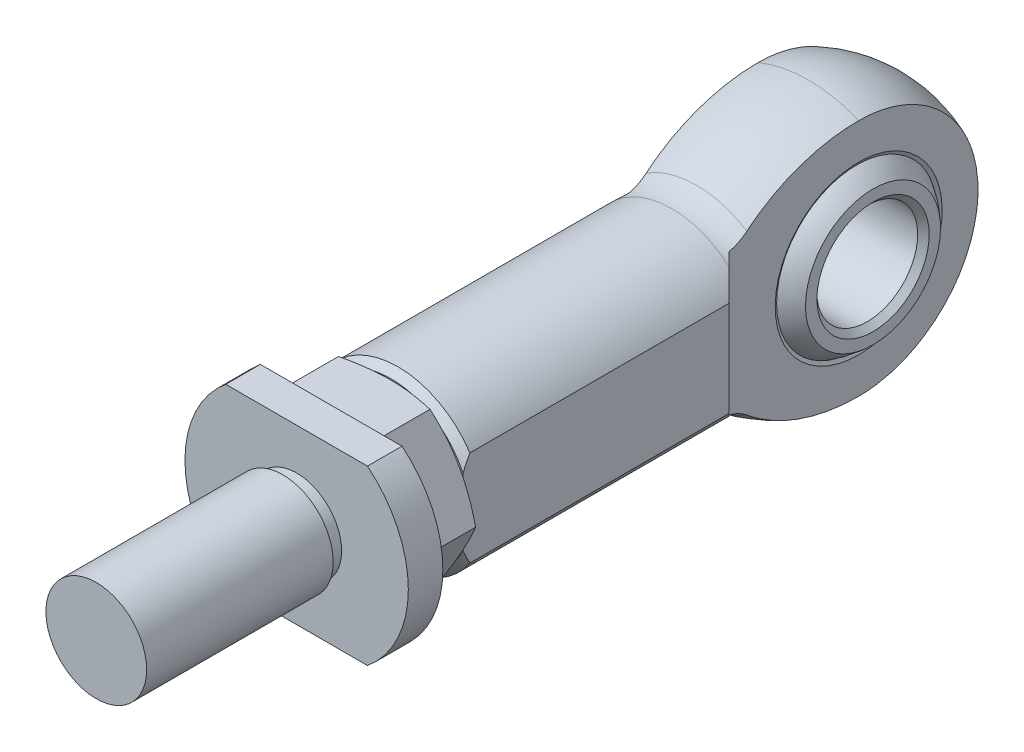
ISO-10303-21;
HEADER;
FILE_DESCRIPTION(('STEP AP214'),'2;1');
FILE_NAME('part.step','',(''),(''),'','','');
FILE_SCHEMA(('AUTOMOTIVE_DESIGN { 1 0 10303 214 1 1 1 1 }'));
ENDSEC;
DATA;
#1=APPLICATION_CONTEXT('core data for automotive mechanical design processes');
#2=APPLICATION_PROTOCOL_DEFINITION('international standard','automotive_design',2000,#1);
#3=PRODUCT_CONTEXT('',#1,'mechanical');
#4=PRODUCT('Part','Part','',(#3));
#5=PRODUCT_RELATED_PRODUCT_CATEGORY('part','',(#4));
#6=PRODUCT_DEFINITION_FORMATION('','',#4);
#7=PRODUCT_DEFINITION_CONTEXT('part definition',#1,'design');
#8=PRODUCT_DEFINITION('design','',#6,#7);
#9=PRODUCT_DEFINITION_SHAPE('','',#8);
#10=(LENGTH_UNIT() NAMED_UNIT(*) SI_UNIT(.MILLI.,.METRE.));
#11=(NAMED_UNIT(*) PLANE_ANGLE_UNIT() SI_UNIT($,.RADIAN.));
#12=(NAMED_UNIT(*) SI_UNIT($,.STERADIAN.) SOLID_ANGLE_UNIT());
#13=UNCERTAINTY_MEASURE_WITH_UNIT(LENGTH_MEASURE(1.E-05),#10,'distance_accuracy_value','');
#14=(GEOMETRIC_REPRESENTATION_CONTEXT(3) GLOBAL_UNCERTAINTY_ASSIGNED_CONTEXT((#13)) GLOBAL_UNIT_ASSIGNED_CONTEXT((#10,
#11,#12)) REPRESENTATION_CONTEXT('',''));
#15=CARTESIAN_POINT('',(0.,0.,0.));
#16=DIRECTION('',(0.,0.,1.));
#17=DIRECTION('',(1.,0.,0.));
#18=AXIS2_PLACEMENT_3D('',#15,#16,#17);
#19=CARTESIAN_POINT('',(0.,0.,-56.4387942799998));
#20=DIRECTION('',(1.,0.,0.));
#21=DIRECTION('',(0.,0.,-1.));
#22=AXIS2_PLACEMENT_3D('',#19,#20,#21);
#23=CYLINDRICAL_SURFACE('',#22,5.55625);
#24=CARTESIAN_POINT('',(-6.50239999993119,0.,-56.4387942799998));
#25=DIRECTION('',(-1.,0.,0.));
#26=DIRECTION('',(0.,0.,1.));
#27=AXIS2_PLACEMENT_3D('',#24,#25,#26);
#28=CIRCLE('',#27,5.55624999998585);
#29=CARTESIAN_POINT('',(-6.50239999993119,0.,-50.882544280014));
#30=VERTEX_POINT('',#29);
#31=EDGE_CURVE('P0_E78',#30,#30,#28,.T.);
#32=ORIENTED_EDGE('',*,*,#31,.T.);
#33=EDGE_LOOP('',(#32));
#34=FACE_BOUND('',#33,.T.);
#35=CARTESIAN_POINT('',(6.50239999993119,0.,-56.4387942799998));
#36=DIRECTION('',(1.,0.,0.));
#37=DIRECTION('',(0.,0.,1.));
#38=AXIS2_PLACEMENT_3D('',#35,#36,#37);
#39=CIRCLE('',#38,5.55624999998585);
#40=CARTESIAN_POINT('',(6.50239999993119,0.,-50.882544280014));
#41=VERTEX_POINT('',#40);
#42=EDGE_CURVE('P0_E76',#41,#41,#39,.T.);
#43=ORIENTED_EDGE('',*,*,#42,.T.);
#44=EDGE_LOOP('',(#43));
#45=FACE_BOUND('',#44,.T.);
#46=ADVANCED_FACE('P0_F15',(#34,#45),#23,.F.);
#47=CARTESIAN_POINT('',(-7.13739999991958,0.,-56.4387942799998));
#48=DIRECTION('',(-1.,0.,0.));
#49=DIRECTION('',(0.,0.,1.));
#50=AXIS2_PLACEMENT_3D('',#47,#48,#49);
#51=CONICAL_SURFACE('',#50,6.19124999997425,0.785398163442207);
#52=ORIENTED_EDGE('',*,*,#31,.F.);
#53=EDGE_LOOP('',(#52));
#54=FACE_BOUND('',#53,.T.);
#55=CARTESIAN_POINT('',(-7.13739999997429,0.,-56.4387942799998));
#56=DIRECTION('',(-1.,0.,0.));
#57=DIRECTION('',(0.,0.,1.));
#58=AXIS2_PLACEMENT_3D('',#55,#56,#57);
#59=CIRCLE('',#58,6.19125000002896);
#60=CARTESIAN_POINT('',(-7.13739999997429,0.,-50.2475442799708));
#61=VERTEX_POINT('',#60);
#62=EDGE_CURVE('P0_E21',#61,#61,#59,.T.);
#63=ORIENTED_EDGE('',*,*,#62,.T.);
#64=EDGE_LOOP('',(#63));
#65=FACE_BOUND('',#64,.T.);
#66=ADVANCED_FACE('P0_F68',(#54,#65),#51,.F.);
#67=CARTESIAN_POINT('',(7.13739999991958,0.,-56.4387942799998));
#68=DIRECTION('',(1.,0.,0.));
#69=DIRECTION('',(0.,0.,-1.));
#70=AXIS2_PLACEMENT_3D('',#67,#68,#69);
#71=CONICAL_SURFACE('',#70,6.19124999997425,0.785398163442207);
#72=ORIENTED_EDGE('',*,*,#42,.F.);
#73=EDGE_LOOP('',(#72));
#74=FACE_BOUND('',#73,.T.);
#75=CARTESIAN_POINT('',(7.13739999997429,0.,-56.4387942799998));
#76=DIRECTION('',(1.,0.,0.));
#77=DIRECTION('',(0.,0.,-1.));
#78=AXIS2_PLACEMENT_3D('',#75,#76,#77);
#79=CIRCLE('',#78,6.19125000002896);
#80=CARTESIAN_POINT('',(7.13739999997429,0.,-62.6300442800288));
#81=VERTEX_POINT('',#80);
#82=EDGE_CURVE('P0_E41',#81,#81,#79,.T.);
#83=ORIENTED_EDGE('',*,*,#82,.T.);
#84=EDGE_LOOP('',(#83));
#85=FACE_BOUND('',#84,.T.);
#86=ADVANCED_FACE('P0_F56',(#74,#85),#71,.F.);
#87=CARTESIAN_POINT('',(-7.1374,0.,-56.4387942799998));
#88=DIRECTION('',(1.,0.,0.));
#89=DIRECTION('',(0.,0.,-1.));
#90=AXIS2_PLACEMENT_3D('',#87,#88,#89);
#91=PLANE('',#90);
#92=CARTESIAN_POINT('',(-7.1374,0.,-63.8821211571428));
#93=CARTESIAN_POINT('',(-7.1374,0.209122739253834,-63.8821226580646));
#94=CARTESIAN_POINT('',(-7.1374,0.418220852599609,-63.8733044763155));
#95=CARTESIAN_POINT('',(-7.1374,0.835000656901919,-63.8380932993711));
#96=CARTESIAN_POINT('',(-7.1374,1.04268196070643,-63.8116956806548));
#97=CARTESIAN_POINT('',(-7.1374,1.45526472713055,-63.7414754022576));
#98=CARTESIAN_POINT('',(-7.1374,1.66016354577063,-63.6976372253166));
#99=CARTESIAN_POINT('',(-7.1374,2.06561280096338,-63.5928292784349));
#100=CARTESIAN_POINT('',(-7.1374,2.26616161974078,-63.5318532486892));
#101=CARTESIAN_POINT('',(-7.1374,2.66123701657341,-63.3932689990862));
#102=CARTESIAN_POINT('',(-7.1374,2.85576854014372,-63.3156748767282));
#103=CARTESIAN_POINT('',(-7.1374,3.23767444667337,-63.1443439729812));
#104=CARTESIAN_POINT('',(-7.13739999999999,3.42504616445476,-63.050601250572));
#105=CARTESIAN_POINT('',(-7.13740000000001,3.79114275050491,-62.8477045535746));
#106=CARTESIAN_POINT('',(-7.13740000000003,3.96987139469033,-62.7385573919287));
#107=CARTESIAN_POINT('',(-7.13739999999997,4.31750265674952,-62.5055946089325));
#108=CARTESIAN_POINT('',(-7.13739999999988,4.48640512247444,-62.3817787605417));
#109=CARTESIAN_POINT('',(-7.13739999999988,4.81319441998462,-62.1203488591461));
#110=CARTESIAN_POINT('',(-7.13739999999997,4.97108031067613,-61.9827336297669));
#111=CARTESIAN_POINT('',(-7.13740000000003,5.27470181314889,-61.6946886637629));
#112=CARTESIAN_POINT('',(-7.1374,5.42043713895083,-61.5442586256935));
#113=CARTESIAN_POINT('',(-7.1374,5.69869699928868,-61.2316790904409));
#114=CARTESIAN_POINT('',(-7.13740000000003,5.8312234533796,-61.0695313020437));
#115=CARTESIAN_POINT('',(-7.13739999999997,6.08219130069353,-60.734591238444));
#116=CARTESIAN_POINT('',(-7.13739999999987,6.20062780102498,-60.56179529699));
#117=CARTESIAN_POINT('',(-7.13739999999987,6.4224783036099,-60.2069054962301));
#118=CARTESIAN_POINT('',(-7.13739999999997,6.52589794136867,-60.0248151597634));
#119=CARTESIAN_POINT('',(-7.13740000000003,6.71706815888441,-59.6525019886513));
#120=CARTESIAN_POINT('',(-7.1374,6.80481293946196,-59.4622761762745));
#121=CARTESIAN_POINT('',(-7.1374,6.96394696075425,-59.0751454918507));
#122=CARTESIAN_POINT('',(-7.13740000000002,7.03533937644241,-58.8782419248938));
#123=CARTESIAN_POINT('',(-7.13739999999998,7.16128395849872,-58.4791173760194));
#124=CARTESIAN_POINT('',(-7.13739999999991,7.21583586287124,-58.2768963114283));
#125=CARTESIAN_POINT('',(-7.13739999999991,7.30770926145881,-57.8685810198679));
#126=CARTESIAN_POINT('',(-7.13739999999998,7.34503105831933,-57.6624868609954));
#127=CARTESIAN_POINT('',(-7.13740000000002,7.40218099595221,-57.2478822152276));
#128=CARTESIAN_POINT('',(-7.13740000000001,7.42200872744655,-57.0393716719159));
#129=CARTESIAN_POINT('',(-7.13739999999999,7.44402603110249,-56.6214605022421));
#130=CARTESIAN_POINT('',(-7.1374,7.44621889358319,-56.4120600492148));
#131=CARTESIAN_POINT('',(-7.1374,7.43295720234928,-55.9937460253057));
#132=CARTESIAN_POINT('',(-7.1374,7.41749653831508,-55.7848326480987));
#133=CARTESIAN_POINT('',(-7.1374,7.36903650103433,-55.3691258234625));
#134=CARTESIAN_POINT('',(-7.1374,7.33604339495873,-55.1623316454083));
#135=CARTESIAN_POINT('',(-7.1374,7.25274141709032,-54.7521811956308));
#136=CARTESIAN_POINT('',(-7.1374,7.20242615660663,-54.5488262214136));
#137=CARTESIAN_POINT('',(-7.1374,7.08485157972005,-54.1471173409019));
#138=CARTESIAN_POINT('',(-7.1374,7.01759550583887,-53.9487624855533));
#139=CARTESIAN_POINT('',(-7.1374,6.86661151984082,-53.5584205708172));
#140=CARTESIAN_POINT('',(-7.1374,6.78288335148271,-53.3664336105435));
#141=CARTESIAN_POINT('',(-7.1374,6.59955283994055,-52.9901993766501));
#142=CARTESIAN_POINT('',(-7.1374,6.49995081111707,-52.8059519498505));
#143=CARTESIAN_POINT('',(-7.1374,6.28557730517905,-52.4464985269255));
#144=CARTESIAN_POINT('',(-7.1374,6.17080547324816,-52.2712927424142));
#145=CARTESIAN_POINT('',(-7.1374,5.92693148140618,-51.931203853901));
#146=CARTESIAN_POINT('',(-7.1374,5.79783197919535,-51.7663188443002));
#147=CARTESIAN_POINT('',(-7.1374,5.5261605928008,-51.4479549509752));
#148=CARTESIAN_POINT('',(-7.1374,5.38358405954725,-51.2944800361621));
#149=CARTESIAN_POINT('',(-7.1374,5.0860455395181,-51.0001355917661));
#150=CARTESIAN_POINT('',(-7.1374,4.93108799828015,-50.8592615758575));
#151=CARTESIAN_POINT('',(-7.1374,4.60985257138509,-50.5910388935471));
#152=CARTESIAN_POINT('',(-7.1374,4.44357052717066,-50.46369524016));
#153=CARTESIAN_POINT('',(-7.1374,3.92958368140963,-50.1034898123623));
#154=CARTESIAN_POINT('',(-7.1374,3.56641448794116,-49.8921339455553));
#155=CARTESIAN_POINT('',(-7.1374,2.80993865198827,-49.5335186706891));
#156=CARTESIAN_POINT('',(-7.1374,2.41663201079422,-49.3862592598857));
#157=CARTESIAN_POINT('',(-7.1374,1.61083062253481,-49.1598253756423));
#158=CARTESIAN_POINT('',(-7.1374,1.19833587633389,-49.0806508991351));
#159=CARTESIAN_POINT('',(-7.1374,0.365908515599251,-48.9926950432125));
#160=CARTESIAN_POINT('',(-7.1374,-0.0540240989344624,-48.9839136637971));
#161=CARTESIAN_POINT('',(-7.1374,-0.88935404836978,-49.0369424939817));
#162=CARTESIAN_POINT('',(-7.1374,-1.30475138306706,-49.0987527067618));
#163=CARTESIAN_POINT('',(-7.1374,-2.1194696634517,-49.2913526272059));
#164=CARTESIAN_POINT('',(-7.1374,-2.51879060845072,-49.4221423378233));
#165=CARTESIAN_POINT('',(-7.1374,-3.0967069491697,-49.6669752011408));
#166=CARTESIAN_POINT('',(-7.1374,-3.28593071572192,-49.7567554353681));
#167=CARTESIAN_POINT('',(-7.1374,-3.65612851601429,-49.9519199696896));
#168=CARTESIAN_POINT('',(-7.1374,-3.83710556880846,-50.0572984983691));
#169=CARTESIAN_POINT('',(-7.1374,-4.18958894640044,-50.2829603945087));
#170=CARTESIAN_POINT('',(-7.1374,-4.36109186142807,-50.4032490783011));
#171=CARTESIAN_POINT('',(-7.1374,-4.69329914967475,-50.6578060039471));
#172=CARTESIAN_POINT('',(-7.1374,-4.85400723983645,-50.7920693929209));
#173=CARTESIAN_POINT('',(-7.1374,-5.16357128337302,-51.073680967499));
#174=CARTESIAN_POINT('',(-7.1374,-5.31242503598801,-51.2210315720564));
#175=CARTESIAN_POINT('',(-7.1374,-5.5971870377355,-51.5277453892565));
#176=CARTESIAN_POINT('',(-7.1374,-5.73309558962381,-51.6871083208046));
#177=CARTESIAN_POINT('',(-7.1374,-5.9910071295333,-52.0167200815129));
#178=CARTESIAN_POINT('',(-7.1374,-6.11300984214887,-52.1869691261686));
#179=CARTESIAN_POINT('',(-7.1374,-6.34223751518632,-52.5371371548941));
#180=CARTESIAN_POINT('',(-7.1374,-6.44946270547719,-52.7170559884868));
#181=CARTESIAN_POINT('',(-7.1374,-6.6483943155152,-53.0853222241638));
#182=CARTESIAN_POINT('',(-7.1374,-6.74009776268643,-53.2736712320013));
#183=CARTESIAN_POINT('',(-7.1374,-6.90727780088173,-53.6573552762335));
#184=CARTESIAN_POINT('',(-7.1374,-6.982760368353,-53.8526877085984));
#185=CARTESIAN_POINT('',(-7.1374,-7.11702908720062,-54.2490870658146));
#186=CARTESIAN_POINT('',(-7.1374,-7.17580926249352,-54.4501560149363));
#187=CARTESIAN_POINT('',(-7.1374,-7.27620177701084,-54.856461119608));
#188=CARTESIAN_POINT('',(-7.1374,-7.31782005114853,-55.061695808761));
#189=CARTESIAN_POINT('',(-7.1374,-7.38362842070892,-55.4749799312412));
#190=CARTESIAN_POINT('',(-7.1374,-7.40781526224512,-55.6830298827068));
#191=CARTESIAN_POINT('',(-7.1374,-7.43857577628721,-56.1004228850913));
#192=CARTESIAN_POINT('',(-7.1374,-7.44514986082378,-56.3097659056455));
#193=CARTESIAN_POINT('',(-7.1374,-7.44063927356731,-56.7282653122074));
#194=CARTESIAN_POINT('',(-7.1374,-7.42955429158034,-56.9374216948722));
#195=CARTESIAN_POINT('',(-7.1374,-7.38980411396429,-57.3540538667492));
#196=CARTESIAN_POINT('',(-7.1374,-7.36113919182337,-57.5615296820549));
#197=CARTESIAN_POINT('',(-7.1374,-7.28642587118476,-57.9733691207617));
#198=CARTESIAN_POINT('',(-7.1374,-7.24037409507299,-58.1777321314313));
#199=CARTESIAN_POINT('',(-7.1374,-7.1312352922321,-58.581776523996));
#200=CARTESIAN_POINT('',(-7.1374,-7.06815455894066,-58.7814596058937));
#201=CARTESIAN_POINT('',(-7.1374,-6.92537164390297,-59.1748772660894));
#202=CARTESIAN_POINT('',(-7.1374,-6.84566321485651,-59.3686095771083));
#203=CARTESIAN_POINT('',(-7.1374,-6.67023662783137,-59.7486032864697));
#204=CARTESIAN_POINT('',(-7.1374,-6.57452402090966,-59.9348672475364));
#205=CARTESIAN_POINT('',(-7.1374,-6.36773495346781,-60.2986979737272));
#206=CARTESIAN_POINT('',(-7.1374,-6.25665625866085,-60.4762634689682));
#207=CARTESIAN_POINT('',(-7.1374,-6.0199381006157,-60.8214017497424));
#208=CARTESIAN_POINT('',(-7.1374,-5.89429898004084,-60.9889747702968));
#209=CARTESIAN_POINT('',(-7.1374,-5.62936232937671,-61.3129275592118));
#210=CARTESIAN_POINT('',(-7.1374,-5.49006596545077,-61.4693082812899));
#211=CARTESIAN_POINT('',(-7.1374,-5.19879823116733,-61.7697783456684));
#212=CARTESIAN_POINT('',(-7.1374,-5.04682705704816,-61.9138678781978));
#213=CARTESIAN_POINT('',(-7.1374,-4.73121822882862,-62.1887948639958));
#214=CARTESIAN_POINT('',(-7.1374,-4.56757545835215,-62.3196264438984));
#215=CARTESIAN_POINT('',(-7.1374,-4.22990946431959,-62.5669886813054));
#216=CARTESIAN_POINT('',(-7.1374,-4.05589008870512,-62.6835245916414));
#217=CARTESIAN_POINT('',(-7.1374,-3.69850167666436,-62.9016155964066));
#218=CARTESIAN_POINT('',(-7.1374,-3.51512485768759,-63.003157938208));
#219=CARTESIAN_POINT('',(-7.1374,-3.14053273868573,-63.1903865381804));
#220=CARTESIAN_POINT('',(-7.1374,-2.94932032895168,-63.2760785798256));
#221=CARTESIAN_POINT('',(-7.1374,-2.5605237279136,-63.4309741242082));
#222=CARTESIAN_POINT('',(-7.1374,-2.3629453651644,-63.5001922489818));
#223=CARTESIAN_POINT('',(-7.1374,-1.96272783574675,-63.621728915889));
#224=CARTESIAN_POINT('',(-7.1374,-1.76009001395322,-63.6740518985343));
#225=CARTESIAN_POINT('',(-7.1374,-1.30018767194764,-63.7723340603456));
#226=CARTESIAN_POINT('',(-7.1374,-1.0418781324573,-63.8134692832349));
#227=CARTESIAN_POINT('',(-7.1374,-0.522366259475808,-63.8683618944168));
#228=CARTESIAN_POINT('',(-7.1374,-0.261163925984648,-63.8821192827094));
#229=CARTESIAN_POINT('',(-7.1374,0.,-63.8821211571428));
#230=B_SPLINE_CURVE_WITH_KNOTS('',3,(#92,#93,#94,#95,#96,#97,#98,#99,#100,#101,#102,#103,#104,
#105,#106,#107,#108,#109,#110,#111,#112,#113,#114,#115,#116,#117,#118,#119,#120,#121,#122,#123,
#124,#125,#126,#127,#128,#129,#130,#131,#132,#133,#134,#135,#136,#137,#138,#139,#140,#141,#142,
#143,#144,#145,#146,#147,#148,#149,#150,#151,#152,#153,#154,#155,#156,#157,#158,#159,#160,#161,
#162,#163,#164,#165,#166,#167,#168,#169,#170,#171,#172,#173,#174,#175,#176,#177,#178,#179,#180,
#181,#182,#183,#184,#185,#186,#187,#188,#189,#190,#191,#192,#193,#194,#195,#196,#197,#198,#199,
#200,#201,#202,#203,#204,#205,#206,#207,#208,#209,#210,#211,#212,#213,#214,#215,#216,#217,#218,
#219,#220,#221,#222,#223,#224,#225,#226,#227,#228,#229),.UNSPECIFIED.,.T.,.F.,(4,2,2,2,2,2,2,2,
2,2,2,2,2,2,2,2,2,2,2,2,2,2,2,2,2,2,2,2,2,2,2,2,2,2,2,2,2,2,2,2,2,2,2,2,2,2,2,2,2,2,2,2,2,2,2,2,
2,2,2,2,2,2,2,2,2,2,2,2,4),(0.,0.627140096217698,1.25444520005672,1.88230968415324,
2.51040380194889,3.13796718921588,3.76576195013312,4.39327992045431,5.02080760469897,
5.64838883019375,6.27598482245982,6.90348947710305,7.53121140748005,8.15869715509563,
8.78641457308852,9.41401001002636,10.0416152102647,10.6692093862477,11.2968182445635,
11.9243100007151,12.5520190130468,13.1795037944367,13.8072202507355,14.4348166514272,
15.0624228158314,15.6900165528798,16.317624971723,16.9451171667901,17.5728266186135,
18.2003116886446,18.8280284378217,20.0821144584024,21.3362004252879,22.5902863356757,
23.8443722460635,25.0984582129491,26.3525442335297,26.9802609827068,27.607746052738,
28.2354555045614,28.8629476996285,29.4905561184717,30.11814985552,30.7457560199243,
31.373352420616,32.0010688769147,32.6285536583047,33.2562626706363,33.8837544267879,
34.5113632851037,35.1389574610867,35.766562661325,36.3941580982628,37.0218755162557,
37.6493612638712,38.2770831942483,38.9045878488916,39.5321838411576,40.1597650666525,
40.7872927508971,41.4148107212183,42.0426054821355,42.6701688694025,43.2982629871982,
43.9261274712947,44.5534325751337,45.1805726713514,45.9637795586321,46.7469864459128),.UNSPECIFIED.);
#231=CARTESIAN_POINT('',(-7.1374,0.,-63.8821211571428));
#232=VERTEX_POINT('',#231);
#233=EDGE_CURVE('P0_E26',#232,#232,#230,.T.);
#234=ORIENTED_EDGE('',*,*,#233,.F.);
#235=EDGE_LOOP('',(#234));
#236=FACE_BOUND('',#235,.T.);
#237=ORIENTED_EDGE('',*,*,#62,.F.);
#238=EDGE_LOOP('',(#237));
#239=FACE_BOUND('',#238,.T.);
#240=ADVANCED_FACE('P0_F52',(#236,#239),#91,.F.);
#241=CARTESIAN_POINT('',(7.1374,0.,-56.4387942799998));
#242=DIRECTION('',(-1.,0.,0.));
#243=DIRECTION('',(0.,0.,1.));
#244=AXIS2_PLACEMENT_3D('',#241,#242,#243);
#245=PLANE('',#244);
#246=CARTESIAN_POINT('',(7.1374,0.,-48.9954674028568));
#247=CARTESIAN_POINT('',(7.13739999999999,0.209122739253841,-48.995465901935));
#248=CARTESIAN_POINT('',(7.1374,0.418220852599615,-49.004284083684));
#249=CARTESIAN_POINT('',(7.1374,0.835000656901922,-49.0394952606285));
#250=CARTESIAN_POINT('',(7.1374,1.04268196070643,-49.0658928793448));
#251=CARTESIAN_POINT('',(7.1374,1.45526472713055,-49.136113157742));
#252=CARTESIAN_POINT('',(7.1374,1.66016354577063,-49.179951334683));
#253=CARTESIAN_POINT('',(7.1374,2.06561280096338,-49.2847592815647));
#254=CARTESIAN_POINT('',(7.1374,2.26616161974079,-49.3457353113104));
#255=CARTESIAN_POINT('',(7.1374,2.66123701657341,-49.4843195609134));
#256=CARTESIAN_POINT('',(7.1374,2.85576854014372,-49.5619136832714));
#257=CARTESIAN_POINT('',(7.1374,3.23767444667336,-49.7332445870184));
#258=CARTESIAN_POINT('',(7.1374,3.42504616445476,-49.8269873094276));
#259=CARTESIAN_POINT('',(7.1374,3.79114275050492,-50.0298840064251));
#260=CARTESIAN_POINT('',(7.1374,3.96987139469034,-50.1390311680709));
#261=CARTESIAN_POINT('',(7.1374,4.31750265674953,-50.3719939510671));
#262=CARTESIAN_POINT('',(7.1374,4.48640512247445,-50.4958097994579));
#263=CARTESIAN_POINT('',(7.1374,4.81319441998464,-50.7572397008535));
#264=CARTESIAN_POINT('',(7.1374,4.97108031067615,-50.8948549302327));
#265=CARTESIAN_POINT('',(7.1374,5.27470181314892,-51.1828998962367));
#266=CARTESIAN_POINT('',(7.1374,5.42043713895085,-51.3333299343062));
#267=CARTESIAN_POINT('',(7.1374,5.69869699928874,-51.6459094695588));
#268=CARTESIAN_POINT('',(7.1374,5.83122345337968,-51.808057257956));
#269=CARTESIAN_POINT('',(7.1374,6.08219130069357,-52.1429973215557));
#270=CARTESIAN_POINT('',(7.1374,6.20062780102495,-52.3157932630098));
#271=CARTESIAN_POINT('',(7.1374,6.42247830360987,-52.6706830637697));
#272=CARTESIAN_POINT('',(7.1374,6.5258979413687,-52.8527734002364));
#273=CARTESIAN_POINT('',(7.1374,6.71706815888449,-53.2250865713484));
#274=CARTESIAN_POINT('',(7.1374,6.80481293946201,-53.4153123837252));
#275=CARTESIAN_POINT('',(7.1374,6.96394696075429,-53.8024430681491));
#276=CARTESIAN_POINT('',(7.1374,7.03533937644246,-53.9993466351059));
#277=CARTESIAN_POINT('',(7.1374,7.16128395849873,-54.3984711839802));
#278=CARTESIAN_POINT('',(7.1374,7.21583586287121,-54.6006922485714));
#279=CARTESIAN_POINT('',(7.1374,7.30770926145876,-55.0090075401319));
#280=CARTESIAN_POINT('',(7.1374,7.34503105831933,-55.2151016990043));
#281=CARTESIAN_POINT('',(7.1374,7.40218099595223,-55.6297063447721));
#282=CARTESIAN_POINT('',(7.1374,7.42200872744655,-55.8382168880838));
#283=CARTESIAN_POINT('',(7.1374,7.44402603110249,-56.2561280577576));
#284=CARTESIAN_POINT('',(7.1374,7.44621889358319,-56.4655285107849));
#285=CARTESIAN_POINT('',(7.1374,7.43295720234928,-56.883842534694));
#286=CARTESIAN_POINT('',(7.1374,7.41749653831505,-57.092755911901));
#287=CARTESIAN_POINT('',(7.1374,7.3690365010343,-57.5084627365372));
#288=CARTESIAN_POINT('',(7.1374,7.33604339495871,-57.7152569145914));
#289=CARTESIAN_POINT('',(7.1374,7.25274141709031,-58.1254073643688));
#290=CARTESIAN_POINT('',(7.1374,7.20242615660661,-58.3287623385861));
#291=CARTESIAN_POINT('',(7.1374,7.08485157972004,-58.7304712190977));
#292=CARTESIAN_POINT('',(7.1374,7.01759550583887,-58.9288260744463));
#293=CARTESIAN_POINT('',(7.1374,6.86661151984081,-59.3191679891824));
#294=CARTESIAN_POINT('',(7.1374,6.78288335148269,-59.5111549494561));
#295=CARTESIAN_POINT('',(7.1374,6.59955283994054,-59.8873891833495));
#296=CARTESIAN_POINT('',(7.1374,6.49995081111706,-60.0716366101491));
#297=CARTESIAN_POINT('',(7.1374,6.28557730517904,-60.4310900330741));
#298=CARTESIAN_POINT('',(7.1374,6.17080547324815,-60.6062958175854));
#299=CARTESIAN_POINT('',(7.1374,5.92693148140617,-60.9463847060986));
#300=CARTESIAN_POINT('',(7.1374,5.79783197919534,-61.1112697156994));
#301=CARTESIAN_POINT('',(7.1374,5.52616059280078,-61.4296336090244));
#302=CARTESIAN_POINT('',(7.1374,5.38358405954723,-61.5831085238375));
#303=CARTESIAN_POINT('',(7.1374,5.08604553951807,-61.8774529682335));
#304=CARTESIAN_POINT('',(7.1374,4.93108799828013,-62.0183269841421));
#305=CARTESIAN_POINT('',(7.1374,4.60985257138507,-62.2865496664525));
#306=CARTESIAN_POINT('',(7.1374,4.44357052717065,-62.4138933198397));
#307=CARTESIAN_POINT('',(7.1374,3.92958368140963,-62.7740987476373));
#308=CARTESIAN_POINT('',(7.1374,3.56641448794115,-62.9854546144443));
#309=CARTESIAN_POINT('',(7.1374,2.80993865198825,-63.3440698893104));
#310=CARTESIAN_POINT('',(7.1374,2.41663201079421,-63.4913293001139));
#311=CARTESIAN_POINT('',(7.1374,1.6108306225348,-63.7177631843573));
#312=CARTESIAN_POINT('',(7.1374,1.19833587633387,-63.7969376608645));
#313=CARTESIAN_POINT('',(7.1374,0.365908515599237,-63.8848935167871));
#314=CARTESIAN_POINT('',(7.1374,-0.0540240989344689,-63.8936748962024));
#315=CARTESIAN_POINT('',(7.1374,-0.889354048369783,-63.8406460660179));
#316=CARTESIAN_POINT('',(7.1374,-1.30475138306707,-63.7788358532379));
#317=CARTESIAN_POINT('',(7.1374,-2.11946966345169,-63.5862359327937));
#318=CARTESIAN_POINT('',(7.1374,-2.51879060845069,-63.4554462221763));
#319=CARTESIAN_POINT('',(7.1374,-3.09670694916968,-63.2106133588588));
#320=CARTESIAN_POINT('',(7.1374,-3.28593071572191,-63.1208331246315));
#321=CARTESIAN_POINT('',(7.1374,-3.65612851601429,-62.92566859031));
#322=CARTESIAN_POINT('',(7.1374,-3.83710556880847,-62.8202900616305));
#323=CARTESIAN_POINT('',(7.1374,-4.18958894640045,-62.594628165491));
#324=CARTESIAN_POINT('',(7.1374,-4.36109186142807,-62.4743394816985));
#325=CARTESIAN_POINT('',(7.1374,-4.69329914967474,-62.2197825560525));
#326=CARTESIAN_POINT('',(7.1374,-4.85400723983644,-62.0855191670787));
#327=CARTESIAN_POINT('',(7.1374,-5.16357128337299,-61.8039075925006));
#328=CARTESIAN_POINT('',(7.1374,-5.31242503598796,-61.6565569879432));
#329=CARTESIAN_POINT('',(7.1374,-5.59718703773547,-61.3498431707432));
#330=CARTESIAN_POINT('',(7.1374,-5.73309558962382,-61.1904802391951));
#331=CARTESIAN_POINT('',(7.1374,-5.99100712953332,-60.8608684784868));
#332=CARTESIAN_POINT('',(7.1374,-6.11300984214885,-60.6906194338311));
#333=CARTESIAN_POINT('',(7.1374,-6.34223751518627,-60.3404514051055));
#334=CARTESIAN_POINT('',(7.1374,-6.44946270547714,-60.1605325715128));
#335=CARTESIAN_POINT('',(7.1374,-6.64839431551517,-59.7922663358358));
#336=CARTESIAN_POINT('',(7.1374,-6.7400977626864,-59.6039173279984));
#337=CARTESIAN_POINT('',(7.1374,-6.90727780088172,-59.2202332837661));
#338=CARTESIAN_POINT('',(7.1374,-6.98276036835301,-59.0249008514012));
#339=CARTESIAN_POINT('',(7.1374,-7.11702908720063,-58.628501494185));
#340=CARTESIAN_POINT('',(7.1374,-7.17580926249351,-58.4274325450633));
#341=CARTESIAN_POINT('',(7.1374,-7.27620177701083,-58.0211274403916));
#342=CARTESIAN_POINT('',(7.1374,-7.31782005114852,-57.8158927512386));
#343=CARTESIAN_POINT('',(7.1374,-7.38362842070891,-57.4026086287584));
#344=CARTESIAN_POINT('',(7.1374,-7.40781526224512,-57.1945586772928));
#345=CARTESIAN_POINT('',(7.1374,-7.4385757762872,-56.7771656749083));
#346=CARTESIAN_POINT('',(7.1374,-7.44514986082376,-56.5678226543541));
#347=CARTESIAN_POINT('',(7.1374,-7.44063927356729,-56.1493232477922));
#348=CARTESIAN_POINT('',(7.1374,-7.42955429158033,-55.9401668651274));
#349=CARTESIAN_POINT('',(7.1374,-7.38980411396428,-55.5235346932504));
#350=CARTESIAN_POINT('',(7.1374,-7.36113919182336,-55.3160588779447));
#351=CARTESIAN_POINT('',(7.1374,-7.28642587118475,-54.9042194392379));
#352=CARTESIAN_POINT('',(7.1374,-7.24037409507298,-54.6998564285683));
#353=CARTESIAN_POINT('',(7.1374,-7.13123529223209,-54.2958120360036));
#354=CARTESIAN_POINT('',(7.1374,-7.06815455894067,-54.0961289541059));
#355=CARTESIAN_POINT('',(7.1374,-6.92537164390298,-53.7027112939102));
#356=CARTESIAN_POINT('',(7.1374,-6.8456632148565,-53.5089789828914));
#357=CARTESIAN_POINT('',(7.1374,-6.67023662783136,-53.1289852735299));
#358=CARTESIAN_POINT('',(7.13739999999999,-6.57452402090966,-52.9427213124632));
#359=CARTESIAN_POINT('',(7.13740000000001,-6.36773495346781,-52.5788905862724));
#360=CARTESIAN_POINT('',(7.13740000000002,-6.25665625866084,-52.4013250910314));
#361=CARTESIAN_POINT('',(7.13739999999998,-6.01993810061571,-52.0561868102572));
#362=CARTESIAN_POINT('',(7.13739999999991,-5.89429898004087,-51.8886137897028));
#363=CARTESIAN_POINT('',(7.13739999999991,-5.62936232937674,-51.5646610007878));
#364=CARTESIAN_POINT('',(7.13739999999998,-5.49006596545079,-51.4082802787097));
#365=CARTESIAN_POINT('',(7.13740000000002,-5.19879823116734,-51.1078102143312));
#366=CARTESIAN_POINT('',(7.1374,-5.04682705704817,-50.9637206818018));
#367=CARTESIAN_POINT('',(7.1374,-4.73121822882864,-50.6887936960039));
#368=CARTESIAN_POINT('',(7.13740000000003,-4.56757545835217,-50.5579621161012));
#369=CARTESIAN_POINT('',(7.13739999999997,-4.22990946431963,-50.3105998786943));
#370=CARTESIAN_POINT('',(7.13739999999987,-4.05589008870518,-50.1940639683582));
#371=CARTESIAN_POINT('',(7.13739999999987,-3.69850167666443,-49.975972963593));
#372=CARTESIAN_POINT('',(7.13739999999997,-3.51512485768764,-49.8744306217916));
#373=CARTESIAN_POINT('',(7.13740000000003,-3.14053273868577,-49.6872020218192));
#374=CARTESIAN_POINT('',(7.1374,-2.94932032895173,-49.6015099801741));
#375=CARTESIAN_POINT('',(7.1374,-2.56052372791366,-49.4466144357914));
#376=CARTESIAN_POINT('',(7.13740000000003,-2.36294536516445,-49.3773963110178));
#377=CARTESIAN_POINT('',(7.13739999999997,-1.9627278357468,-49.2558596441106));
#378=CARTESIAN_POINT('',(7.13739999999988,-1.76009001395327,-49.2035366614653));
#379=CARTESIAN_POINT('',(7.13739999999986,-1.30018767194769,-49.105254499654));
#380=CARTESIAN_POINT('',(7.13739999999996,-1.04187813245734,-49.0641192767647));
#381=CARTESIAN_POINT('',(7.13740000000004,-0.522366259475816,-49.0092266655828));
#382=CARTESIAN_POINT('',(7.13740000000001,-0.261163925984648,-48.9954692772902));
#383=CARTESIAN_POINT('',(7.1374,0.,-48.9954674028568));
#384=B_SPLINE_CURVE_WITH_KNOTS('',3,(#246,#247,#248,#249,#250,#251,#252,#253,#254,#255,#256,
#257,#258,#259,#260,#261,#262,#263,#264,#265,#266,#267,#268,#269,#270,#271,#272,#273,#274,#275,
#276,#277,#278,#279,#280,#281,#282,#283,#284,#285,#286,#287,#288,#289,#290,#291,#292,#293,#294,
#295,#296,#297,#298,#299,#300,#301,#302,#303,#304,#305,#306,#307,#308,#309,#310,#311,#312,#313,
#314,#315,#316,#317,#318,#319,#320,#321,#322,#323,#324,#325,#326,#327,#328,#329,#330,#331,#332,
#333,#334,#335,#336,#337,#338,#339,#340,#341,#342,#343,#344,#345,#346,#347,#348,#349,#350,#351,
#352,#353,#354,#355,#356,#357,#358,#359,#360,#361,#362,#363,#364,#365,#366,#367,#368,#369,#370,
#371,#372,#373,#374,#375,#376,#377,#378,#379,#380,#381,#382,#383),.UNSPECIFIED.,.T.,.F.,(4,2,2,
2,2,2,2,2,2,2,2,2,2,2,2,2,2,2,2,2,2,2,2,2,2,2,2,2,2,2,2,2,2,2,2,2,2,2,2,2,2,2,2,2,2,2,2,2,2,2,2,
2,2,2,2,2,2,2,2,2,2,2,2,2,2,2,2,2,4),(0.,0.627140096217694,1.25444520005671,1.88230968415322,
2.51040380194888,3.13796718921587,3.76576195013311,4.39327992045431,5.02080760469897,
5.64838883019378,6.27598482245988,6.90348947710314,7.53121140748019,8.15869715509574,
8.78641457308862,9.41401001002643,10.0416152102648,10.6692093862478,11.2968182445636,
11.9243100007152,12.5520190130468,13.1795037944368,13.8072202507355,14.4348166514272,
15.0624228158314,15.6900165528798,16.317624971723,16.94511716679,17.5728266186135,
18.2003116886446,18.8280284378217,20.0821144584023,21.3362004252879,22.5902863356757,
23.8443722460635,25.098458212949,26.3525442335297,26.9802609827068,27.607746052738,
28.2354555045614,28.8629476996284,29.4905561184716,30.1181498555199,30.7457560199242,
31.3733524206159,32.0010688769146,32.6285536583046,33.2562626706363,33.8837544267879,
34.5113632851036,35.1389574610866,35.766562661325,36.3941580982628,37.0218755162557,
37.6493612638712,38.2770831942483,38.9045878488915,39.5321838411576,40.1597650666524,
40.7872927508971,41.4148107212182,42.0426054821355,42.6701688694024,43.2982629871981,
43.9261274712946,44.5534325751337,45.1805726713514,45.9637795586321,46.7469864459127),.UNSPECIFIED.);
#385=CARTESIAN_POINT('',(7.1374,0.,-48.9954674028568));
#386=VERTEX_POINT('',#385);
#387=EDGE_CURVE('P0_E10',#386,#386,#384,.T.);
#388=ORIENTED_EDGE('',*,*,#387,.F.);
#389=EDGE_LOOP('',(#388));
#390=FACE_BOUND('',#389,.T.);
#391=ORIENTED_EDGE('',*,*,#82,.F.);
#392=EDGE_LOOP('',(#391));
#393=FACE_BOUND('',#392,.T.);
#394=ADVANCED_FACE('P0_F35',(#390,#393),#245,.F.);
#395=CARTESIAN_POINT('',(0.,0.,-56.4387942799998));
#396=DIRECTION('',(0.632794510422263,0.481530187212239,-0.606382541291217));
#397=DIRECTION('',(0.572409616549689,-0.818287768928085,-0.0524629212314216));
#398=AXIS2_PLACEMENT_3D('',#395,#396,#397);
#399=SPHERICAL_SURFACE('',#398,10.3124);
#400=CARTESIAN_POINT('',(-6.52563010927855,-4.96573190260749,-50.1855349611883));
#401=VERTEX_POINT('',#400);
#402=VERTEX_LOOP('',#401);
#403=FACE_BOUND('',#402,.T.);
#404=CARTESIAN_POINT('',(6.52563010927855,4.96573190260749,-62.6920535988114));
#405=VERTEX_POINT('',#404);
#406=VERTEX_LOOP('',#405);
#407=FACE_BOUND('',#406,.T.);
#408=ORIENTED_EDGE('',*,*,#387,.T.);
#409=EDGE_LOOP('',(#408));
#410=FACE_BOUND('',#409,.T.);
#411=ORIENTED_EDGE('',*,*,#233,.T.);
#412=EDGE_LOOP('',(#411));
#413=FACE_BOUND('',#412,.T.);
#414=ADVANCED_FACE('P0_F17',(#403,#407,#410,#413),#399,.T.);
#415=CLOSED_SHELL('',(#46,#66,#86,#240,#394,#414));
#416=MANIFOLD_SOLID_BREP('P0_B1',#415);
#417=CARTESIAN_POINT('',(0.,0.,-56.9467942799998));
#418=DIRECTION('',(0.,-1.,0.));
#419=DIRECTION('',(0.,0.,-1.));
#420=AXIS2_PLACEMENT_3D('',#417,#418,#419);
#421=CIRCLE('',#420,9.88802179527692);
#422=TRIMMED_CURVE('',#421,(PARAMETER_VALUE(-1.62219424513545)),
(PARAMETER_VALUE(1.62219424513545)),.T.,.PARAMETER.);
#423=CARTESIAN_POINT('',(0.,0.,-56.4387942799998));
#424=DIRECTION('',(-1.,0.,0.));
#425=AXIS1_PLACEMENT('',#423,#424);
#426=SURFACE_OF_REVOLUTION('',#422,#425);
#427=CARTESIAN_POINT('',(-5.33427876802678,0.,-56.4387942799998));
#428=DIRECTION('',(-1.,0.,0.));
#429=DIRECTION('',(0.,0.,1.));
#430=AXIS2_PLACEMENT_3D('',#427,#428,#429);
#431=CIRCLE('',#430,8.8337699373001);
#432=CARTESIAN_POINT('',(-5.33427876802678,0.,-47.6050243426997));
#433=VERTEX_POINT('',#432);
#434=EDGE_CURVE('P1_E589',#433,#433,#431,.T.);
#435=ORIENTED_EDGE('',*,*,#434,.T.);
#436=EDGE_LOOP('',(#435));
#437=FACE_BOUND('',#436,.T.);
#438=CARTESIAN_POINT('',(5.33427876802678,0.,-56.4387942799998));
#439=DIRECTION('',(1.,0.,0.));
#440=DIRECTION('',(0.,0.,1.));
#441=AXIS2_PLACEMENT_3D('',#438,#439,#440);
#442=CIRCLE('',#441,8.8337699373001);
#443=CARTESIAN_POINT('',(5.33427876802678,0.,-47.6050243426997));
#444=VERTEX_POINT('',#443);
#445=EDGE_CURVE('P1_E586',#444,#444,#442,.T.);
#446=ORIENTED_EDGE('',*,*,#445,.T.);
#447=EDGE_LOOP('',(#446));
#448=FACE_BOUND('',#447,.T.);
#449=ADVANCED_FACE('P1_F16',(#437,#448),#426,.T.);
#450=CARTESIAN_POINT('',(5.5499,0.,-56.4387942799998));
#451=DIRECTION('',(1.,0.,0.));
#452=DIRECTION('',(0.,-1.,0.));
#453=AXIS2_PLACEMENT_3D('',#450,#451,#452);
#454=CONICAL_SURFACE('',#453,9.20723686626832,1.0471975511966);
#455=CARTESIAN_POINT('',(5.5499,0.,-56.4387942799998));
#456=DIRECTION('',(1.,0.,0.));
#457=DIRECTION('',(0.,-1.,0.));
#458=AXIS2_PLACEMENT_3D('',#455,#456,#457);
#459=CIRCLE('',#458,9.20723686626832);
#460=CARTESIAN_POINT('',(5.5499,-9.20723686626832,-56.4387942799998));
#461=VERTEX_POINT('',#460);
#462=EDGE_CURVE('P1_E590',#461,#461,#459,.F.);
#463=ORIENTED_EDGE('',*,*,#462,.F.);
#464=EDGE_LOOP('',(#463));
#465=FACE_BOUND('',#464,.T.);
#466=ORIENTED_EDGE('',*,*,#445,.F.);
#467=EDGE_LOOP('',(#466));
#468=FACE_BOUND('',#467,.T.);
#469=ADVANCED_FACE('P1_F569',(#465,#468),#454,.F.);
#470=CARTESIAN_POINT('',(-5.5499,0.,-56.4387942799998));
#471=DIRECTION('',(-1.,0.,0.));
#472=DIRECTION('',(0.,0.,1.));
#473=AXIS2_PLACEMENT_3D('',#470,#471,#472);
#474=CONICAL_SURFACE('',#473,9.20723686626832,1.0471975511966);
#475=CARTESIAN_POINT('',(-5.5499,0.,-56.4387942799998));
#476=DIRECTION('',(-1.,0.,0.));
#477=DIRECTION('',(0.,0.,1.));
#478=AXIS2_PLACEMENT_3D('',#475,#476,#477);
#479=CIRCLE('',#478,9.20723686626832);
#480=CARTESIAN_POINT('',(-5.5499,0.,-47.2315574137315));
#481=VERTEX_POINT('',#480);
#482=EDGE_CURVE('P1_E379',#481,#481,#479,.F.);
#483=ORIENTED_EDGE('',*,*,#482,.F.);
#484=EDGE_LOOP('',(#483));
#485=FACE_BOUND('',#484,.T.);
#486=ORIENTED_EDGE('',*,*,#434,.F.);
#487=EDGE_LOOP('',(#486));
#488=FACE_BOUND('',#487,.T.);
#489=ADVANCED_FACE('P1_F371',(#485,#488),#474,.F.);
#490=CARTESIAN_POINT('',(0.,7.14375,-56.4387942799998));
#491=DIRECTION('',(1.,0.,0.));
#492=DIRECTION('',(0.,-1.,0.));
#493=AXIS2_PLACEMENT_3D('',#490,#491,#492);
#494=CIRCLE('',#493,21.43125);
#495=TRIMMED_CURVE('',#494,(PARAMETER_VALUE(-1.23095941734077)),
(PARAMETER_VALUE(1.23095941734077)),.T.,.PARAMETER.);
#496=CARTESIAN_POINT('',(0.,0.,-56.4387942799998));
#497=DIRECTION('',(0.,0.,1.));
#498=AXIS1_PLACEMENT('',#496,#497);
#499=SURFACE_OF_REVOLUTION('',#495,#498);
#500=CARTESIAN_POINT('',(5.5499,-13.1655332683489,-56.4387942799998));
#501=CARTESIAN_POINT('',(5.5499,-13.1655718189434,-55.89113514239));
#502=CARTESIAN_POINT('',(5.5499,-13.1427521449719,-55.3434997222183));
#503=CARTESIAN_POINT('',(5.5499,-13.0516987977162,-54.2520734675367));
#504=CARTESIAN_POINT('',(5.5499,-12.9834697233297,-53.7082822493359));
#505=CARTESIAN_POINT('',(5.5499,-12.8044411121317,-52.6433452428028));
#506=CARTESIAN_POINT('',(5.5499,-12.6948866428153,-52.121991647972));
#507=CARTESIAN_POINT('',(5.5499,-12.4990622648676,-51.3480814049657));
#508=CARTESIAN_POINT('',(5.5499,-12.4285343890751,-51.0914520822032));
#509=CARTESIAN_POINT('',(5.5499,-12.277037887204,-50.5812080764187));
#510=CARTESIAN_POINT('',(5.5499,-12.1960659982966,-50.3275943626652));
#511=CARTESIAN_POINT('',(5.5499,-11.9275840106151,-49.5426262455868));
#512=CARTESIAN_POINT('',(5.5499,-11.7220583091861,-49.0173105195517));
#513=CARTESIAN_POINT('',(5.5499,-11.2658200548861,-47.9867873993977));
#514=CARTESIAN_POINT('',(5.5499,-11.0151144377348,-47.4815769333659));
#515=CARTESIAN_POINT('',(5.5499,-10.5551734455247,-46.6498402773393));
#516=CARTESIAN_POINT('',(5.5499,-10.3575085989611,-46.3168681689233));
#517=CARTESIAN_POINT('',(5.5499,-9.94185929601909,-45.663759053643));
#518=CARTESIAN_POINT('',(5.5499,-9.72387230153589,-45.3436236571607));
#519=CARTESIAN_POINT('',(5.5499,-9.26795585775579,-44.7176487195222));
#520=CARTESIAN_POINT('',(5.5499,-9.03001663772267,-44.4118162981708));
#521=CARTESIAN_POINT('',(5.5499,-8.78238715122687,-44.114002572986));
#522=B_SPLINE_CURVE_WITH_KNOTS('',3,(#500,#501,#502,#503,#504,#505,#506,#507,#508,#509,#510,
#511,#512,#513,#514,#515,#516,#517,#518,#519,#520,#521),.UNSPECIFIED.,.F.,.F.,(4,2,2,2,2,2,2,2,
2,2,4),(0.,1.64245644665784,3.28474657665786,4.88106663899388,5.67930631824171,6.47779598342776,
8.16776709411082,9.85747899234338,11.0184671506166,12.1796005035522,13.341305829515),.UNSPECIFIED.);
#523=CARTESIAN_POINT('',(5.5499,-13.1655332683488,-56.4387942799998));
#524=VERTEX_POINT('',#523);
#525=CARTESIAN_POINT('',(5.5499,-8.78238715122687,-44.114002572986));
#526=VERTEX_POINT('',#525);
#527=EDGE_CURVE('P1_E356',#524,#526,#522,.T.);
#528=ORIENTED_EDGE('',*,*,#527,.T.);
#529=CARTESIAN_POINT('',(0.,0.,-44.114002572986));
#530=DIRECTION('',(0.,0.,1.));
#531=DIRECTION('',(0.,-1.,0.));
#532=AXIS2_PLACEMENT_3D('',#529,#530,#531);
#533=CIRCLE('',#532,10.3890189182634);
#534=CARTESIAN_POINT('',(-5.5499,-8.78238715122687,-44.114002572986));
#535=VERTEX_POINT('',#534);
#536=EDGE_CURVE('P1_E289',#535,#526,#533,.T.);
#537=ORIENTED_EDGE('',*,*,#536,.F.);
#538=CARTESIAN_POINT('',(-5.5499,-8.78238715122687,-44.114002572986));
#539=CARTESIAN_POINT('',(-5.5499,-8.92075367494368,-44.2804022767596));
#540=CARTESIAN_POINT('',(-5.5499,-9.05608396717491,-44.4492983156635));
#541=CARTESIAN_POINT('',(-5.5499,-9.32058005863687,-44.7917866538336));
#542=CARTESIAN_POINT('',(-5.5499,-9.44974732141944,-44.9653778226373));
#543=CARTESIAN_POINT('',(-5.5499,-9.82787267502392,-45.492743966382));
#544=CARTESIAN_POINT('',(-5.5499,-10.0675540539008,-45.853231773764));
#545=CARTESIAN_POINT('',(-5.5499,-10.5216711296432,-46.5902643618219));
#546=CARTESIAN_POINT('',(-5.5499,-10.7360787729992,-46.9668263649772));
#547=CARTESIAN_POINT('',(-5.5499,-11.1387629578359,-47.7336858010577));
#548=CARTESIAN_POINT('',(-5.5499,-11.3270379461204,-48.1239840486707));
#549=CARTESIAN_POINT('',(-5.5499,-11.7139428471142,-49.0003426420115));
#550=CARTESIAN_POINT('',(-5.5499,-11.9063195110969,-49.4891763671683));
#551=CARTESIAN_POINT('',(-5.5499,-12.2508893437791,-50.4806234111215));
#552=CARTESIAN_POINT('',(-5.5499,-12.4030937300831,-50.9832328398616));
#553=CARTESIAN_POINT('',(-5.5499,-12.6665683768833,-51.9985935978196));
#554=CARTESIAN_POINT('',(-5.5499,-12.7778737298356,-52.5113358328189));
#555=CARTESIAN_POINT('',(-5.5499,-12.9591549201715,-53.5438682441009));
#556=CARTESIAN_POINT('',(-5.5499,-13.0291503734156,-54.0636549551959));
#557=CARTESIAN_POINT('',(-5.5499,-13.1074183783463,-54.8935765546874));
#558=CARTESIAN_POINT('',(-5.5499,-13.1292269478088,-55.2024960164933));
#559=CARTESIAN_POINT('',(-5.5499,-13.1582733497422,-55.8205318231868));
#560=CARTESIAN_POINT('',(-5.5499,-13.1655340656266,-56.1296470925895));
#561=CARTESIAN_POINT('',(-5.5499,-13.1655332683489,-56.4387942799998));
#562=B_SPLINE_CURVE_WITH_KNOTS('',3,(#538,#539,#540,#541,#542,#543,#544,#545,#546,#547,#548,
#549,#550,#551,#552,#553,#554,#555,#556,#557,#558,#559,#560,#561),.UNSPECIFIED.,.F.,.F.,(4,2,2,
2,2,2,2,2,2,2,2,4),(0.,0.649159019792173,1.29816310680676,2.59570381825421,3.89467148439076,
5.19371632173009,6.76790912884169,8.34166189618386,9.91406117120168,11.4857131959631,
12.4144678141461,13.3417603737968),.UNSPECIFIED.);
#563=CARTESIAN_POINT('',(-5.5499,-13.1655332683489,-56.4387942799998));
#564=VERTEX_POINT('',#563);
#565=EDGE_CURVE('P1_E1241',#535,#564,#562,.T.);
#566=ORIENTED_EDGE('',*,*,#565,.T.);
#567=CARTESIAN_POINT('',(0.,0.,-56.4387942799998));
#568=DIRECTION('',(0.,0.,1.));
#569=DIRECTION('',(0.,-1.,0.));
#570=AXIS2_PLACEMENT_3D('',#567,#568,#569);
#571=CIRCLE('',#570,14.2875);
#572=EDGE_CURVE('P1_E295',#524,#564,#571,.F.);
#573=ORIENTED_EDGE('',*,*,#572,.F.);
#574=EDGE_LOOP('',(#528,#537,#566,#573));
#575=FACE_BOUND('',#574,.T.);
#576=ADVANCED_FACE('P1_F367',(#575),#499,.F.);
#577=CARTESIAN_POINT('',(0.,0.,-56.4387942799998));
#578=DIRECTION('',(0.792353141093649,0.591294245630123,-0.150158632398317));
#579=DIRECTION('',(0.459573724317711,-0.740405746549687,-0.490501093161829));
#580=AXIS2_PLACEMENT_3D('',#577,#578,#579);
#581=SPHERICAL_SURFACE('',#580,14.2875);
#582=CARTESIAN_POINT('',(5.5499,13.1655332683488,-56.4387942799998));
#583=CARTESIAN_POINT('',(5.5499,13.165573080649,-56.809079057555));
#584=CARTESIAN_POINT('',(5.5499,13.1499133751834,-57.1793581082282));
#585=CARTESIAN_POINT('',(5.5499,13.087482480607,-57.9172671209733));
#586=CARTESIAN_POINT('',(5.5499,13.0407127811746,-58.2848972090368));
#587=CARTESIAN_POINT('',(5.5499,12.9163931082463,-59.0146500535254));
#588=CARTESIAN_POINT('',(5.5499,12.8388647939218,-59.3767764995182));
#589=CARTESIAN_POINT('',(5.5499,12.6535919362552,-60.0932103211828));
#590=CARTESIAN_POINT('',(5.5499,12.5458477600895,-60.4475177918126));
#591=CARTESIAN_POINT('',(5.5499,12.3008470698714,-61.1459655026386));
#592=CARTESIAN_POINT('',(5.5499,12.1635766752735,-61.4901008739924));
#593=CARTESIAN_POINT('',(5.5499,11.8605305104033,-62.1655830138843));
#594=CARTESIAN_POINT('',(5.5499,11.6947547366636,-62.4969297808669));
#595=CARTESIAN_POINT('',(5.5499,11.3359113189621,-63.1444155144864));
#596=CARTESIAN_POINT('',(5.5499,11.1428489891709,-63.4605574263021));
#597=CARTESIAN_POINT('',(5.5499,10.7307814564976,-64.0754538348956));
#598=CARTESIAN_POINT('',(5.5499,10.5117763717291,-64.3742084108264));
#599=CARTESIAN_POINT('',(5.5499,10.0493738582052,-64.952214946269));
#600=CARTESIAN_POINT('',(5.5499,9.80597585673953,-65.2314664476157));
#601=CARTESIAN_POINT('',(5.5499,9.2965215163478,-65.7684745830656));
#602=CARTESIAN_POINT('',(5.5499,9.03046513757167,-66.0262311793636));
#603=CARTESIAN_POINT('',(5.5499,8.47754357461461,-66.5184541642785));
#604=CARTESIAN_POINT('',(5.5499,8.19067523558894,-66.7529170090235));
#605=CARTESIAN_POINT('',(5.5499,7.59820538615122,-67.1968407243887));
#606=CARTESIAN_POINT('',(5.5499,7.29260388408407,-67.4063016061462));
#607=CARTESIAN_POINT('',(5.5499,6.66485439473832,-67.7987235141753));
#608=CARTESIAN_POINT('',(5.5499,6.34270713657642,-67.9816857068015));
#609=CARTESIAN_POINT('',(5.5499,5.68414415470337,-68.3198203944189));
#610=CARTESIAN_POINT('',(5.5499,5.34772843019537,-68.474992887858));
#611=CARTESIAN_POINT('',(5.5499,4.66304237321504,-68.7564358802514));
#612=CARTESIAN_POINT('',(5.5499,4.31477280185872,-68.88270823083));
#613=CARTESIAN_POINT('',(5.5499,3.60883446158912,-69.1054660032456));
#614=CARTESIAN_POINT('',(5.5499,3.25116569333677,-69.2019514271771));
#615=CARTESIAN_POINT('',(5.5499,2.52896416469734,-69.3644511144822));
#616=CARTESIAN_POINT('',(5.5499,2.16443126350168,-69.4304647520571));
#617=CARTESIAN_POINT('',(5.5499,1.43110014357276,-69.5315486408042));
#618=CARTESIAN_POINT('',(5.5499,1.06230192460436,-69.5666188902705));
#619=CARTESIAN_POINT('',(5.5499,0.323053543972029,-69.6055671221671));
#620=CARTESIAN_POINT('',(5.5499,-0.0473966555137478,-69.6094443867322));
#621=CARTESIAN_POINT('',(5.5499,-0.787306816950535,-69.5859771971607));
#622=CARTESIAN_POINT('',(5.5499,-1.15676677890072,-69.5586327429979));
#623=CARTESIAN_POINT('',(5.5499,-1.89206611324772,-69.4729169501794));
#624=CARTESIAN_POINT('',(5.5499,-2.25790552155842,-69.4145459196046));
#625=CARTESIAN_POINT('',(5.5499,-2.9833665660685,-69.2671921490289));
#626=CARTESIAN_POINT('',(5.5499,-3.34298820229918,-69.178209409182));
#627=CARTESIAN_POINT('',(5.5499,-4.05345588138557,-68.9702651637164));
#628=CARTESIAN_POINT('',(5.5499,-4.40430195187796,-68.851303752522));
#629=CARTESIAN_POINT('',(5.5499,-5.09472535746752,-68.5842477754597));
#630=CARTESIAN_POINT('',(5.5499,-5.43430269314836,-68.4361532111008));
#631=CARTESIAN_POINT('',(5.5499,-6.09978315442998,-68.1118795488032));
#632=CARTESIAN_POINT('',(5.5499,-6.42568592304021,-67.9356997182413));
#633=CARTESIAN_POINT('',(5.5499,-7.06149088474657,-67.556510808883));
#634=CARTESIAN_POINT('',(5.5499,-7.37139307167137,-67.3535017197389));
#635=CARTESIAN_POINT('',(5.5499,-7.97297877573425,-66.9221081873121));
#636=CARTESIAN_POINT('',(5.5499,-8.26466317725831,-66.6937249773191));
#637=CARTESIAN_POINT('',(5.5499,-8.82775558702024,-66.2131992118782));
#638=CARTESIAN_POINT('',(5.5499,-9.09916363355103,-65.961056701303));
#639=CARTESIAN_POINT('',(5.5499,-9.61973869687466,-65.4348406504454));
#640=CARTESIAN_POINT('',(5.5499,-9.86890876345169,-65.1607701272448));
#641=CARTESIAN_POINT('',(5.5499,-10.3432806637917,-64.5926136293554));
#642=CARTESIAN_POINT('',(5.5499,-10.5684823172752,-64.2985275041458));
#643=CARTESIAN_POINT('',(5.5499,-10.993384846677,-63.6923316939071));
#644=CARTESIAN_POINT('',(5.5499,-11.1930772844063,-63.3802160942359));
#645=CARTESIAN_POINT('',(5.5499,-11.5654484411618,-62.7402789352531));
#646=CARTESIAN_POINT('',(5.5499,-11.7381279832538,-62.4124578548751));
#647=CARTESIAN_POINT('',(5.5499,-12.0553521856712,-61.7432230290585));
#648=CARTESIAN_POINT('',(5.5499,-12.1998791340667,-61.4018008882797));
#649=CARTESIAN_POINT('',(5.5499,-12.459633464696,-60.7079869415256));
#650=CARTESIAN_POINT('',(5.5499,-12.5748610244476,-60.3555952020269));
#651=CARTESIAN_POINT('',(5.5499,-12.7750676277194,-59.6428207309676));
#652=CARTESIAN_POINT('',(5.5499,-12.8600853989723,-59.2824488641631));
#653=CARTESIAN_POINT('',(5.5499,-12.9994435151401,-58.5559692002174));
#654=CARTESIAN_POINT('',(5.5499,-13.0537989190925,-58.1898643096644));
#655=CARTESIAN_POINT('',(5.5499,-13.1169451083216,-57.5922679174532));
#656=CARTESIAN_POINT('',(5.5499,-13.1351772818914,-57.361733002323));
#657=CARTESIAN_POINT('',(5.5499,-13.1594626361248,-56.9004048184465));
#658=CARTESIAN_POINT('',(5.5499,-13.1655359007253,-56.6696126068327));
#659=CARTESIAN_POINT('',(5.5499,-13.1655332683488,-56.4387942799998));
#660=B_SPLINE_CURVE_WITH_KNOTS('',3,(#582,#583,#584,#585,#586,#587,#588,#589,#590,#591,#592,
#593,#594,#595,#596,#597,#598,#599,#600,#601,#602,#603,#604,#605,#606,#607,#608,#609,#610,#611,
#612,#613,#614,#615,#616,#617,#618,#619,#620,#621,#622,#623,#624,#625,#626,#627,#628,#629,#630,
#631,#632,#633,#634,#635,#636,#637,#638,#639,#640,#641,#642,#643,#644,#645,#646,#647,#648,#649,
#650,#651,#652,#653,#654,#655,#656,#657,#658,#659),.UNSPECIFIED.,.F.,.F.,(4,2,2,2,2,2,2,2,2,2,2,
2,2,2,2,2,2,2,2,2,2,2,2,2,2,2,2,2,2,2,2,2,2,2,2,2,2,2,4),(0.,1.11051526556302,2.22097735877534,
3.33065888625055,4.44032692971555,5.55051778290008,6.66070877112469,7.77068384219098,
8.88065385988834,9.99064994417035,11.1006479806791,12.2108146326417,13.3209807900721,
14.431098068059,15.5412154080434,16.6512616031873,17.7613077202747,18.8713766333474,
19.9814456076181,21.0915401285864,22.2016346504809,23.3117181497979,24.4218016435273,
25.5318816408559,26.6419615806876,27.7520704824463,28.8621798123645,29.9722352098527,
31.0822885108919,32.1921893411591,33.302098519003,34.4123738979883,35.5226154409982,
36.6335532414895,37.7444843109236,38.8539860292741,39.9629423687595,40.6564119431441,
41.3487351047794),.UNSPECIFIED.);
#661=CARTESIAN_POINT('',(5.5499,13.1655332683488,-56.4387942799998));
#662=VERTEX_POINT('',#661);
#663=EDGE_CURVE('P1_E361',#662,#524,#660,.T.);
#664=ORIENTED_EDGE('',*,*,#663,.T.);
#665=ORIENTED_EDGE('',*,*,#572,.T.);
#666=CARTESIAN_POINT('',(-5.5499,-13.1655332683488,-56.4387942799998));
#667=CARTESIAN_POINT('',(-5.5499,-13.165573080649,-56.809079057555));
#668=CARTESIAN_POINT('',(-5.5499,-13.1499133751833,-57.1793581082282));
#669=CARTESIAN_POINT('',(-5.5499,-13.0874824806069,-57.9172671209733));
#670=CARTESIAN_POINT('',(-5.5499,-13.0407127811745,-58.2848972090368));
#671=CARTESIAN_POINT('',(-5.5499,-12.9163931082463,-59.0146500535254));
#672=CARTESIAN_POINT('',(-5.5499,-12.8388647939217,-59.3767764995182));
#673=CARTESIAN_POINT('',(-5.5499,-12.6535919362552,-60.0932103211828));
#674=CARTESIAN_POINT('',(-5.5499,-12.5458477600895,-60.4475177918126));
#675=CARTESIAN_POINT('',(-5.5499,-12.3008470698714,-61.1459655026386));
#676=CARTESIAN_POINT('',(-5.5499,-12.1635766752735,-61.4901008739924));
#677=CARTESIAN_POINT('',(-5.5499,-11.8605305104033,-62.1655830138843));
#678=CARTESIAN_POINT('',(-5.5499,-11.6947547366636,-62.4969297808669));
#679=CARTESIAN_POINT('',(-5.5499,-11.335911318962,-63.1444155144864));
#680=CARTESIAN_POINT('',(-5.5499,-11.1428489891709,-63.460557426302));
#681=CARTESIAN_POINT('',(-5.5499,-10.7307814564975,-64.0754538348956));
#682=CARTESIAN_POINT('',(-5.5499,-10.5117763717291,-64.3742084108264));
#683=CARTESIAN_POINT('',(-5.5499,-10.0493738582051,-64.952214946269));
#684=CARTESIAN_POINT('',(-5.5499,-9.80597585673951,-65.2314664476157));
#685=CARTESIAN_POINT('',(-5.5499,-9.29652151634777,-65.7684745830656));
#686=CARTESIAN_POINT('',(-5.5499,-9.03046513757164,-66.0262311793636));
#687=CARTESIAN_POINT('',(-5.5499,-8.47754357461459,-66.5184541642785));
#688=CARTESIAN_POINT('',(-5.5499,-8.19067523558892,-66.7529170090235));
#689=CARTESIAN_POINT('',(-5.5499,-7.5982053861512,-67.1968407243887));
#690=CARTESIAN_POINT('',(-5.5499,-7.29260388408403,-67.4063016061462));
#691=CARTESIAN_POINT('',(-5.5499,-6.66485439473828,-67.7987235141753));
#692=CARTESIAN_POINT('',(-5.5499,-6.34270713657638,-67.9816857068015));
#693=CARTESIAN_POINT('',(-5.5499,-5.68414415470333,-68.3198203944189));
#694=CARTESIAN_POINT('',(-5.5499,-5.34772843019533,-68.474992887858));
#695=CARTESIAN_POINT('',(-5.5499,-4.663042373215,-68.7564358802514));
#696=CARTESIAN_POINT('',(-5.5499,-4.31477280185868,-68.88270823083));
#697=CARTESIAN_POINT('',(-5.5499,-3.60883446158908,-69.1054660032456));
#698=CARTESIAN_POINT('',(-5.5499,-3.25116569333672,-69.2019514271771));
#699=CARTESIAN_POINT('',(-5.5499,-2.52896416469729,-69.3644511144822));
#700=CARTESIAN_POINT('',(-5.5499,-2.16443126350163,-69.4304647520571));
#701=CARTESIAN_POINT('',(-5.5499,-1.43110014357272,-69.5315486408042));
#702=CARTESIAN_POINT('',(-5.5499,-1.06230192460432,-69.5666188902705));
#703=CARTESIAN_POINT('',(-5.5499,-0.323053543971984,-69.6055671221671));
#704=CARTESIAN_POINT('',(-5.5499,0.047396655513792,-69.6094443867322));
#705=CARTESIAN_POINT('',(-5.5499,0.787306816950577,-69.5859771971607));
#706=CARTESIAN_POINT('',(-5.5499,1.15676677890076,-69.5586327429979));
#707=CARTESIAN_POINT('',(-5.5499,1.89206611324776,-69.4729169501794));
#708=CARTESIAN_POINT('',(-5.5499,2.25790552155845,-69.4145459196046));
#709=CARTESIAN_POINT('',(-5.5499,2.98336656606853,-69.2671921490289));
#710=CARTESIAN_POINT('',(-5.5499,3.34298820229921,-69.178209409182));
#711=CARTESIAN_POINT('',(-5.5499,4.05345588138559,-68.9702651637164));
#712=CARTESIAN_POINT('',(-5.5499,4.40430195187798,-68.851303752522));
#713=CARTESIAN_POINT('',(-5.5499,5.09472535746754,-68.5842477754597));
#714=CARTESIAN_POINT('',(-5.5499,5.43430269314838,-68.4361532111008));
#715=CARTESIAN_POINT('',(-5.5499,6.09978315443,-68.1118795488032));
#716=CARTESIAN_POINT('',(-5.5499,6.42568592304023,-67.9356997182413));
#717=CARTESIAN_POINT('',(-5.5499,7.06149088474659,-67.556510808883));
#718=CARTESIAN_POINT('',(-5.5499,7.37139307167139,-67.3535017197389));
#719=CARTESIAN_POINT('',(-5.5499,7.97297877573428,-66.9221081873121));
#720=CARTESIAN_POINT('',(-5.5499,8.26466317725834,-66.6937249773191));
#721=CARTESIAN_POINT('',(-5.5499,8.82775558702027,-66.2131992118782));
#722=CARTESIAN_POINT('',(-5.5499,9.09916363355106,-65.961056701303));
#723=CARTESIAN_POINT('',(-5.5499,9.61973869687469,-65.4348406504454));
#724=CARTESIAN_POINT('',(-5.5499,9.86890876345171,-65.1607701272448));
#725=CARTESIAN_POINT('',(-5.5499,10.3432806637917,-64.5926136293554));
#726=CARTESIAN_POINT('',(-5.5499,10.5684823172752,-64.2985275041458));
#727=CARTESIAN_POINT('',(-5.5499,10.9933848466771,-63.6923316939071));
#728=CARTESIAN_POINT('',(-5.5499,11.1930772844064,-63.3802160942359));
#729=CARTESIAN_POINT('',(-5.5499,11.5654484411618,-62.7402789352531));
#730=CARTESIAN_POINT('',(-5.5499,11.7381279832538,-62.4124578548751));
#731=CARTESIAN_POINT('',(-5.5499,12.0553521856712,-61.7432230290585));
#732=CARTESIAN_POINT('',(-5.5499,12.1998791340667,-61.4018008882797));
#733=CARTESIAN_POINT('',(-5.5499,12.459633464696,-60.7079869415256));
#734=CARTESIAN_POINT('',(-5.5499,12.5748610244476,-60.3555952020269));
#735=CARTESIAN_POINT('',(-5.5499,12.7750676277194,-59.6428207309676));
#736=CARTESIAN_POINT('',(-5.5499,12.8600853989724,-59.2824488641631));
#737=CARTESIAN_POINT('',(-5.5499,12.9994435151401,-58.5559692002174));
#738=CARTESIAN_POINT('',(-5.5499,13.0537989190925,-58.1898643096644));
#739=CARTESIAN_POINT('',(-5.5499,13.1169451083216,-57.5922679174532));
#740=CARTESIAN_POINT('',(-5.5499,13.1351772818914,-57.361733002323));
#741=CARTESIAN_POINT('',(-5.5499,13.1594626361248,-56.9004048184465));
#742=CARTESIAN_POINT('',(-5.5499,13.1655359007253,-56.6696126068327));
#743=CARTESIAN_POINT('',(-5.5499,13.1655332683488,-56.4387942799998));
#744=B_SPLINE_CURVE_WITH_KNOTS('',3,(#666,#667,#668,#669,#670,#671,#672,#673,#674,#675,#676,
#677,#678,#679,#680,#681,#682,#683,#684,#685,#686,#687,#688,#689,#690,#691,#692,#693,#694,#695,
#696,#697,#698,#699,#700,#701,#702,#703,#704,#705,#706,#707,#708,#709,#710,#711,#712,#713,#714,
#715,#716,#717,#718,#719,#720,#721,#722,#723,#724,#725,#726,#727,#728,#729,#730,#731,#732,#733,
#734,#735,#736,#737,#738,#739,#740,#741,#742,#743),.UNSPECIFIED.,.F.,.F.,(4,2,2,2,2,2,2,2,2,2,2,
2,2,2,2,2,2,2,2,2,2,2,2,2,2,2,2,2,2,2,2,2,2,2,2,2,2,2,4),(0.,1.11051526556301,2.22097735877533,
3.33065888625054,4.44032692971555,5.55051778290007,6.66070877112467,7.77068384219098,
8.88065385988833,9.99064994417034,11.1006479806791,12.2108146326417,13.3209807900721,
14.431098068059,15.5412154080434,16.6512616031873,17.7613077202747,18.8713766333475,
19.9814456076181,21.0915401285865,22.2016346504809,23.3117181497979,24.4218016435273,
25.5318816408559,26.6419615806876,27.7520704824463,28.8621798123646,29.9722352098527,
31.082288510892,32.1921893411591,33.302098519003,34.4123738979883,35.5226154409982,
36.6335532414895,37.7444843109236,38.8539860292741,39.9629423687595,40.6564119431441,
41.3487351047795),.UNSPECIFIED.);
#745=CARTESIAN_POINT('',(-5.5499,13.1655332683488,-56.4387942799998));
#746=VERTEX_POINT('',#745);
#747=EDGE_CURVE('P1_E1237',#564,#746,#744,.T.);
#748=ORIENTED_EDGE('',*,*,#747,.T.);
#749=CARTESIAN_POINT('',(0.,0.,-56.4387942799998));
#750=DIRECTION('',(0.,0.,1.));
#751=DIRECTION('',(0.,-1.,0.));
#752=AXIS2_PLACEMENT_3D('',#749,#750,#751);
#753=CIRCLE('',#752,14.2875);
#754=EDGE_CURVE('P1_E346',#662,#746,#753,.T.);
#755=ORIENTED_EDGE('',*,*,#754,.F.);
#756=EDGE_LOOP('',(#664,#665,#748,#755));
#757=FACE_BOUND('',#756,.T.);
#758=ADVANCED_FACE('P1_F306',(#757),#581,.T.);
#759=CARTESIAN_POINT('',(0.,7.14375,-56.4387942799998));
#760=DIRECTION('',(1.,0.,0.));
#761=DIRECTION('',(0.,-1.,0.));
#762=AXIS2_PLACEMENT_3D('',#759,#760,#761);
#763=CIRCLE('',#762,21.43125);
#764=TRIMMED_CURVE('',#763,(PARAMETER_VALUE(-1.23095941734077)),
(PARAMETER_VALUE(1.23095941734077)),.T.,.PARAMETER.);
#765=CARTESIAN_POINT('',(0.,0.,-56.4387942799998));
#766=DIRECTION('',(0.,0.,1.));
#767=AXIS1_PLACEMENT('',#765,#766);
#768=SURFACE_OF_REVOLUTION('',#764,#767);
#769=CARTESIAN_POINT('',(5.5499,8.78238715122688,-44.114002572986));
#770=CARTESIAN_POINT('',(5.5499,8.9207536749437,-44.2804022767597));
#771=CARTESIAN_POINT('',(5.5499,9.05608396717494,-44.4492983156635));
#772=CARTESIAN_POINT('',(5.5499,9.32058005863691,-44.7917866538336));
#773=CARTESIAN_POINT('',(5.5499,9.44974732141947,-44.9653778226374));
#774=CARTESIAN_POINT('',(5.5499,9.82787267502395,-45.492743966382));
#775=CARTESIAN_POINT('',(5.5499,10.0675540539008,-45.8532317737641));
#776=CARTESIAN_POINT('',(5.5499,10.5216711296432,-46.5902643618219));
#777=CARTESIAN_POINT('',(5.5499,10.7360787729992,-46.9668263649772));
#778=CARTESIAN_POINT('',(5.5499,11.1387629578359,-47.7336858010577));
#779=CARTESIAN_POINT('',(5.5499,11.3270379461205,-48.1239840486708));
#780=CARTESIAN_POINT('',(5.5499,11.7139428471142,-49.0003426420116));
#781=CARTESIAN_POINT('',(5.5499,11.9063195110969,-49.4891763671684));
#782=CARTESIAN_POINT('',(5.5499,12.2508893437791,-50.4806234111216));
#783=CARTESIAN_POINT('',(5.5499,12.4030937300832,-50.9832328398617));
#784=CARTESIAN_POINT('',(5.5499,12.6665683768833,-51.9985935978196));
#785=CARTESIAN_POINT('',(5.5499,12.7778737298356,-52.511335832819));
#786=CARTESIAN_POINT('',(5.5499,12.9591549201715,-53.5438682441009));
#787=CARTESIAN_POINT('',(5.5499,13.0291503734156,-54.0636549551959));
#788=CARTESIAN_POINT('',(5.5499,13.1074183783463,-54.8935765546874));
#789=CARTESIAN_POINT('',(5.5499,13.1292269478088,-55.2024960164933));
#790=CARTESIAN_POINT('',(5.5499,13.1582733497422,-55.8205318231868));
#791=CARTESIAN_POINT('',(5.5499,13.1655340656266,-56.1296470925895));
#792=CARTESIAN_POINT('',(5.5499,13.1655332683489,-56.4387942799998));
#793=B_SPLINE_CURVE_WITH_KNOTS('',3,(#769,#770,#771,#772,#773,#774,#775,#776,#777,#778,#779,
#780,#781,#782,#783,#784,#785,#786,#787,#788,#789,#790,#791,#792),.UNSPECIFIED.,.F.,.F.,(4,2,2,
2,2,2,2,2,2,2,2,4),(0.,0.649159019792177,1.29816310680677,2.59570381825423,3.8946714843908,
5.19371632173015,6.76790912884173,8.34166189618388,9.91406117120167,11.485713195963,
12.414467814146,13.3417603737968),.UNSPECIFIED.);
#794=CARTESIAN_POINT('',(5.5499,8.78238715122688,-44.114002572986));
#795=VERTEX_POINT('',#794);
#796=EDGE_CURVE('P1_E339',#795,#662,#793,.T.);
#797=ORIENTED_EDGE('',*,*,#796,.T.);
#798=ORIENTED_EDGE('',*,*,#754,.T.);
#799=CARTESIAN_POINT('',(-5.5499,13.1655332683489,-56.4387942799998));
#800=CARTESIAN_POINT('',(-5.5499,13.1655718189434,-55.89113514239));
#801=CARTESIAN_POINT('',(-5.5499,13.1427521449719,-55.3434997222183));
#802=CARTESIAN_POINT('',(-5.5499,13.0516987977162,-54.2520734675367));
#803=CARTESIAN_POINT('',(-5.5499,12.9834697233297,-53.7082822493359));
#804=CARTESIAN_POINT('',(-5.5499,12.8044411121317,-52.6433452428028));
#805=CARTESIAN_POINT('',(-5.5499,12.6948866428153,-52.121991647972));
#806=CARTESIAN_POINT('',(-5.5499,12.4990622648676,-51.3480814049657));
#807=CARTESIAN_POINT('',(-5.5499,12.4285343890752,-51.0914520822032));
#808=CARTESIAN_POINT('',(-5.5499,12.277037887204,-50.5812080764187));
#809=CARTESIAN_POINT('',(-5.5499,12.1960659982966,-50.3275943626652));
#810=CARTESIAN_POINT('',(-5.5499,11.9275840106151,-49.5426262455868));
#811=CARTESIAN_POINT('',(-5.5499,11.7220583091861,-49.0173105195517));
#812=CARTESIAN_POINT('',(-5.5499,11.2658200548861,-47.9867873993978));
#813=CARTESIAN_POINT('',(-5.5499,11.0151144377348,-47.481576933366));
#814=CARTESIAN_POINT('',(-5.5499,10.5551734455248,-46.6498402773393));
#815=CARTESIAN_POINT('',(-5.5499,10.3575085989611,-46.3168681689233));
#816=CARTESIAN_POINT('',(-5.5499,9.94185929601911,-45.663759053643));
#817=CARTESIAN_POINT('',(-5.5499,9.72387230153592,-45.3436236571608));
#818=CARTESIAN_POINT('',(-5.5499,9.26795585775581,-44.7176487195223));
#819=CARTESIAN_POINT('',(-5.5499,9.03001663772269,-44.4118162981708));
#820=CARTESIAN_POINT('',(-5.5499,8.78238715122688,-44.114002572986));
#821=B_SPLINE_CURVE_WITH_KNOTS('',3,(#799,#800,#801,#802,#803,#804,#805,#806,#807,#808,#809,
#810,#811,#812,#813,#814,#815,#816,#817,#818,#819,#820),.UNSPECIFIED.,.F.,.F.,(4,2,2,2,2,2,2,2,
2,2,4),(0.,1.64245644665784,3.28474657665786,4.88106663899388,5.67930631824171,6.47779598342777,
8.16776709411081,9.85747899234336,11.0184671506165,12.1796005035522,13.3413058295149),.UNSPECIFIED.);
#822=CARTESIAN_POINT('',(-5.5499,8.78238715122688,-44.114002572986));
#823=VERTEX_POINT('',#822);
#824=EDGE_CURVE('P1_E331',#746,#823,#821,.T.);
#825=ORIENTED_EDGE('',*,*,#824,.T.);
#826=CARTESIAN_POINT('',(0.,0.,-44.114002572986));
#827=DIRECTION('',(0.,0.,1.));
#828=DIRECTION('',(0.,-1.,0.));
#829=AXIS2_PLACEMENT_3D('',#826,#827,#828);
#830=CIRCLE('',#829,10.3890189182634);
#831=EDGE_CURVE('P1_E1161',#795,#823,#830,.T.);
#832=ORIENTED_EDGE('',*,*,#831,.F.);
#833=EDGE_LOOP('',(#797,#798,#825,#832));
#834=FACE_BOUND('',#833,.T.);
#835=ADVANCED_FACE('P1_F323',(#834),#768,.F.);
#836=CARTESIAN_POINT('',(5.5499,-14.2875,-56.4387942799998));
#837=DIRECTION('',(-1.,0.,0.));
#838=DIRECTION('',(0.,0.,1.));
#839=AXIS2_PLACEMENT_3D('',#836,#837,#838);
#840=PLANE('',#839);
#841=DIRECTION('',(0.,1.,0.));
#842=VECTOR('',#841,1.);
#843=CARTESIAN_POINT('',(5.5499,-14.2875,-42.1639942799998));
#844=LINE('',#843,#842);
#845=CARTESIAN_POINT('',(5.5499,7.82059314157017,-42.1639942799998));
#846=VERTEX_POINT('',#845);
#847=CARTESIAN_POINT('',(5.5499,-7.82059314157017,-42.1639942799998));
#848=VERTEX_POINT('',#847);
#849=EDGE_CURVE('P1_E224',#846,#848,#844,.F.);
#850=ORIENTED_EDGE('',*,*,#849,.T.);
#851=CARTESIAN_POINT('',(5.5499,-8.78238715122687,-44.114002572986));
#852=CARTESIAN_POINT('',(5.5499,-8.70132743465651,-44.0165268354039));
#853=CARTESIAN_POINT('',(5.5499,-8.62389086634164,-43.9159884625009));
#854=CARTESIAN_POINT('',(5.5499,-8.47699126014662,-43.7090571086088));
#855=CARTESIAN_POINT('',(5.5499,-8.40753866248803,-43.6026567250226));
#856=CARTESIAN_POINT('',(5.5499,-8.2789176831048,-43.3868243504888));
#857=CARTESIAN_POINT('',(5.5499,-8.2195634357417,-43.2775034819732));
#858=CARTESIAN_POINT('',(5.5499,-8.11025333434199,-43.0543491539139));
#859=CARTESIAN_POINT('',(5.5499,-8.06029020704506,-42.9405192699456));
#860=CARTESIAN_POINT('',(5.5499,-7.97406475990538,-42.7180671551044));
#861=CARTESIAN_POINT('',(5.5499,-7.93703179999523,-42.6097441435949));
#862=CARTESIAN_POINT('',(5.5499,-7.87181636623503,-42.3893143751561));
#863=CARTESIAN_POINT('',(5.5499,-7.84372426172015,-42.2771809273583));
#864=CARTESIAN_POINT('',(5.5499,-7.82059314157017,-42.1639942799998));
#865=B_SPLINE_CURVE_WITH_KNOTS('',3,(#851,#852,#853,#854,#855,#856,#857,#858,#859,#860,#861,
#862,#863,#864),.UNSPECIFIED.,.F.,.F.,(4,2,2,2,2,2,4),(0.,0.380298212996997,0.761088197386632,
1.1338544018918,1.50633070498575,1.84937521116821,2.19578434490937),.UNSPECIFIED.);
#866=EDGE_CURVE('P1_E347',#526,#848,#865,.T.);
#867=ORIENTED_EDGE('',*,*,#866,.F.);
#868=ORIENTED_EDGE('',*,*,#527,.F.);
#869=ORIENTED_EDGE('',*,*,#663,.F.);
#870=ORIENTED_EDGE('',*,*,#796,.F.);
#871=CARTESIAN_POINT('',(5.5499,7.82059314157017,-42.1639942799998));
#872=CARTESIAN_POINT('',(5.5499,7.84597849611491,-42.2882499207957));
#873=CARTESIAN_POINT('',(5.5499,7.87735222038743,-42.4112318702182));
#874=CARTESIAN_POINT('',(5.5499,7.95127634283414,-42.6537133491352));
#875=CARTESIAN_POINT('',(5.5499,7.99381973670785,-42.7732150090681));
#876=CARTESIAN_POINT('',(5.5499,8.08839044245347,-43.0056812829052));
#877=CARTESIAN_POINT('',(5.5499,8.14021773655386,-43.1187277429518));
#878=CARTESIAN_POINT('',(5.5499,8.25305790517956,-43.3401040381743));
#879=CARTESIAN_POINT('',(5.5499,8.31406913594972,-43.4484347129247));
#880=CARTESIAN_POINT('',(5.5499,8.43939248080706,-43.6516711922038));
#881=CARTESIAN_POINT('',(5.5499,8.5030777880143,-43.7469655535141));
#882=CARTESIAN_POINT('',(5.5499,8.63759184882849,-43.9337148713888));
#883=CARTESIAN_POINT('',(5.5499,8.70848101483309,-44.0251263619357));
#884=CARTESIAN_POINT('',(5.5499,8.78238715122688,-44.114002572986));
#885=B_SPLINE_CURVE_WITH_KNOTS('',3,(#871,#872,#873,#874,#875,#876,#877,#878,#879,#880,#881,
#882,#883,#884),.UNSPECIFIED.,.F.,.F.,(4,2,2,2,2,2,4),(0.,0.380249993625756,0.760262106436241,
1.13290136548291,1.50547400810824,1.84903991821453,2.19577141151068),.UNSPECIFIED.);
#886=EDGE_CURVE('P1_E1162',#846,#795,#885,.T.);
#887=ORIENTED_EDGE('',*,*,#886,.F.);
#888=EDGE_LOOP('',(#850,#867,#868,#869,#870,#887));
#889=FACE_BOUND('',#888,.T.);
#890=ORIENTED_EDGE('',*,*,#462,.T.);
#891=EDGE_LOOP('',(#890));
#892=FACE_BOUND('',#891,.T.);
#893=ADVANCED_FACE('P1_F304',(#889,#892),#840,.F.);
#894=CARTESIAN_POINT('',(0.,0.,-41.3824635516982));
#895=DIRECTION('',(0.,0.,1.));
#896=DIRECTION('',(0.,-1.,0.));
#897=AXIS2_PLACEMENT_3D('',#894,#895,#896);
#898=TOROIDAL_SURFACE('',#897,14.2748,4.7498);
#899=CARTESIAN_POINT('',(0.,0.,-41.3824635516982));
#900=DIRECTION('',(0.,0.,-1.));
#901=DIRECTION('',(0.,1.,0.));
#902=AXIS2_PLACEMENT_3D('',#899,#900,#901);
#903=CIRCLE('',#902,9.525);
#904=CARTESIAN_POINT('',(-6.33143072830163,-7.11608107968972,-41.3824635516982));
#905=VERTEX_POINT('',#904);
#906=CARTESIAN_POINT('',(6.33143072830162,-7.11608107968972,-41.3824635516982));
#907=VERTEX_POINT('',#906);
#908=EDGE_CURVE('P1_E322',#905,#907,#903,.F.);
#909=ORIENTED_EDGE('',*,*,#908,.F.);
#910=CARTESIAN_POINT('',(-6.33143072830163,-7.11608107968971,-41.3824635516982));
#911=CARTESIAN_POINT('',(-6.26605961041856,-7.17424866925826,-41.4478346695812));
#912=CARTESIAN_POINT('',(-6.20074691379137,-7.23254756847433,-41.5131473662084));
#913=CARTESIAN_POINT('',(-6.07024106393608,-7.349410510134,-41.6436532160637));
#914=CARTESIAN_POINT('',(-6.0050479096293,-7.40797455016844,-41.7088463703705));
#915=CARTESIAN_POINT('',(-5.87478264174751,-7.52537136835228,-41.8391116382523));
#916=CARTESIAN_POINT('',(-5.80971052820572,-7.58420414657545,-41.9041837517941));
#917=CARTESIAN_POINT('',(-5.67970076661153,-7.7021678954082,-42.0341935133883));
#918=CARTESIAN_POINT('',(-5.61476311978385,-7.76129886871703,-42.099131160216));
#919=CARTESIAN_POINT('',(-5.5499,-7.82059314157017,-42.1639942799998));
#920=B_SPLINE_CURVE_WITH_KNOTS('',3,(#910,#911,#912,#913,#914,#915,#916,#917,#918,#919),
.UNSPECIFIED.,.F.,.F.,(4,2,2,2,4),(0.,0.32767671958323,0.655350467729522,0.98302430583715,
1.3107011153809),.UNSPECIFIED.);
#921=CARTESIAN_POINT('',(-5.5499,-7.82059314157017,-42.1639942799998));
#922=VERTEX_POINT('',#921);
#923=EDGE_CURVE('P1_E288',#905,#922,#920,.T.);
#924=ORIENTED_EDGE('',*,*,#923,.T.);
#925=CARTESIAN_POINT('',(-5.5499,-7.82059314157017,-42.1639942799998));
#926=CARTESIAN_POINT('',(-5.5499,-7.84597849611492,-42.2882499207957));
#927=CARTESIAN_POINT('',(-5.5499,-7.87735222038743,-42.4112318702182));
#928=CARTESIAN_POINT('',(-5.5499,-7.95127634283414,-42.6537133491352));
#929=CARTESIAN_POINT('',(-5.5499,-7.99381973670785,-42.7732150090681));
#930=CARTESIAN_POINT('',(-5.5499,-8.08839044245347,-43.0056812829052));
#931=CARTESIAN_POINT('',(-5.5499,-8.14021773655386,-43.1187277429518));
#932=CARTESIAN_POINT('',(-5.5499,-8.25305790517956,-43.3401040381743));
#933=CARTESIAN_POINT('',(-5.5499,-8.31406913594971,-43.4484347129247));
#934=CARTESIAN_POINT('',(-5.5499,-8.43939248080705,-43.6516711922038));
#935=CARTESIAN_POINT('',(-5.5499,-8.5030777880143,-43.7469655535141));
#936=CARTESIAN_POINT('',(-5.5499,-8.63759184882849,-43.9337148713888));
#937=CARTESIAN_POINT('',(-5.5499,-8.70848101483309,-44.0251263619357));
#938=CARTESIAN_POINT('',(-5.5499,-8.78238715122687,-44.114002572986));
#939=B_SPLINE_CURVE_WITH_KNOTS('',3,(#925,#926,#927,#928,#929,#930,#931,#932,#933,#934,#935,
#936,#937,#938),.UNSPECIFIED.,.F.,.F.,(4,2,2,2,2,2,4),(0.,0.38024999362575,0.760262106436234,
1.13290136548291,1.50547400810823,1.84903991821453,2.19577141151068),.UNSPECIFIED.);
#940=EDGE_CURVE('P1_E1229',#922,#535,#939,.T.);
#941=ORIENTED_EDGE('',*,*,#940,.T.);
#942=ORIENTED_EDGE('',*,*,#536,.T.);
#943=ORIENTED_EDGE('',*,*,#866,.T.);
#944=CARTESIAN_POINT('',(5.5499,-7.82059314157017,-42.1639942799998));
#945=CARTESIAN_POINT('',(5.61476311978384,-7.76129886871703,-42.0991311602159));
#946=CARTESIAN_POINT('',(5.67970076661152,-7.7021678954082,-42.0341935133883));
#947=CARTESIAN_POINT('',(5.80971052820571,-7.58420414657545,-41.9041837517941));
#948=CARTESIAN_POINT('',(5.8747826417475,-7.52537136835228,-41.8391116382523));
#949=CARTESIAN_POINT('',(6.0050479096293,-7.40797455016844,-41.7088463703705));
#950=CARTESIAN_POINT('',(6.07024106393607,-7.34941051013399,-41.6436532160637));
#951=CARTESIAN_POINT('',(6.20074691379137,-7.23254756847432,-41.5131473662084));
#952=CARTESIAN_POINT('',(6.26605961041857,-7.17424866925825,-41.4478346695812));
#953=CARTESIAN_POINT('',(6.33143072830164,-7.11608107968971,-41.3824635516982));
#954=B_SPLINE_CURVE_WITH_KNOTS('',3,(#944,#945,#946,#947,#948,#949,#950,#951,#952,#953),
.UNSPECIFIED.,.F.,.F.,(4,2,2,2,4),(0.,0.327676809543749,0.655350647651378,0.983024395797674,
1.31070111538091),.UNSPECIFIED.);
#955=EDGE_CURVE('P1_E280',#848,#907,#954,.T.);
#956=ORIENTED_EDGE('',*,*,#955,.T.);
#957=EDGE_LOOP('',(#909,#924,#941,#942,#943,#956));
#958=FACE_BOUND('',#957,.T.);
#959=ADVANCED_FACE('P1_F297',(#958),#898,.F.);
#960=CARTESIAN_POINT('',(-5.5499,14.2875,-56.4387942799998));
#961=DIRECTION('',(1.,0.,0.));
#962=DIRECTION('',(0.,0.,-1.));
#963=AXIS2_PLACEMENT_3D('',#960,#961,#962);
#964=PLANE('',#963);
#965=DIRECTION('',(0.,1.,0.));
#966=VECTOR('',#965,1.);
#967=CARTESIAN_POINT('',(-5.5499,14.2875,-42.1639942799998));
#968=LINE('',#967,#966);
#969=CARTESIAN_POINT('',(-5.5499,7.82059314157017,-42.1639942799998));
#970=VERTEX_POINT('',#969);
#971=EDGE_CURVE('P1_E1158',#922,#970,#968,.T.);
#972=ORIENTED_EDGE('',*,*,#971,.T.);
#973=CARTESIAN_POINT('',(-5.5499,8.78238715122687,-44.114002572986));
#974=CARTESIAN_POINT('',(-5.5499,8.70132743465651,-44.0165268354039));
#975=CARTESIAN_POINT('',(-5.5499,8.62389086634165,-43.9159884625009));
#976=CARTESIAN_POINT('',(-5.5499,8.47699126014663,-43.7090571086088));
#977=CARTESIAN_POINT('',(-5.5499,8.40753866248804,-43.6026567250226));
#978=CARTESIAN_POINT('',(-5.5499,8.27891768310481,-43.3868243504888));
#979=CARTESIAN_POINT('',(-5.5499,8.2195634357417,-43.2775034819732));
#980=CARTESIAN_POINT('',(-5.5499,8.11025333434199,-43.0543491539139));
#981=CARTESIAN_POINT('',(-5.5499,8.06029020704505,-42.9405192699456));
#982=CARTESIAN_POINT('',(-5.5499,7.97406475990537,-42.7180671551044));
#983=CARTESIAN_POINT('',(-5.5499,7.93703179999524,-42.6097441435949));
#984=CARTESIAN_POINT('',(-5.5499,7.87181636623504,-42.3893143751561));
#985=CARTESIAN_POINT('',(-5.5499,7.84372426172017,-42.2771809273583));
#986=CARTESIAN_POINT('',(-5.5499,7.82059314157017,-42.1639942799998));
#987=B_SPLINE_CURVE_WITH_KNOTS('',3,(#973,#974,#975,#976,#977,#978,#979,#980,#981,#982,#983,
#984,#985,#986),.UNSPECIFIED.,.F.,.F.,(4,2,2,2,2,2,4),(0.,0.380298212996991,0.761088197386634,
1.13385440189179,1.50633070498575,1.84937521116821,2.19578434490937),.UNSPECIFIED.);
#988=EDGE_CURVE('P1_E1172',#823,#970,#987,.T.);
#989=ORIENTED_EDGE('',*,*,#988,.F.);
#990=ORIENTED_EDGE('',*,*,#824,.F.);
#991=ORIENTED_EDGE('',*,*,#747,.F.);
#992=ORIENTED_EDGE('',*,*,#565,.F.);
#993=ORIENTED_EDGE('',*,*,#940,.F.);
#994=EDGE_LOOP('',(#972,#989,#990,#991,#992,#993));
#995=FACE_BOUND('',#994,.T.);
#996=ORIENTED_EDGE('',*,*,#482,.T.);
#997=EDGE_LOOP('',(#996));
#998=FACE_BOUND('',#997,.T.);
#999=ADVANCED_FACE('P1_F303',(#995,#998),#964,.F.);
#1000=CARTESIAN_POINT('',(0.,0.,-41.3824635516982));
#1001=DIRECTION('',(0.,0.,1.));
#1002=DIRECTION('',(0.,-1.,0.));
#1003=AXIS2_PLACEMENT_3D('',#1000,#1001,#1002);
#1004=TOROIDAL_SURFACE('',#1003,14.2748,4.7498);
#1005=ORIENTED_EDGE('',*,*,#886,.T.);
#1006=ORIENTED_EDGE('',*,*,#831,.T.);
#1007=ORIENTED_EDGE('',*,*,#988,.T.);
#1008=CARTESIAN_POINT('',(-5.5499,7.82059314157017,-42.1639942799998));
#1009=CARTESIAN_POINT('',(-5.61476311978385,7.76129886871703,-42.099131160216));
#1010=CARTESIAN_POINT('',(-5.67970076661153,7.7021678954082,-42.0341935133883));
#1011=CARTESIAN_POINT('',(-5.80971052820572,7.58420414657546,-41.9041837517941));
#1012=CARTESIAN_POINT('',(-5.87478264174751,7.52537136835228,-41.8391116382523));
#1013=CARTESIAN_POINT('',(-6.00504790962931,7.40797455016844,-41.7088463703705));
#1014=CARTESIAN_POINT('',(-6.07024106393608,7.349410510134,-41.6436532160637));
#1015=CARTESIAN_POINT('',(-6.20074691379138,7.23254756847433,-41.5131473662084));
#1016=CARTESIAN_POINT('',(-6.26605961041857,7.17424866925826,-41.4478346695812));
#1017=CARTESIAN_POINT('',(-6.33143072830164,7.11608107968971,-41.3824635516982));
#1018=B_SPLINE_CURVE_WITH_KNOTS('',3,(#1008,#1009,#1010,#1011,#1012,#1013,#1014,#1015,#1016,
#1017),.UNSPECIFIED.,.F.,.F.,(4,2,2,2,4),(0.,0.327676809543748,0.655350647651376,
0.983024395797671,1.31070111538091),.UNSPECIFIED.);
#1019=CARTESIAN_POINT('',(-6.33143072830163,7.11608107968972,-41.3824635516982));
#1020=VERTEX_POINT('',#1019);
#1021=EDGE_CURVE('P1_E1150',#970,#1020,#1018,.T.);
#1022=ORIENTED_EDGE('',*,*,#1021,.T.);
#1023=CARTESIAN_POINT('',(0.,0.,-41.3824635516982));
#1024=DIRECTION('',(0.,0.,-1.));
#1025=DIRECTION('',(0.,1.,0.));
#1026=AXIS2_PLACEMENT_3D('',#1023,#1024,#1025);
#1027=CIRCLE('',#1026,9.525);
#1028=CARTESIAN_POINT('',(6.33143072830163,7.11608107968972,-41.3824635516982));
#1029=VERTEX_POINT('',#1028);
#1030=EDGE_CURVE('P1_E1200',#1029,#1020,#1027,.F.);
#1031=ORIENTED_EDGE('',*,*,#1030,.F.);
#1032=CARTESIAN_POINT('',(6.33143072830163,7.11608107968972,-41.3824635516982));
#1033=CARTESIAN_POINT('',(6.26605961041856,7.17424866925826,-41.4478346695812));
#1034=CARTESIAN_POINT('',(6.20074691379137,7.23254756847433,-41.5131473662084));
#1035=CARTESIAN_POINT('',(6.07024106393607,7.349410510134,-41.6436532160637));
#1036=CARTESIAN_POINT('',(6.0050479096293,7.40797455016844,-41.7088463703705));
#1037=CARTESIAN_POINT('',(5.8747826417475,7.52537136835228,-41.8391116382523));
#1038=CARTESIAN_POINT('',(5.80971052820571,7.58420414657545,-41.9041837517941));
#1039=CARTESIAN_POINT('',(5.67970076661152,7.7021678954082,-42.0341935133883));
#1040=CARTESIAN_POINT('',(5.61476311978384,7.76129886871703,-42.0991311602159));
#1041=CARTESIAN_POINT('',(5.5499,7.82059314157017,-42.1639942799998));
#1042=B_SPLINE_CURVE_WITH_KNOTS('',3,(#1032,#1033,#1034,#1035,#1036,#1037,#1038,#1039,#1040,
#1041),.UNSPECIFIED.,.F.,.F.,(4,2,2,2,4),(0.,0.32767671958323,0.655350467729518,
0.983024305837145,1.31070111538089),.UNSPECIFIED.);
#1043=EDGE_CURVE('P1_E273',#1029,#846,#1042,.T.);
#1044=ORIENTED_EDGE('',*,*,#1043,.T.);
#1045=EDGE_LOOP('',(#1005,#1006,#1007,#1022,#1031,#1044));
#1046=FACE_BOUND('',#1045,.T.);
#1047=ADVANCED_FACE('P1_F266',(#1046),#1004,.F.);
#1048=CARTESIAN_POINT('',(12.8418679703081,-14.2875,-34.8720263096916));
#1049=DIRECTION('',(-0.707106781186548,0.,0.707106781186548));
#1050=DIRECTION('',(0.707106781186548,0.,0.707106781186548));
#1051=AXIS2_PLACEMENT_3D('',#1048,#1049,#1050);
#1052=PLANE('',#1051);
#1053=CARTESIAN_POINT('',(0.,0.,-47.7138942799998));
#1054=DIRECTION('',(-0.707106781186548,0.,0.707106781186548));
#1055=DIRECTION('',(-0.707106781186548,0.,-0.707106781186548));
#1056=AXIS2_PLACEMENT_3D('',#1053,#1054,#1055);
#1057=ELLIPSE('',#1056,13.4703841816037,9.525);
#1058=CARTESIAN_POINT('',(7.9375,-5.26514185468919,-39.7763942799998));
#1059=VERTEX_POINT('',#1058);
#1060=EDGE_CURVE('P1_E226',#907,#1059,#1057,.T.);
#1061=ORIENTED_EDGE('',*,*,#1060,.F.);
#1062=ORIENTED_EDGE('',*,*,#955,.F.);
#1063=ORIENTED_EDGE('',*,*,#849,.F.);
#1064=ORIENTED_EDGE('',*,*,#1043,.F.);
#1065=CARTESIAN_POINT('',(0.,0.,-47.7138942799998));
#1066=DIRECTION('',(-0.707106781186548,0.,0.707106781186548));
#1067=DIRECTION('',(-0.707106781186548,0.,-0.707106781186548));
#1068=AXIS2_PLACEMENT_3D('',#1065,#1066,#1067);
#1069=ELLIPSE('',#1068,13.4703841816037,9.525);
#1070=CARTESIAN_POINT('',(7.9375,5.2651418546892,-39.7763942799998));
#1071=VERTEX_POINT('',#1070);
#1072=EDGE_CURVE('P1_E1203',#1071,#1029,#1069,.T.);
#1073=ORIENTED_EDGE('',*,*,#1072,.F.);
#1074=DIRECTION('',(0.,1.,0.));
#1075=VECTOR('',#1074,1.);
#1076=CARTESIAN_POINT('',(7.9375,-14.2875,-39.7763942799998));
#1077=LINE('',#1076,#1075);
#1078=EDGE_CURVE('P1_E1175',#1059,#1071,#1077,.T.);
#1079=ORIENTED_EDGE('',*,*,#1078,.F.);
#1080=EDGE_LOOP('',(#1061,#1062,#1063,#1064,#1073,#1079));
#1081=FACE_BOUND('',#1080,.T.);
#1082=ADVANCED_FACE('P1_F260',(#1081),#1052,.F.);
#1083=CARTESIAN_POINT('',(0.,0.,-25.898228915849));
#1084=DIRECTION('',(0.,0.,-1.));
#1085=DIRECTION('',(0.,1.,0.));
#1086=AXIS2_PLACEMENT_3D('',#1083,#1084,#1085);
#1087=CYLINDRICAL_SURFACE('',#1086,9.525);
#1088=CARTESIAN_POINT('',(0.,0.,-47.7138942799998));
#1089=DIRECTION('',(0.707106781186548,0.,0.707106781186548));
#1090=DIRECTION('',(0.707106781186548,0.,-0.707106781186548));
#1091=AXIS2_PLACEMENT_3D('',#1088,#1089,#1090);
#1092=ELLIPSE('',#1091,13.4703841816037,9.525);
#1093=CARTESIAN_POINT('',(-7.9375,5.2651418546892,-39.7763942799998));
#1094=VERTEX_POINT('',#1093);
#1095=EDGE_CURVE('P1_E1199',#1020,#1094,#1092,.T.);
#1096=ORIENTED_EDGE('',*,*,#1095,.T.);
#1097=DIRECTION('',(0.,0.,-1.));
#1098=VECTOR('',#1097,1.);
#1099=CARTESIAN_POINT('',(-7.9375,5.2651418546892,-25.898228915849));
#1100=LINE('',#1099,#1098);
#1101=CARTESIAN_POINT('',(-7.9375,5.26514185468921,-11.1759942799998));
#1102=VERTEX_POINT('',#1101);
#1103=EDGE_CURVE('P1_E1196',#1094,#1102,#1100,.F.);
#1104=ORIENTED_EDGE('',*,*,#1103,.T.);
#1105=CARTESIAN_POINT('',(0.,0.,-11.1759942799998));
#1106=DIRECTION('',(0.,0.,-1.));
#1107=DIRECTION('',(0.,1.,0.));
#1108=AXIS2_PLACEMENT_3D('',#1105,#1106,#1107);
#1109=CIRCLE('',#1108,9.525);
#1110=CARTESIAN_POINT('',(7.9375,5.26514185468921,-11.1759942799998));
#1111=VERTEX_POINT('',#1110);
#1112=EDGE_CURVE('P1_E1191',#1102,#1111,#1109,.T.);
#1113=ORIENTED_EDGE('',*,*,#1112,.T.);
#1114=DIRECTION('',(0.,0.,-1.));
#1115=VECTOR('',#1114,1.);
#1116=CARTESIAN_POINT('',(7.9375,5.2651418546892,-25.898228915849));
#1117=LINE('',#1116,#1115);
#1118=EDGE_CURVE('P1_E1204',#1111,#1071,#1117,.T.);
#1119=ORIENTED_EDGE('',*,*,#1118,.T.);
#1120=ORIENTED_EDGE('',*,*,#1072,.T.);
#1121=ORIENTED_EDGE('',*,*,#1030,.T.);
#1122=EDGE_LOOP('',(#1096,#1104,#1113,#1119,#1120,#1121));
#1123=FACE_BOUND('',#1122,.T.);
#1124=ADVANCED_FACE('P1_F265',(#1123),#1087,.T.);
#1125=CARTESIAN_POINT('',(0.,0.,-10.4139942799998));
#1126=DIRECTION('',(0.,0.,-1.));
#1127=DIRECTION('',(0.,1.,0.));
#1128=AXIS2_PLACEMENT_3D('',#1125,#1126,#1127);
#1129=CONICAL_SURFACE('',#1128,8.763,0.785398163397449);
#1130=CARTESIAN_POINT('',(0.,0.,-10.4139942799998));
#1131=DIRECTION('',(0.,0.,-1.));
#1132=DIRECTION('',(0.,1.,0.));
#1133=AXIS2_PLACEMENT_3D('',#1130,#1131,#1132);
#1134=CIRCLE('',#1133,8.763);
#1135=CARTESIAN_POINT('',(7.9375,3.71298569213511,-10.4139942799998));
#1136=VERTEX_POINT('',#1135);
#1137=CARTESIAN_POINT('',(-7.9375,3.71298569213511,-10.4139942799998));
#1138=VERTEX_POINT('',#1137);
#1139=EDGE_CURVE('P1_E1226',#1136,#1138,#1134,.F.);
#1140=ORIENTED_EDGE('',*,*,#1139,.F.);
#1141=CARTESIAN_POINT('',(7.9375,5.26514185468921,-11.1759942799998));
#1142=CARTESIAN_POINT('',(7.9375,5.13894152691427,-11.1062407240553));
#1143=CARTESIAN_POINT('',(7.9375,5.01200203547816,-11.0378077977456));
#1144=CARTESIAN_POINT('',(7.9375,4.7566431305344,-10.9039783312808));
#1145=CARTESIAN_POINT('',(7.9375,4.62822477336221,-10.838579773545));
#1146=CARTESIAN_POINT('',(7.9375,4.36972480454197,-10.7111133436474));
#1147=CARTESIAN_POINT('',(7.9375,4.23964304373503,-10.6490457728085));
#1148=CARTESIAN_POINT('',(7.9375,3.9776692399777,-10.5286202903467));
#1149=CARTESIAN_POINT('',(7.9375,3.84577603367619,-10.4702649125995));
#1150=CARTESIAN_POINT('',(7.9375,3.71298569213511,-10.4139942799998));
#1151=B_SPLINE_CURVE_WITH_KNOTS('',3,(#1141,#1142,#1143,#1144,#1145,#1146,#1147,#1148,#1149,
#1150),.UNSPECIFIED.,.F.,.F.,(4,2,2,2,4),(0.,0.432587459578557,0.864883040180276,
1.29721766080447,1.7298442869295),.UNSPECIFIED.);
#1152=EDGE_CURVE('P1_E230',#1111,#1136,#1151,.T.);
#1153=ORIENTED_EDGE('',*,*,#1152,.F.);
#1154=ORIENTED_EDGE('',*,*,#1112,.F.);
#1155=CARTESIAN_POINT('',(-7.9375,3.7129856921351,-10.4139942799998));
#1156=CARTESIAN_POINT('',(-7.9375,3.84577603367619,-10.4702649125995));
#1157=CARTESIAN_POINT('',(-7.9375,3.9776692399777,-10.5286202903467));
#1158=CARTESIAN_POINT('',(-7.9375,4.23964304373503,-10.6490457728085));
#1159=CARTESIAN_POINT('',(-7.9375,4.36972480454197,-10.7111133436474));
#1160=CARTESIAN_POINT('',(-7.9375,4.62822477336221,-10.838579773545));
#1161=CARTESIAN_POINT('',(-7.9375,4.7566431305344,-10.9039783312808));
#1162=CARTESIAN_POINT('',(-7.9375,5.01200203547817,-11.0378077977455));
#1163=CARTESIAN_POINT('',(-7.9375,5.13894152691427,-11.1062407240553));
#1164=CARTESIAN_POINT('',(-7.9375,5.26514185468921,-11.1759942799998));
#1165=B_SPLINE_CURVE_WITH_KNOTS('',3,(#1155,#1156,#1157,#1158,#1159,#1160,#1161,#1162,#1163,
#1164),.UNSPECIFIED.,.F.,.F.,(4,2,2,2,4),(0.,0.432626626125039,0.864961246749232,
1.29725682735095,1.72984428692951),.UNSPECIFIED.);
#1166=EDGE_CURVE('P1_E1135',#1138,#1102,#1165,.T.);
#1167=ORIENTED_EDGE('',*,*,#1166,.F.);
#1168=EDGE_LOOP('',(#1140,#1153,#1154,#1167));
#1169=FACE_BOUND('',#1168,.T.);
#1170=ADVANCED_FACE('P1_F251',(#1169),#1129,.T.);
#1171=CARTESIAN_POINT('',(0.,0.,-10.4139942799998));
#1172=DIRECTION('',(0.,0.,1.));
#1173=DIRECTION('',(0.,-1.,0.));
#1174=AXIS2_PLACEMENT_3D('',#1171,#1172,#1173);
#1175=PLANE('',#1174);
#1176=CARTESIAN_POINT('',(0.,0.,-10.4139942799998));
#1177=DIRECTION('',(0.,0.,1.));
#1178=DIRECTION('',(0.,-1.,0.));
#1179=AXIS2_PLACEMENT_3D('',#1176,#1177,#1178);
#1180=CIRCLE('',#1179,8.47501425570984);
#1181=CARTESIAN_POINT('',(7.9375,2.97017851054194,-10.4139942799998));
#1182=VERTEX_POINT('',#1181);
#1183=CARTESIAN_POINT('',(-7.9375,2.97017851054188,-10.4139942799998));
#1184=VERTEX_POINT('',#1183);
#1185=EDGE_CURVE('P1_E204',#1182,#1184,#1180,.T.);
#1186=ORIENTED_EDGE('',*,*,#1185,.F.);
#1187=DIRECTION('',(0.,1.,0.));
#1188=VECTOR('',#1187,1.);
#1189=CARTESIAN_POINT('',(7.9375,0.,-10.4139942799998));
#1190=LINE('',#1189,#1188);
#1191=EDGE_CURVE('P1_E215',#1136,#1182,#1190,.F.);
#1192=ORIENTED_EDGE('',*,*,#1191,.F.);
#1193=ORIENTED_EDGE('',*,*,#1139,.T.);
#1194=DIRECTION('',(0.,1.,0.));
#1195=VECTOR('',#1194,1.);
#1196=CARTESIAN_POINT('',(-7.9375,0.,-10.4139942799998));
#1197=LINE('',#1196,#1195);
#1198=EDGE_CURVE('P1_E1195',#1184,#1138,#1197,.T.);
#1199=ORIENTED_EDGE('',*,*,#1198,.F.);
#1200=EDGE_LOOP('',(#1186,#1192,#1193,#1199));
#1201=FACE_BOUND('',#1200,.T.);
#1202=ADVANCED_FACE('P1_F663',(#1201),#1175,.T.);
#1203=CARTESIAN_POINT('',(-7.9375,-2.97017851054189,-10.4139942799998));
#1204=VERTEX_POINT('',#1203);
#1205=CARTESIAN_POINT('',(7.9375,-2.97017851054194,-10.4139942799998));
#1206=VERTEX_POINT('',#1205);
#1207=EDGE_CURVE('P1_E189',#1204,#1206,#1180,.T.);
#1208=ORIENTED_EDGE('',*,*,#1207,.F.);
#1209=CARTESIAN_POINT('',(-7.9375,-3.7129856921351,-10.4139942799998));
#1210=VERTEX_POINT('',#1209);
#1211=EDGE_CURVE('P1_E1149',#1210,#1204,#1197,.T.);
#1212=ORIENTED_EDGE('',*,*,#1211,.F.);
#1213=CARTESIAN_POINT('',(0.,0.,-10.4139942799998));
#1214=DIRECTION('',(0.,0.,-1.));
#1215=DIRECTION('',(0.,1.,0.));
#1216=AXIS2_PLACEMENT_3D('',#1213,#1214,#1215);
#1217=CIRCLE('',#1216,8.763);
#1218=CARTESIAN_POINT('',(7.9375,-3.7129856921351,-10.4139942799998));
#1219=VERTEX_POINT('',#1218);
#1220=EDGE_CURVE('P1_E223',#1210,#1219,#1217,.F.);
#1221=ORIENTED_EDGE('',*,*,#1220,.T.);
#1222=EDGE_CURVE('P1_E212',#1206,#1219,#1190,.F.);
#1223=ORIENTED_EDGE('',*,*,#1222,.F.);
#1224=EDGE_LOOP('',(#1208,#1212,#1221,#1223));
#1225=FACE_BOUND('',#1224,.T.);
#1226=ADVANCED_FACE('P1_F222',(#1225),#1175,.T.);
#1227=CARTESIAN_POINT('',(0.,0.,-10.4139942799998));
#1228=DIRECTION('',(0.,0.,-1.));
#1229=DIRECTION('',(0.,1.,0.));
#1230=AXIS2_PLACEMENT_3D('',#1227,#1228,#1229);
#1231=CONICAL_SURFACE('',#1230,8.763,0.785398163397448);
#1232=ORIENTED_EDGE('',*,*,#1220,.F.);
#1233=CARTESIAN_POINT('',(-7.9375,-5.2651418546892,-11.1759942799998));
#1234=CARTESIAN_POINT('',(-7.9375,-5.13894152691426,-11.1062407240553));
#1235=CARTESIAN_POINT('',(-7.9375,-5.01200203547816,-11.0378077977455));
#1236=CARTESIAN_POINT('',(-7.9375,-4.7566431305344,-10.9039783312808));
#1237=CARTESIAN_POINT('',(-7.9375,-4.6282247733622,-10.838579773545));
#1238=CARTESIAN_POINT('',(-7.9375,-4.36972480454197,-10.7111133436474));
#1239=CARTESIAN_POINT('',(-7.9375,-4.23964304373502,-10.6490457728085));
#1240=CARTESIAN_POINT('',(-7.9375,-3.97766923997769,-10.5286202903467));
#1241=CARTESIAN_POINT('',(-7.9375,-3.84577603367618,-10.4702649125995));
#1242=CARTESIAN_POINT('',(-7.9375,-3.7129856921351,-10.4139942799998));
#1243=B_SPLINE_CURVE_WITH_KNOTS('',3,(#1233,#1234,#1235,#1236,#1237,#1238,#1239,#1240,#1241,
#1242),.UNSPECIFIED.,.F.,.F.,(4,2,2,2,4),(0.,0.432587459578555,0.864883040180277,
1.29721766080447,1.72984428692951),.UNSPECIFIED.);
#1244=CARTESIAN_POINT('',(-7.9375,-5.2651418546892,-11.1759942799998));
#1245=VERTEX_POINT('',#1244);
#1246=EDGE_CURVE('P1_E1142',#1245,#1210,#1243,.T.);
#1247=ORIENTED_EDGE('',*,*,#1246,.F.);
#1248=CARTESIAN_POINT('',(0.,0.,-11.1759942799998));
#1249=DIRECTION('',(0.,0.,-1.));
#1250=DIRECTION('',(0.,1.,0.));
#1251=AXIS2_PLACEMENT_3D('',#1248,#1249,#1250);
#1252=CIRCLE('',#1251,9.525);
#1253=CARTESIAN_POINT('',(7.9375,-5.2651418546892,-11.1759942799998));
#1254=VERTEX_POINT('',#1253);
#1255=EDGE_CURVE('P1_E1211',#1254,#1245,#1252,.T.);
#1256=ORIENTED_EDGE('',*,*,#1255,.F.);
#1257=CARTESIAN_POINT('',(7.9375,-3.7129856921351,-10.4139942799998));
#1258=CARTESIAN_POINT('',(7.9375,-3.84577603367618,-10.4702649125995));
#1259=CARTESIAN_POINT('',(7.9375,-3.97766923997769,-10.5286202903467));
#1260=CARTESIAN_POINT('',(7.9375,-4.23964304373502,-10.6490457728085));
#1261=CARTESIAN_POINT('',(7.9375,-4.36972480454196,-10.7111133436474));
#1262=CARTESIAN_POINT('',(7.9375,-4.6282247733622,-10.838579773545));
#1263=CARTESIAN_POINT('',(7.9375,-4.75664313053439,-10.9039783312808));
#1264=CARTESIAN_POINT('',(7.9375,-5.01200203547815,-11.0378077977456));
#1265=CARTESIAN_POINT('',(7.9375,-5.13894152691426,-11.1062407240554));
#1266=CARTESIAN_POINT('',(7.9375,-5.2651418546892,-11.1759942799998));
#1267=B_SPLINE_CURVE_WITH_KNOTS('',3,(#1257,#1258,#1259,#1260,#1261,#1262,#1263,#1264,#1265,
#1266),.UNSPECIFIED.,.F.,.F.,(4,2,2,2,4),(0.,0.432626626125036,0.864961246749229,
1.29725682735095,1.7298442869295),.UNSPECIFIED.);
#1268=EDGE_CURVE('P1_E235',#1219,#1254,#1267,.T.);
#1269=ORIENTED_EDGE('',*,*,#1268,.F.);
#1270=EDGE_LOOP('',(#1232,#1247,#1256,#1269));
#1271=FACE_BOUND('',#1270,.T.);
#1272=ADVANCED_FACE('P1_F677',(#1271),#1231,.T.);
#1273=CARTESIAN_POINT('',(0.,0.,-25.898228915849));
#1274=DIRECTION('',(0.,0.,-1.));
#1275=DIRECTION('',(0.,1.,0.));
#1276=AXIS2_PLACEMENT_3D('',#1273,#1274,#1275);
#1277=CYLINDRICAL_SURFACE('',#1276,9.525);
#1278=ORIENTED_EDGE('',*,*,#1060,.T.);
#1279=DIRECTION('',(0.,0.,-1.));
#1280=VECTOR('',#1279,1.);
#1281=CARTESIAN_POINT('',(7.9375,-5.2651418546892,-28.199468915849));
#1282=LINE('',#1281,#1280);
#1283=EDGE_CURVE('P1_E231',#1254,#1059,#1282,.T.);
#1284=ORIENTED_EDGE('',*,*,#1283,.F.);
#1285=ORIENTED_EDGE('',*,*,#1255,.T.);
#1286=DIRECTION('',(0.,0.,-1.));
#1287=VECTOR('',#1286,1.);
#1288=CARTESIAN_POINT('',(-7.9375,-5.2651418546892,-28.199468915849));
#1289=LINE('',#1288,#1287);
#1290=CARTESIAN_POINT('',(-7.9375,-5.2651418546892,-39.7763942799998));
#1291=VERTEX_POINT('',#1290);
#1292=EDGE_CURVE('P1_E1188',#1291,#1245,#1289,.F.);
#1293=ORIENTED_EDGE('',*,*,#1292,.F.);
#1294=CARTESIAN_POINT('',(0.,0.,-47.7138942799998));
#1295=DIRECTION('',(0.707106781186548,0.,0.707106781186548));
#1296=DIRECTION('',(0.707106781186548,0.,-0.707106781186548));
#1297=AXIS2_PLACEMENT_3D('',#1294,#1295,#1296);
#1298=ELLIPSE('',#1297,13.4703841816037,9.525);
#1299=EDGE_CURVE('P1_E1159',#1291,#905,#1298,.T.);
#1300=ORIENTED_EDGE('',*,*,#1299,.T.);
#1301=ORIENTED_EDGE('',*,*,#908,.T.);
#1302=EDGE_LOOP('',(#1278,#1284,#1285,#1293,#1300,#1301));
#1303=FACE_BOUND('',#1302,.T.);
#1304=ADVANCED_FACE('P1_F683',(#1303),#1277,.T.);
#1305=CARTESIAN_POINT('',(-12.8418679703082,14.2875,-34.8720263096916));
#1306=DIRECTION('',(0.707106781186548,0.,0.707106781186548));
#1307=DIRECTION('',(0.707106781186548,0.,-0.707106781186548));
#1308=AXIS2_PLACEMENT_3D('',#1305,#1306,#1307);
#1309=PLANE('',#1308);
#1310=ORIENTED_EDGE('',*,*,#1095,.F.);
#1311=ORIENTED_EDGE('',*,*,#1021,.F.);
#1312=ORIENTED_EDGE('',*,*,#971,.F.);
#1313=ORIENTED_EDGE('',*,*,#923,.F.);
#1314=ORIENTED_EDGE('',*,*,#1299,.F.);
#1315=DIRECTION('',(0.,1.,0.));
#1316=VECTOR('',#1315,1.);
#1317=CARTESIAN_POINT('',(-7.9375,0.,-39.7763942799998));
#1318=LINE('',#1317,#1316);
#1319=EDGE_CURVE('P1_E1192',#1094,#1291,#1318,.F.);
#1320=ORIENTED_EDGE('',*,*,#1319,.F.);
#1321=EDGE_LOOP('',(#1310,#1311,#1312,#1313,#1314,#1320));
#1322=FACE_BOUND('',#1321,.T.);
#1323=ADVANCED_FACE('P1_F690',(#1322),#1309,.F.);
#1324=CARTESIAN_POINT('',(-7.9375,0.,-28.199468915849));
#1325=DIRECTION('',(-1.,0.,0.));
#1326=DIRECTION('',(0.,1.,0.));
#1327=AXIS2_PLACEMENT_3D('',#1324,#1325,#1326);
#1328=PLANE('',#1327);
#1329=ORIENTED_EDGE('',*,*,#1319,.T.);
#1330=ORIENTED_EDGE('',*,*,#1292,.T.);
#1331=ORIENTED_EDGE('',*,*,#1246,.T.);
#1332=ORIENTED_EDGE('',*,*,#1211,.T.);
#1333=EDGE_CURVE('P1_E1194',#1204,#1184,#1197,.T.);
#1334=ORIENTED_EDGE('',*,*,#1333,.T.);
#1335=ORIENTED_EDGE('',*,*,#1198,.T.);
#1336=ORIENTED_EDGE('',*,*,#1166,.T.);
#1337=ORIENTED_EDGE('',*,*,#1103,.F.);
#1338=EDGE_LOOP('',(#1329,#1330,#1331,#1332,#1334,#1335,#1336,#1337));
#1339=FACE_BOUND('',#1338,.T.);
#1340=ADVANCED_FACE('P1_F258',(#1339),#1328,.T.);
#1341=CARTESIAN_POINT('',(7.9375,0.,-28.199468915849));
#1342=DIRECTION('',(1.,0.,0.));
#1343=DIRECTION('',(0.,0.,-1.));
#1344=AXIS2_PLACEMENT_3D('',#1341,#1342,#1343);
#1345=PLANE('',#1344);
#1346=ORIENTED_EDGE('',*,*,#1152,.T.);
#1347=ORIENTED_EDGE('',*,*,#1191,.T.);
#1348=EDGE_CURVE('P1_E208',#1182,#1206,#1190,.F.);
#1349=ORIENTED_EDGE('',*,*,#1348,.T.);
#1350=ORIENTED_EDGE('',*,*,#1222,.T.);
#1351=ORIENTED_EDGE('',*,*,#1268,.T.);
#1352=ORIENTED_EDGE('',*,*,#1283,.T.);
#1353=ORIENTED_EDGE('',*,*,#1078,.T.);
#1354=ORIENTED_EDGE('',*,*,#1118,.F.);
#1355=EDGE_LOOP('',(#1346,#1347,#1349,#1350,#1351,#1352,#1353,#1354));
#1356=FACE_BOUND('',#1355,.T.);
#1357=ADVANCED_FACE('P1_F210',(#1356),#1345,.T.);
#1358=CARTESIAN_POINT('',(0.,0.,22.098));
#1359=DIRECTION('',(0.,0.,1.));
#1360=DIRECTION('',(1.,0.,0.));
#1361=AXIS2_PLACEMENT_3D('',#1358,#1359,#1360);
#1362=PLANE('',#1361);
#1363=CARTESIAN_POINT('',(0.,0.,22.098));
#1364=DIRECTION('',(0.,0.,1.));
#1365=DIRECTION('',(1.,0.,0.));
#1366=AXIS2_PLACEMENT_3D('',#1363,#1364,#1365);
#1367=CIRCLE('',#1366,5.55625);
#1368=CARTESIAN_POINT('',(5.55625,0.,22.098));
#1369=VERTEX_POINT('',#1368);
#1370=EDGE_CURVE('P1_E433',#1369,#1369,#1367,.T.);
#1371=ORIENTED_EDGE('',*,*,#1370,.T.);
#1372=EDGE_LOOP('',(#1371));
#1373=FACE_BOUND('',#1372,.T.);
#1374=ADVANCED_FACE('P1_F257',(#1373),#1362,.T.);
#1375=CARTESIAN_POINT('',(0.,0.,22.098));
#1376=DIRECTION('',(0.,0.,-1.));
#1377=DIRECTION('',(-1.,0.,0.));
#1378=AXIS2_PLACEMENT_3D('',#1375,#1376,#1377);
#1379=CYLINDRICAL_SURFACE('',#1378,5.55625);
#1380=ORIENTED_EDGE('',*,*,#1370,.F.);
#1381=EDGE_LOOP('',(#1380));
#1382=FACE_BOUND('',#1381,.T.);
#1383=CARTESIAN_POINT('',(0.,0.,1.524));
#1384=DIRECTION('',(0.,0.,1.));
#1385=DIRECTION('',(1.,0.,0.));
#1386=AXIS2_PLACEMENT_3D('',#1383,#1384,#1385);
#1387=CIRCLE('',#1386,5.55625);
#1388=CARTESIAN_POINT('',(5.55625,0.,1.524));
#1389=VERTEX_POINT('',#1388);
#1390=EDGE_CURVE('P1_E436',#1389,#1389,#1387,.T.);
#1391=ORIENTED_EDGE('',*,*,#1390,.T.);
#1392=EDGE_LOOP('',(#1391));
#1393=FACE_BOUND('',#1392,.T.);
#1394=ADVANCED_FACE('P1_F714',(#1382,#1393),#1379,.T.);
#1395=CARTESIAN_POINT('',(0.,0.,1.524));
#1396=DIRECTION('',(0.,0.,1.));
#1397=DIRECTION('',(1.,0.,0.));
#1398=AXIS2_PLACEMENT_3D('',#1395,#1396,#1397);
#1399=PLANE('',#1398);
#1400=ORIENTED_EDGE('',*,*,#1390,.F.);
#1401=EDGE_LOOP('',(#1400));
#1402=FACE_BOUND('',#1401,.T.);
#1403=CARTESIAN_POINT('',(0.,0.,1.524));
#1404=DIRECTION('',(0.,0.,1.));
#1405=DIRECTION('',(1.,0.,0.));
#1406=AXIS2_PLACEMENT_3D('',#1403,#1404,#1405);
#1407=CIRCLE('',#1406,4.96062);
#1408=CARTESIAN_POINT('',(4.96062,0.,1.524));
#1409=VERTEX_POINT('',#1408);
#1410=EDGE_CURVE('P1_E430',#1409,#1409,#1407,.T.);
#1411=ORIENTED_EDGE('',*,*,#1410,.T.);
#1412=EDGE_LOOP('',(#1411));
#1413=FACE_BOUND('',#1412,.T.);
#1414=ADVANCED_FACE('P1_F722',(#1402,#1413),#1399,.F.);
#1415=CARTESIAN_POINT('',(0.,0.,1.524));
#1416=DIRECTION('',(0.,0.,-1.));
#1417=DIRECTION('',(-1.,0.,0.));
#1418=AXIS2_PLACEMENT_3D('',#1415,#1416,#1417);
#1419=CYLINDRICAL_SURFACE('',#1418,4.96062);
#1420=CARTESIAN_POINT('',(0.,0.,0.));
#1421=DIRECTION('',(0.,0.,1.));
#1422=DIRECTION('',(1.,0.,0.));
#1423=AXIS2_PLACEMENT_3D('',#1420,#1421,#1422);
#1424=CIRCLE('',#1423,4.96062);
#1425=CARTESIAN_POINT('',(4.96062,0.,0.));
#1426=VERTEX_POINT('',#1425);
#1427=EDGE_CURVE('P1_E423',#1426,#1426,#1424,.T.);
#1428=ORIENTED_EDGE('',*,*,#1427,.T.);
#1429=EDGE_LOOP('',(#1428));
#1430=FACE_BOUND('',#1429,.T.);
#1431=ORIENTED_EDGE('',*,*,#1410,.F.);
#1432=EDGE_LOOP('',(#1431));
#1433=FACE_BOUND('',#1432,.T.);
#1434=ADVANCED_FACE('P1_F730',(#1430,#1433),#1419,.T.);
#1435=CARTESIAN_POINT('',(0.,0.,0.));
#1436=DIRECTION('',(0.,0.,1.));
#1437=DIRECTION('',(1.,0.,0.));
#1438=AXIS2_PLACEMENT_3D('',#1435,#1436,#1437);
#1439=PLANE('',#1438);
#1440=DIRECTION('',(1.,0.,0.));
#1441=VECTOR('',#1440,1.);
#1442=CARTESIAN_POINT('',(-7.81230670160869,9.525,0.));
#1443=LINE('',#1442,#1441);
#1444=CARTESIAN_POINT('',(-7.81230670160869,9.525,0.));
#1445=VERTEX_POINT('',#1444);
#1446=CARTESIAN_POINT('',(7.81230670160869,9.525,0.));
#1447=VERTEX_POINT('',#1446);
#1448=EDGE_CURVE('P1_E460',#1445,#1447,#1443,.T.);
#1449=ORIENTED_EDGE('',*,*,#1448,.F.);
#1450=CARTESIAN_POINT('',(0.,0.,0.));
#1451=DIRECTION('',(0.,0.,1.));
#1452=DIRECTION('',(1.,0.,0.));
#1453=AXIS2_PLACEMENT_3D('',#1450,#1451,#1452);
#1454=CIRCLE('',#1453,12.319);
#1455=CARTESIAN_POINT('',(-7.81230670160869,-9.525,0.));
#1456=VERTEX_POINT('',#1455);
#1457=EDGE_CURVE('P1_E446',#1445,#1456,#1454,.T.);
#1458=ORIENTED_EDGE('',*,*,#1457,.T.);
#1459=DIRECTION('',(-1.,0.,0.));
#1460=VECTOR('',#1459,1.);
#1461=CARTESIAN_POINT('',(-7.81230670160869,-9.525,0.));
#1462=LINE('',#1461,#1460);
#1463=CARTESIAN_POINT('',(7.81230670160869,-9.525,0.));
#1464=VERTEX_POINT('',#1463);
#1465=EDGE_CURVE('P1_E454',#1464,#1456,#1462,.T.);
#1466=ORIENTED_EDGE('',*,*,#1465,.F.);
#1467=EDGE_CURVE('P1_E426',#1464,#1447,#1454,.T.);
#1468=ORIENTED_EDGE('',*,*,#1467,.T.);
#1469=EDGE_LOOP('',(#1449,#1458,#1466,#1468));
#1470=FACE_BOUND('',#1469,.T.);
#1471=ORIENTED_EDGE('',*,*,#1427,.F.);
#1472=EDGE_LOOP('',(#1471));
#1473=FACE_BOUND('',#1472,.T.);
#1474=ADVANCED_FACE('P1_F738',(#1470,#1473),#1439,.T.);
#1475=CARTESIAN_POINT('',(-7.81230670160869,-9.525,-25.908));
#1476=DIRECTION('',(0.,1.,0.));
#1477=DIRECTION('',(0.,0.,1.));
#1478=AXIS2_PLACEMENT_3D('',#1475,#1476,#1477);
#1479=PLANE('',#1478);
#1480=DIRECTION('',(0.,0.,-1.));
#1481=VECTOR('',#1480,1.);
#1482=CARTESIAN_POINT('',(7.81230670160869,-9.525,0.));
#1483=LINE('',#1482,#1481);
#1484=CARTESIAN_POINT('',(7.81230670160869,-9.525,-3.81));
#1485=VERTEX_POINT('',#1484);
#1486=EDGE_CURVE('P1_E416',#1464,#1485,#1483,.T.);
#1487=ORIENTED_EDGE('',*,*,#1486,.F.);
#1488=ORIENTED_EDGE('',*,*,#1465,.T.);
#1489=DIRECTION('',(0.,0.,-1.));
#1490=VECTOR('',#1489,1.);
#1491=CARTESIAN_POINT('',(-7.81230670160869,-9.525,0.));
#1492=LINE('',#1491,#1490);
#1493=CARTESIAN_POINT('',(-7.81230670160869,-9.525,-3.81));
#1494=VERTEX_POINT('',#1493);
#1495=EDGE_CURVE('P1_E419',#1494,#1456,#1492,.F.);
#1496=ORIENTED_EDGE('',*,*,#1495,.F.);
#1497=DIRECTION('',(-1.,0.,0.));
#1498=VECTOR('',#1497,1.);
#1499=CARTESIAN_POINT('',(0.,-9.525,-3.81));
#1500=LINE('',#1499,#1498);
#1501=EDGE_CURVE('P1_E451',#1485,#1494,#1500,.T.);
#1502=ORIENTED_EDGE('',*,*,#1501,.F.);
#1503=EDGE_LOOP('',(#1487,#1488,#1496,#1502));
#1504=FACE_BOUND('',#1503,.T.);
#1505=ADVANCED_FACE('P1_F747',(#1504),#1479,.F.);
#1506=CARTESIAN_POINT('',(0.,0.,0.));
#1507=DIRECTION('',(0.,0.,-1.));
#1508=DIRECTION('',(-1.,0.,0.));
#1509=AXIS2_PLACEMENT_3D('',#1506,#1507,#1508);
#1510=CYLINDRICAL_SURFACE('',#1509,12.319);
#1511=CARTESIAN_POINT('',(0.,0.,-3.81));
#1512=DIRECTION('',(0.,0.,1.));
#1513=DIRECTION('',(1.,0.,0.));
#1514=AXIS2_PLACEMENT_3D('',#1511,#1512,#1513);
#1515=CIRCLE('',#1514,12.319);
#1516=CARTESIAN_POINT('',(7.81230670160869,9.525,-3.81));
#1517=VERTEX_POINT('',#1516);
#1518=EDGE_CURVE('P1_E447',#1485,#1517,#1515,.T.);
#1519=ORIENTED_EDGE('',*,*,#1518,.T.);
#1520=DIRECTION('',(0.,0.,-1.));
#1521=VECTOR('',#1520,1.);
#1522=CARTESIAN_POINT('',(7.81230670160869,9.525,0.));
#1523=LINE('',#1522,#1521);
#1524=EDGE_CURVE('P1_E413',#1517,#1447,#1523,.F.);
#1525=ORIENTED_EDGE('',*,*,#1524,.T.);
#1526=ORIENTED_EDGE('',*,*,#1467,.F.);
#1527=ORIENTED_EDGE('',*,*,#1486,.T.);
#1528=EDGE_LOOP('',(#1519,#1525,#1526,#1527));
#1529=FACE_BOUND('',#1528,.T.);
#1530=ADVANCED_FACE('P1_F755',(#1529),#1510,.T.);
#1531=CARTESIAN_POINT('',(-7.81230670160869,9.525,-25.908));
#1532=DIRECTION('',(0.,-1.,0.));
#1533=DIRECTION('',(0.,0.,-1.));
#1534=AXIS2_PLACEMENT_3D('',#1531,#1532,#1533);
#1535=PLANE('',#1534);
#1536=DIRECTION('',(0.,0.,-1.));
#1537=VECTOR('',#1536,1.);
#1538=CARTESIAN_POINT('',(-7.81230670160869,9.525,0.));
#1539=LINE('',#1538,#1537);
#1540=CARTESIAN_POINT('',(-7.81230670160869,9.525,-3.81));
#1541=VERTEX_POINT('',#1540);
#1542=EDGE_CURVE('P1_E409',#1445,#1541,#1539,.T.);
#1543=ORIENTED_EDGE('',*,*,#1542,.F.);
#1544=ORIENTED_EDGE('',*,*,#1448,.T.);
#1545=ORIENTED_EDGE('',*,*,#1524,.F.);
#1546=DIRECTION('',(1.,0.,0.));
#1547=VECTOR('',#1546,1.);
#1548=CARTESIAN_POINT('',(0.,9.525,-3.81));
#1549=LINE('',#1548,#1547);
#1550=EDGE_CURVE('P1_E457',#1541,#1517,#1549,.T.);
#1551=ORIENTED_EDGE('',*,*,#1550,.F.);
#1552=EDGE_LOOP('',(#1543,#1544,#1545,#1551));
#1553=FACE_BOUND('',#1552,.T.);
#1554=ADVANCED_FACE('P1_F763',(#1553),#1535,.F.);
#1555=ORIENTED_EDGE('',*,*,#1457,.F.);
#1556=ORIENTED_EDGE('',*,*,#1542,.T.);
#1557=EDGE_CURVE('P1_E450',#1541,#1494,#1515,.T.);
#1558=ORIENTED_EDGE('',*,*,#1557,.T.);
#1559=ORIENTED_EDGE('',*,*,#1495,.T.);
#1560=EDGE_LOOP('',(#1555,#1556,#1558,#1559));
#1561=FACE_BOUND('',#1560,.T.);
#1562=ADVANCED_FACE('P1_F766',(#1561),#1510,.T.);
#1563=CARTESIAN_POINT('',(0.,0.,-3.81));
#1564=DIRECTION('',(0.,0.,1.));
#1565=DIRECTION('',(1.,0.,0.));
#1566=AXIS2_PLACEMENT_3D('',#1563,#1564,#1565);
#1567=PLANE('',#1566);
#1568=CARTESIAN_POINT('',(0.,0.,-3.81));
#1569=DIRECTION('',(0.,0.,1.));
#1570=DIRECTION('',(1.,0.,0.));
#1571=AXIS2_PLACEMENT_3D('',#1568,#1569,#1570);
#1572=CIRCLE('',#1571,8.47501425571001);
#1573=CARTESIAN_POINT('',(8.47501425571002,0.,-3.81));
#1574=VERTEX_POINT('',#1573);
#1575=EDGE_CURVE('P1_E406',#1574,#1574,#1572,.T.);
#1576=ORIENTED_EDGE('',*,*,#1575,.T.);
#1577=EDGE_LOOP('',(#1576));
#1578=FACE_BOUND('',#1577,.T.);
#1579=ORIENTED_EDGE('',*,*,#1557,.F.);
#1580=ORIENTED_EDGE('',*,*,#1550,.T.);
#1581=ORIENTED_EDGE('',*,*,#1518,.F.);
#1582=ORIENTED_EDGE('',*,*,#1501,.T.);
#1583=EDGE_LOOP('',(#1579,#1580,#1581,#1582));
#1584=FACE_BOUND('',#1583,.T.);
#1585=ADVANCED_FACE('P1_F259',(#1578,#1584),#1567,.F.);
#1586=CARTESIAN_POINT('',(0.,0.,-4.56275505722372));
#1587=DIRECTION('',(0.,0.,-1.));
#1588=DIRECTION('',(0.499999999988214,-0.866025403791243,0.));
#1589=AXIS2_PLACEMENT_3D('',#1586,#1587,#1588);
#1590=CONICAL_SURFACE('',#1589,10.0893026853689,1.1344640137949);
#1591=CARTESIAN_POINT('',(-0.887769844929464,-15.9375223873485,-7.30134558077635));
#1592=CARTESIAN_POINT('',(-1.08404210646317,-15.597568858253,-7.14820287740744));
#1593=CARTESIAN_POINT('',(-1.28064772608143,-15.2570379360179,-6.99673739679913));
#1594=CARTESIAN_POINT('',(-1.67470245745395,-14.5745151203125,-6.69811234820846));
#1595=CARTESIAN_POINT('',(-1.87215167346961,-14.232523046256,-6.5509533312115));
#1596=CARTESIAN_POINT('',(-2.26869330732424,-13.545692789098,-6.26144093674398));
#1597=CARTESIAN_POINT('',(-2.46778902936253,-13.2008488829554,-6.11910559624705));
#1598=CARTESIAN_POINT('',(-2.8671409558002,-12.5091510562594,-5.84112193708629));
#1599=CARTESIAN_POINT('',(-3.06739711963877,-12.1622972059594,-5.70547338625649));
#1600=CARTESIAN_POINT('',(-3.46660715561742,-11.4708451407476,-5.44435022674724));
#1601=CARTESIAN_POINT('',(-3.66554266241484,-11.1262787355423,-5.31876387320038));
#1602=CARTESIAN_POINT('',(-4.06499574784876,-10.4344056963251,-5.07793542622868));
#1603=CARTESIAN_POINT('',(-4.26551340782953,-10.0870989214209,-4.96269386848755));
#1604=CARTESIAN_POINT('',(-4.66812950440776,-9.38974738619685,-4.74540039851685));
#1605=CARTESIAN_POINT('',(-4.87022618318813,-9.03970567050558,-4.64333556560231));
#1606=CARTESIAN_POINT('',(-5.27631664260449,-8.33633636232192,-4.45559692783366));
#1607=CARTESIAN_POINT('',(-5.48031015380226,-7.98300923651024,-4.36992083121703));
#1608=CARTESIAN_POINT('',(-5.82518108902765,-7.38567525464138,-4.24268915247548));
#1609=CARTESIAN_POINT('',(-5.96556253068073,-7.14252746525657,-4.19575759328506));
#1610=CARTESIAN_POINT('',(-6.24711477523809,-6.65486467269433,-4.11249973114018));
#1611=CARTESIAN_POINT('',(-6.38828555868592,-6.41034970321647,-4.07617316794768));
#1612=CARTESIAN_POINT('',(-6.67119575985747,-5.92033486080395,-4.01522868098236));
#1613=CARTESIAN_POINT('',(-6.81293487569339,-5.67483551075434,-3.99060520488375));
#1614=CARTESIAN_POINT('',(-7.09682135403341,-5.18312970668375,-3.95387099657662));
#1615=CARTESIAN_POINT('',(-7.23896871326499,-4.93692325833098,-3.94176016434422));
#1616=CARTESIAN_POINT('',(-7.52400263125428,-4.44323003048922,-3.93046587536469));
#1617=CARTESIAN_POINT('',(-7.66688974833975,-4.1957422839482,-3.93133801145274));
#1618=CARTESIAN_POINT('',(-7.95249493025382,-3.70105959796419,-3.9461125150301));
#1619=CARTESIAN_POINT('',(-8.09521299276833,-3.45386466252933,-3.96001505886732));
#1620=CARTESIAN_POINT('',(-8.38022731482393,-2.96020537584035,-4.00035022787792));
#1621=CARTESIAN_POINT('',(-8.52252349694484,-2.71374115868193,-4.0267850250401));
#1622=CARTESIAN_POINT('',(-8.80643709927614,-2.22198837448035,-4.09129560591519));
#1623=CARTESIAN_POINT('',(-8.94805454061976,-1.97669977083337,-4.12937102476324));
#1624=CARTESIAN_POINT('',(-9.4720832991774,-1.06905533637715,-4.29017866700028));
#1625=CARTESIAN_POINT('',(-9.85198358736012,-0.411048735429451,-4.44630682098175));
#1626=CARTESIAN_POINT('',(-10.4168504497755,0.567329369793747,-4.72037430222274));
#1627=CARTESIAN_POINT('',(-10.6044282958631,0.892223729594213,-4.81845222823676));
#1628=CARTESIAN_POINT('',(-10.9780984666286,1.53943945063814,-5.02539312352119));
#1629=CARTESIAN_POINT('',(-11.1641908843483,1.8617609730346,-5.13425541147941));
#1630=CARTESIAN_POINT('',(-11.5360659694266,2.50586751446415,-5.36127057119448));
#1631=CARTESIAN_POINT('',(-11.7218411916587,2.82763963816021,-5.47947163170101));
#1632=CARTESIAN_POINT('',(-12.092232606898,3.46917638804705,-5.72292315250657));
#1633=CARTESIAN_POINT('',(-12.2768487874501,3.7889409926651,-5.84817368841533));
#1634=CARTESIAN_POINT('',(-12.6449963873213,4.42659134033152,-6.10430640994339));
#1635=CARTESIAN_POINT('',(-12.828528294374,4.74447792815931,-6.23518580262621));
#1636=CARTESIAN_POINT('',(-13.1947470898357,5.37878748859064,-6.50157342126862));
#1637=CARTESIAN_POINT('',(-13.3774339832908,5.6952104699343,-6.63708161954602));
#1638=CARTESIAN_POINT('',(-13.7427513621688,6.3279587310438,-6.91239069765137));
#1639=CARTESIAN_POINT('',(-13.9253792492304,6.64427951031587,-7.0522053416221));
#1640=CARTESIAN_POINT('',(-14.2900221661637,7.27585956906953,-7.33499894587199));
#1641=CARTESIAN_POINT('',(-14.4720371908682,7.59111883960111,-7.4779779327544));
#1642=CARTESIAN_POINT('',(-15.0173457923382,8.53562104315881,-7.91087665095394));
#1643=CARTESIAN_POINT('',(-15.3798594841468,9.16351317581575,-8.20472511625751));
#1644=CARTESIAN_POINT('',(-16.0987283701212,10.4086306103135,-8.79602171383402));
#1645=CARTESIAN_POINT('',(-16.4551030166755,11.0258896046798,-9.09337568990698));
#1646=CARTESIAN_POINT('',(-16.9887814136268,11.9502477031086,-9.54337230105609));
#1647=CARTESIAN_POINT('',(-17.1665076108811,12.2580785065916,-9.69401546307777));
#1648=CARTESIAN_POINT('',(-17.5217112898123,12.8733093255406,-9.99646450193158));
#1649=CARTESIAN_POINT('',(-17.699188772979,13.1807093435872,-10.148270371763));
#1650=CARTESIAN_POINT('',(-17.8765593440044,13.4879241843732,-10.3005737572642));
#1651=B_SPLINE_CURVE_WITH_KNOTS('',3,(#1591,#1592,#1593,#1594,#1595,#1596,#1597,#1598,#1599,
#1600,#1601,#1602,#1603,#1604,#1605,#1606,#1607,#1608,#1609,#1610,#1611,#1612,#1613,#1614,#1615,
#1616,#1617,#1618,#1619,#1620,#1621,#1622,#1623,#1624,#1625,#1626,#1627,#1628,#1629,#1630,#1631,
#1632,#1633,#1634,#1635,#1636,#1637,#1638,#1639,#1640,#1641,#1642,#1643,#1644,#1645,#1646,#1647,
#1648,#1649,#1650),.UNSPECIFIED.,.F.,.F.,(4,2,2,2,2,2,2,2,2,2,2,2,2,2,2,2,2,2,2,2,2,2,2,2,2,2,2,
2,2,4),(0.,1.26409214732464,2.52834532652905,3.79689623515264,5.06540306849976,6.31695628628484,
7.5685742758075,8.81895549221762,10.069161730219,10.9229642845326,11.7767458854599,
12.6301220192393,13.4834913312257,14.3405158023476,15.1975518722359,16.0547365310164,
16.9118943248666,19.2353724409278,20.398614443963,21.5617830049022,22.7314041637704,
23.9010378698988,25.0700977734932,26.2391506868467,27.4124357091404,28.5857305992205,
30.9325990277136,33.249440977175,34.4076092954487,35.5657706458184),.UNSPECIFIED.);
#1652=CARTESIAN_POINT('',(-5.04465134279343,-8.73759243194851,-4.56275505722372));
#1653=VERTEX_POINT('',#1652);
#1654=CARTESIAN_POINT('',(-10.0893026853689,-3.43274870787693E-11,-4.56275505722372));
#1655=VERTEX_POINT('',#1654);
#1656=EDGE_CURVE('P1_E219',#1653,#1655,#1651,.T.);
#1657=ORIENTED_EDGE('',*,*,#1656,.F.);
#1658=CARTESIAN_POINT('',(5.04488228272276,-8.7375924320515,-4.56280890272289));
#1659=CARTESIAN_POINT('',(4.7397641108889,-8.73759243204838,-4.49167032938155));
#1660=CARTESIAN_POINT('',(4.43352011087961,-8.73759243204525,-4.42510023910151));
#1661=CARTESIAN_POINT('',(3.8187339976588,-8.73759243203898,-4.30268275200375));
#1662=CARTESIAN_POINT('',(3.51019073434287,-8.73759243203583,-4.24684115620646));
#1663=CARTESIAN_POINT('',(2.89079904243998,-8.73759243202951,-4.14750010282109));
#1664=CARTESIAN_POINT('',(2.57994872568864,-8.73759243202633,-4.10401225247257));
#1665=CARTESIAN_POINT('',(1.95665449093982,-8.73759243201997,-4.03098394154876));
#1666=CARTESIAN_POINT('',(1.64421088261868,-8.73759243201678,-4.00144086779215));
#1667=CARTESIAN_POINT('',(1.02473847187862,-8.73759243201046,-3.95793406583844));
#1668=CARTESIAN_POINT('',(0.717731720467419,-8.73759243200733,-3.94366001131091));
#1669=CARTESIAN_POINT('',(0.103364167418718,-8.73759243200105,-3.93021461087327));
#1670=CARTESIAN_POINT('',(-0.20399665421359,-8.73759243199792,-3.93104416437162));
#1671=CARTESIAN_POINT('',(-0.818014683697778,-8.73759243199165,-3.94776417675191));
#1672=CARTESIAN_POINT('',(-1.12467228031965,-8.73759243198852,-3.96364060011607));
#1673=CARTESIAN_POINT('',(-1.73686691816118,-8.73759243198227,-4.0097708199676));
#1674=CARTESIAN_POINT('',(-2.04240405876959,-8.73759243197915,-4.04002330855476));
#1675=CARTESIAN_POINT('',(-2.57312099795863,-8.73759243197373,-4.10422152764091));
#1676=CARTESIAN_POINT('',(-2.79866868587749,-8.73759243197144,-4.1351940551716));
#1677=CARTESIAN_POINT('',(-3.24873300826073,-8.73759243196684,-4.20382757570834));
#1678=CARTESIAN_POINT('',(-3.47324968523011,-8.73759243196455,-4.24148829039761));
#1679=CARTESIAN_POINT('',(-3.92298657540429,-8.73759243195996,-4.32321091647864));
#1680=CARTESIAN_POINT('',(-4.14819774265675,-8.73759243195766,-4.36732223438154));
#1681=CARTESIAN_POINT('',(-4.59742929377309,-8.73759243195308,-4.46107518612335));
#1682=CARTESIAN_POINT('',(-4.82144987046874,-8.73759243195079,-4.51071589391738));
#1683=CARTESIAN_POINT('',(-5.04488228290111,-8.73759243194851,-4.56280890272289));
#1684=B_SPLINE_CURVE_WITH_KNOTS('',3,(#1658,#1659,#1660,#1661,#1662,#1663,#1664,#1665,#1666,
#1667,#1668,#1669,#1670,#1671,#1672,#1673,#1674,#1675,#1676,#1677,#1678,#1679,#1680,#1681,#1682,
#1683),.UNSPECIFIED.,.F.,.F.,(4,2,2,2,2,2,2,2,2,2,2,2,4),(0.,0.93995771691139,1.88042225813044,
2.82176753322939,3.76293633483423,4.68459063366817,5.60629981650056,6.52715008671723,
7.44791659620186,8.13080975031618,8.81367449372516,9.50207371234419,10.1903578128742),.UNSPECIFIED.);
#1685=CARTESIAN_POINT('',(5.04465134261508,-8.7375924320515,-4.56275505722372));
#1686=VERTEX_POINT('',#1685);
#1687=EDGE_CURVE('P1_E535',#1686,#1653,#1684,.T.);
#1688=ORIENTED_EDGE('',*,*,#1687,.F.);
#1689=CARTESIAN_POINT('',(10.0894181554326,0.000199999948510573,-4.56280890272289));
#1690=CARTESIAN_POINT('',(9.9368590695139,-0.264040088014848,-4.49167032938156));
#1691=CARTESIAN_POINT('',(9.78373706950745,-0.529255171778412,-4.42510023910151));
#1692=CARTESIAN_POINT('',(9.47634401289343,-1.06167556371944,-4.30268275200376));
#1693=CARTESIAN_POINT('',(9.32207238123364,-1.32888186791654,-4.24684115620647));
#1694=CARTESIAN_POINT('',(9.01237653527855,-1.86529080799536,-4.14750010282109));
#1695=CARTESIAN_POINT('',(8.85695137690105,-2.1344950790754,-4.10401225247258));
#1696=CARTESIAN_POINT('',(8.54530425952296,-2.67428372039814,-4.03098394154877));
#1697=CARTESIAN_POINT('',(8.38908245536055,-2.94486782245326,-4.00144086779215));
#1698=CARTESIAN_POINT('',(8.07934624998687,-3.48134666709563,-3.95793406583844));
#1699=CARTESIAN_POINT('',(7.92584287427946,-3.74722231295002,-3.94366001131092));
#1700=CARTESIAN_POINT('',(7.61865909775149,-4.27928022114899,-3.93021461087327));
#1701=CARTESIAN_POINT('',(7.46497868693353,-4.54546250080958,-3.93104416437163));
#1702=CARTESIAN_POINT('',(7.15796967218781,-5.07721771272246,-3.94776417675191));
#1703=CARTESIAN_POINT('',(7.00464087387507,-5.34279098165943,-3.96364060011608));
#1704=CARTESIAN_POINT('',(6.6985435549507,-5.87296709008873,-4.00977081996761));
#1705=CARTESIAN_POINT('',(6.54577498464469,-6.13757001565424,-4.04002330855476));
#1706=CARTESIAN_POINT('',(6.28041651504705,-6.59718436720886,-4.10422152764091));
#1707=CARTESIAN_POINT('',(6.16764267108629,-6.79251439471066,-4.1351940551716));
#1708=CARTESIAN_POINT('',(5.94261050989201,-7.18228153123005,-4.20382757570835));
#1709=CARTESIAN_POINT('',(5.830352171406,-7.37671867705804,-4.24148829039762));
#1710=CARTESIAN_POINT('',(5.60548372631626,-7.76620224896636,-4.32321091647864));
#1711=CARTESIAN_POINT('',(5.49287814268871,-7.96124084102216,-4.36732223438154));
#1712=CARTESIAN_POINT('',(5.26826236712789,-8.35028677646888,-4.46107518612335));
#1713=CARTESIAN_POINT('',(5.15625207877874,-8.54429428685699,-4.51071589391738));
#1714=CARTESIAN_POINT('',(5.04453587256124,-8.7377924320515,-4.56280890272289));
#1715=B_SPLINE_CURVE_WITH_KNOTS('',3,(#1689,#1690,#1691,#1692,#1693,#1694,#1695,#1696,#1697,
#1698,#1699,#1700,#1701,#1702,#1703,#1704,#1705,#1706,#1707,#1708,#1709,#1710,#1711,#1712,#1713,
#1714),.UNSPECIFIED.,.F.,.F.,(4,2,2,2,2,2,2,2,2,2,2,2,4),(0.,0.939957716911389,1.88042225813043,
2.82176753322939,3.76293633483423,4.68459063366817,5.60629981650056,6.52715008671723,
7.44791659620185,8.13080975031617,8.81367449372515,9.50207371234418,10.1903578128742),.UNSPECIFIED.);
#1716=CARTESIAN_POINT('',(10.0893026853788,-5.14908411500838E-11,-4.56275505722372));
#1717=VERTEX_POINT('',#1716);
#1718=EDGE_CURVE('P1_E527',#1717,#1686,#1715,.T.);
#1719=ORIENTED_EDGE('',*,*,#1718,.F.);
#1720=CARTESIAN_POINT('',(14.2461841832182,-7.19992995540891,-7.30134558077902));
#1721=CARTESIAN_POINT('',(14.049911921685,-6.85997642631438,-7.14820287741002));
#1722=CARTESIAN_POINT('',(13.8533063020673,-6.51944550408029,-6.99673739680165));
#1723=CARTESIAN_POINT('',(13.4592515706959,-5.83692268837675,-6.69811234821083));
#1724=CARTESIAN_POINT('',(13.2618023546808,-5.49493061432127,-6.55095333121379));
#1725=CARTESIAN_POINT('',(12.8652607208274,-4.80810035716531,-6.261440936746));
#1726=CARTESIAN_POINT('',(12.6661649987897,-4.46325645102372,-6.11910559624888));
#1727=CARTESIAN_POINT('',(12.2668130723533,-3.77155862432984,-5.84112193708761));
#1728=CARTESIAN_POINT('',(12.0665569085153,-3.42470477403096,-5.70547338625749));
#1729=CARTESIAN_POINT('',(11.6673468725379,-2.73325270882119,-5.44435022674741));
#1730=CARTESIAN_POINT('',(11.468411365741,-2.38868630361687,-5.31876387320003));
#1731=CARTESIAN_POINT('',(11.0689582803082,-1.69681326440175,-5.07793542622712));
#1732=CARTESIAN_POINT('',(10.8684406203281,-1.34950648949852,-4.9626938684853));
#1733=CARTESIAN_POINT('',(10.465824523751,-0.652154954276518,-4.74540039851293));
#1734=CARTESIAN_POINT('',(10.2637278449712,-0.302113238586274,-4.64333556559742));
#1735=CARTESIAN_POINT('',(9.85763738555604,0.40125606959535,-4.45559692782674));
#1736=CARTESIAN_POINT('',(9.65364387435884,0.754583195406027,-4.36992083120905));
#1737=CARTESIAN_POINT('',(9.30877293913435,1.35191717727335,-4.2426891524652));
#1738=CARTESIAN_POINT('',(9.16839149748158,1.59506496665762,-4.19575759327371));
#1739=CARTESIAN_POINT('',(8.88683925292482,2.08272775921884,-4.1124997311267));
#1740=CARTESIAN_POINT('',(8.74566846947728,2.3272427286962,-4.07617316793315));
#1741=CARTESIAN_POINT('',(8.46275826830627,2.81725757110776,-4.01522868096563));
#1742=CARTESIAN_POINT('',(8.32101915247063,3.06275692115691,-3.99060520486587));
#1743=CARTESIAN_POINT('',(8.03713267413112,3.55446272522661,-3.95387099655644));
#1744=CARTESIAN_POINT('',(7.89498531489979,3.80066917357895,-3.94176016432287));
#1745=CARTESIAN_POINT('',(7.60995139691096,4.29436240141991,-3.93046587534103));
#1746=CARTESIAN_POINT('',(7.4670642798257,4.54185014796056,-3.93133801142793));
#1747=CARTESIAN_POINT('',(7.18145909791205,5.03653283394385,-3.94611251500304));
#1748=CARTESIAN_POINT('',(7.03874103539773,5.28372776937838,-3.96001505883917));
#1749=CARTESIAN_POINT('',(6.7537267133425,5.77738705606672,-4.0003502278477));
#1750=CARTESIAN_POINT('',(6.61143053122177,6.02385127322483,-4.02678502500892));
#1751=CARTESIAN_POINT('',(6.32751692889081,6.51560405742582,-4.09129560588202));
#1752=CARTESIAN_POINT('',(6.18589948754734,6.76089266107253,-4.12937102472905));
#1753=CARTESIAN_POINT('',(5.66187072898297,7.66853709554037,-4.29017866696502));
#1754=CARTESIAN_POINT('',(5.28197044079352,8.32654369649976,-4.44630682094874));
#1755=CARTESIAN_POINT('',(4.71710357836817,9.30492180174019,-4.72037430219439));
#1756=CARTESIAN_POINT('',(4.52952573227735,9.62981616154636,-4.8184522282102));
#1757=CARTESIAN_POINT('',(4.15585556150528,10.2770318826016,-5.02539312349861));
#1758=CARTESIAN_POINT('',(3.96976314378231,10.5993534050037,-5.13425541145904));
#1759=CARTESIAN_POINT('',(3.59788805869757,11.2434599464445,-5.36127057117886));
#1760=CARTESIAN_POINT('',(3.41211283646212,11.5652320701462,-5.47947163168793));
#1761=CARTESIAN_POINT('',(3.04172142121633,12.2067688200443,-5.72292315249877));
#1762=CARTESIAN_POINT('',(2.857105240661,12.526533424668,-5.84817368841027));
#1763=CARTESIAN_POINT('',(2.4889576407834,13.1641837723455,-6.10430640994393));
#1764=CARTESIAN_POINT('',(2.3054257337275,13.4820703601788,-6.23518580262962));
#1765=CARTESIAN_POINT('',(1.93920693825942,14.1163799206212,-6.50157342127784));
#1766=CARTESIAN_POINT('',(1.75652004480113,14.4328029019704,-6.63708161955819));
#1767=CARTESIAN_POINT('',(1.39120266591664,15.0655511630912,-6.91239069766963));
#1768=CARTESIAN_POINT('',(1.20857477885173,15.381871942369,-7.05220534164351));
#1769=CARTESIAN_POINT('',(0.843931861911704,16.0134520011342,-7.33499894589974));
#1770=CARTESIAN_POINT('',(0.661916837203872,16.3287112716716,-7.47797793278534));
#1771=CARTESIAN_POINT('',(0.116608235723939,17.2732134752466,-7.9108766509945));
#1772=CARTESIAN_POINT('',(-0.245905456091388,17.901105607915,-8.20472511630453));
#1773=CARTESIAN_POINT('',(-0.964774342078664,19.1462230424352,-8.79602171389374));
#1774=CARTESIAN_POINT('',(-1.32114898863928,19.7634820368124,-9.09337568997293));
#1775=CARTESIAN_POINT('',(-1.85482738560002,20.6878401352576,-9.54337230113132));
#1776=CARTESIAN_POINT('',(-2.03255358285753,20.9956709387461,-9.69401546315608));
#1777=CARTESIAN_POINT('',(-2.38775726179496,21.6109017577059,-9.99646450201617));
#1778=CARTESIAN_POINT('',(-2.56523474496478,21.9183017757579,-10.1482703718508));
#1779=CARTESIAN_POINT('',(-2.74260531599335,22.2255166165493,-10.3005737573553));
#1780=B_SPLINE_CURVE_WITH_KNOTS('',3,(#1720,#1721,#1722,#1723,#1724,#1725,#1726,#1727,#1728,
#1729,#1730,#1731,#1732,#1733,#1734,#1735,#1736,#1737,#1738,#1739,#1740,#1741,#1742,#1743,#1744,
#1745,#1746,#1747,#1748,#1749,#1750,#1751,#1752,#1753,#1754,#1755,#1756,#1757,#1758,#1759,#1760,
#1761,#1762,#1763,#1764,#1765,#1766,#1767,#1768,#1769,#1770,#1771,#1772,#1773,#1774,#1775,#1776,
#1777,#1778,#1779),.UNSPECIFIED.,.F.,.F.,(4,2,2,2,2,2,2,2,2,2,2,2,2,2,2,2,2,2,2,2,2,2,2,2,2,2,2,
2,2,4),(0.,1.26409214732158,2.52834532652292,3.79689623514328,5.06540306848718,6.31695628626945,
7.5685742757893,8.81895549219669,10.0691617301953,10.9229642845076,11.7767458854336,
12.6301220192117,13.4834913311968,14.3405158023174,15.1975518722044,16.0547365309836,
16.9118943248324,19.2353724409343,20.3986144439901,21.5617830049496,22.7314041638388,
23.9010378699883,25.0700977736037,26.2391506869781,27.4124357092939,28.5857305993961,
30.9325990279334,33.2494409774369,34.4076092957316,35.5657706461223),.UNSPECIFIED.);
#1781=CARTESIAN_POINT('',(5.04465134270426,8.737592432,-4.56275505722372));
#1782=VERTEX_POINT('',#1781);
#1783=EDGE_CURVE('P1_E534',#1782,#1717,#1780,.F.);
#1784=ORIENTED_EDGE('',*,*,#1783,.F.);
#1785=CARTESIAN_POINT('',(-5.04488228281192,8.73759243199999,-4.56280890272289));
#1786=CARTESIAN_POINT('',(-4.73976411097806,8.737592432,-4.49167032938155));
#1787=CARTESIAN_POINT('',(-4.43352011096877,8.737592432,-4.42510023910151));
#1788=CARTESIAN_POINT('',(-3.81873399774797,8.737592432,-4.30268275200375));
#1789=CARTESIAN_POINT('',(-3.51019073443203,8.737592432,-4.24684115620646));
#1790=CARTESIAN_POINT('',(-2.89079904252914,8.737592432,-4.14750010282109));
#1791=CARTESIAN_POINT('',(-2.5799487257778,8.737592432,-4.10401225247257));
#1792=CARTESIAN_POINT('',(-1.95665449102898,8.737592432,-4.03098394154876));
#1793=CARTESIAN_POINT('',(-1.64421088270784,8.737592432,-4.00144086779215));
#1794=CARTESIAN_POINT('',(-1.02473847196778,8.737592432,-3.95793406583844));
#1795=CARTESIAN_POINT('',(-0.717731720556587,8.737592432,-3.94366001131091));
#1796=CARTESIAN_POINT('',(-0.103364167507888,8.737592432,-3.93021461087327));
#1797=CARTESIAN_POINT('',(0.20399665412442,8.737592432,-3.93104416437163));
#1798=CARTESIAN_POINT('',(0.818014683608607,8.737592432,-3.94776417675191));
#1799=CARTESIAN_POINT('',(1.12467228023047,8.737592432,-3.96364060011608));
#1800=CARTESIAN_POINT('',(1.73686691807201,8.737592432,-4.00977081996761));
#1801=CARTESIAN_POINT('',(2.04240405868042,8.737592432,-4.04002330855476));
#1802=CARTESIAN_POINT('',(2.57312099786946,8.737592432,-4.10422152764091));
#1803=CARTESIAN_POINT('',(2.79866868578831,8.737592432,-4.1351940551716));
#1804=CARTESIAN_POINT('',(3.24873300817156,8.737592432,-4.20382757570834));
#1805=CARTESIAN_POINT('',(3.47324968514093,8.737592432,-4.24148829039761));
#1806=CARTESIAN_POINT('',(3.92298657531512,8.737592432,-4.32321091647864));
#1807=CARTESIAN_POINT('',(4.14819774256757,8.737592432,-4.36732223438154));
#1808=CARTESIAN_POINT('',(4.59742929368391,8.737592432,-4.46107518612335));
#1809=CARTESIAN_POINT('',(4.82144987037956,8.737592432,-4.51071589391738));
#1810=CARTESIAN_POINT('',(5.04488228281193,8.737592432,-4.56280890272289));
#1811=B_SPLINE_CURVE_WITH_KNOTS('',3,(#1785,#1786,#1787,#1788,#1789,#1790,#1791,#1792,#1793,
#1794,#1795,#1796,#1797,#1798,#1799,#1800,#1801,#1802,#1803,#1804,#1805,#1806,#1807,#1808,#1809,
#1810),.UNSPECIFIED.,.F.,.F.,(4,2,2,2,2,2,2,2,2,2,2,2,4),(0.,0.939957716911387,1.88042225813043,
2.82176753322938,3.76293633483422,4.68459063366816,5.60629981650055,6.52715008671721,
7.44791659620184,8.13080975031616,8.81367449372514,9.50207371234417,10.1903578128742),.UNSPECIFIED.);
#1812=CARTESIAN_POINT('',(-5.04465134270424,8.73759243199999,-4.56275505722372));
#1813=VERTEX_POINT('',#1812);
#1814=EDGE_CURVE('P1_E546',#1813,#1782,#1811,.T.);
#1815=ORIENTED_EDGE('',*,*,#1814,.F.);
#1816=CARTESIAN_POINT('',(-10.0894181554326,-0.000200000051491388,-4.56280890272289));
#1817=CARTESIAN_POINT('',(-9.93685906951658,0.264040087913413,-4.49167032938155));
#1818=CARTESIAN_POINT('',(-9.78373706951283,0.529255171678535,-4.4251002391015));
#1819=CARTESIAN_POINT('',(-9.47634401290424,1.06167556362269,-4.30268275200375));
#1820=CARTESIAN_POINT('',(-9.32207238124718,1.32888186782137,-4.24684115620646));
#1821=CARTESIAN_POINT('',(-9.01237653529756,1.86529080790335,-4.14750010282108));
#1822=CARTESIAN_POINT('',(-8.85695137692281,2.13449507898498,-4.10401225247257));
#1823=CARTESIAN_POINT('',(-8.54530425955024,2.6742837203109,-4.03098394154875));
#1824=CARTESIAN_POINT('',(-8.38908245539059,2.94486782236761,-4.00144086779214));
#1825=CARTESIAN_POINT('',(-8.07934625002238,3.48134666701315,-3.95793406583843));
#1826=CARTESIAN_POINT('',(-7.92584287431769,3.7472223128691,-3.94366001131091));
#1827=CARTESIAN_POINT('',(-7.61865909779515,4.2792802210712,-3.93021461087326));
#1828=CARTESIAN_POINT('',(-7.4649786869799,4.54546250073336,-3.93104416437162));
#1829=CARTESIAN_POINT('',(-7.15796967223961,5.07721771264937,-3.9477641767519));
#1830=CARTESIAN_POINT('',(-7.00464087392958,5.34279098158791,-3.96364060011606));
#1831=CARTESIAN_POINT('',(-6.69854355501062,5.87296709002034,-4.0097708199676));
#1832=CARTESIAN_POINT('',(-6.54577498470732,6.1375700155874,-4.04002330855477));
#1833=CARTESIAN_POINT('',(-6.28041651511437,6.59718436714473,-4.10422152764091));
#1834=CARTESIAN_POINT('',(-6.1676426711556,6.79251439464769,-4.13519405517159));
#1835=CARTESIAN_POINT('',(-5.9426105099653,7.18228153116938,-4.20382757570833));
#1836=CARTESIAN_POINT('',(-5.83035217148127,7.3767186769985,-4.2414882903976));
#1837=CARTESIAN_POINT('',(-5.60548372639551,7.76620224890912,-4.32321091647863));
#1838=CARTESIAN_POINT('',(-5.49287814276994,7.96124084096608,-4.36732223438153));
#1839=CARTESIAN_POINT('',(-5.26826236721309,8.35028677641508,-4.46107518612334));
#1840=CARTESIAN_POINT('',(-5.15625207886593,8.54429428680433,-4.51071589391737));
#1841=CARTESIAN_POINT('',(-5.04453587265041,8.73779243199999,-4.56280890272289));
#1842=B_SPLINE_CURVE_WITH_KNOTS('',3,(#1816,#1817,#1818,#1819,#1820,#1821,#1822,#1823,#1824,
#1825,#1826,#1827,#1828,#1829,#1830,#1831,#1832,#1833,#1834,#1835,#1836,#1837,#1838,#1839,#1840,
#1841),.UNSPECIFIED.,.F.,.F.,(4,2,2,2,2,2,2,2,2,2,2,2,4),(0.,0.939957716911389,1.88042225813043,
2.82176753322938,3.76293633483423,4.68459063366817,5.60629981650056,6.52715008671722,
7.44791659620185,8.13080975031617,8.81367449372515,9.50207371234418,10.1903578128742),.UNSPECIFIED.);
#1843=EDGE_CURVE('P1_E33',#1655,#1813,#1842,.T.);
#1844=ORIENTED_EDGE('',*,*,#1843,.F.);
#1845=EDGE_LOOP('',(#1657,#1688,#1719,#1784,#1815,#1844));
#1846=FACE_BOUND('',#1845,.T.);
#1847=ORIENTED_EDGE('',*,*,#1575,.F.);
#1848=EDGE_LOOP('',(#1847));
#1849=FACE_BOUND('',#1848,.T.);
#1850=ADVANCED_FACE('P1_F484',(#1846,#1849),#1590,.T.);
#1851=CARTESIAN_POINT('',(-5.04465134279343,-8.73759243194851,-3.81));
#1852=DIRECTION('',(1.02068353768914E-11,1.,0.));
#1853=DIRECTION('',(-1.,1.02068353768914E-11,0.));
#1854=AXIS2_PLACEMENT_3D('',#1851,#1852,#1853);
#1855=PLANE('',#1854);
#1856=ORIENTED_EDGE('',*,*,#1687,.T.);
#1857=DIRECTION('',(0.,0.,-1.));
#1858=VECTOR('',#1857,1.);
#1859=CARTESIAN_POINT('',(-5.04465134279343,-8.73759243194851,-3.81));
#1860=LINE('',#1859,#1858);
#1861=CARTESIAN_POINT('',(-5.04465134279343,-8.73759243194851,-9.6612392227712));
#1862=VERTEX_POINT('',#1861);
#1863=EDGE_CURVE('P1_E1270',#1653,#1862,#1860,.T.);
#1864=ORIENTED_EDGE('',*,*,#1863,.T.);
#1865=CARTESIAN_POINT('',(-5.04488228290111,-8.73759243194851,-9.66118537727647));
#1866=CARTESIAN_POINT('',(-4.73976411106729,-8.73759243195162,-9.73232395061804));
#1867=CARTESIAN_POINT('',(-4.43352011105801,-8.73759243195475,-9.79889404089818));
#1868=CARTESIAN_POINT('',(-3.8187339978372,-8.73759243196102,-9.921311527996));
#1869=CARTESIAN_POINT('',(-3.51019073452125,-8.73759243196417,-9.97715312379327));
#1870=CARTESIAN_POINT('',(-2.89079904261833,-8.73759243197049,-10.0764941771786));
#1871=CARTESIAN_POINT('',(-2.57994872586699,-8.73759243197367,-10.1199820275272));
#1872=CARTESIAN_POINT('',(-1.95665449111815,-8.73759243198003,-10.193010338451));
#1873=CARTESIAN_POINT('',(-1.644210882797,-8.73759243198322,-10.2225534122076));
#1874=CARTESIAN_POINT('',(-1.02473847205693,-8.73759243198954,-10.2660602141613));
#1875=CARTESIAN_POINT('',(-0.717731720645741,-8.73759243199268,-10.2803342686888));
#1876=CARTESIAN_POINT('',(-0.103364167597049,-8.73759243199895,-10.2937796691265));
#1877=CARTESIAN_POINT('',(0.203996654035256,-8.73759243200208,-10.2929501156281));
#1878=CARTESIAN_POINT('',(0.818014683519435,-8.73759243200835,-10.2762301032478));
#1879=CARTESIAN_POINT('',(1.1246722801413,-8.73759243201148,-10.2603536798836));
#1880=CARTESIAN_POINT('',(1.73686691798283,-8.73759243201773,-10.2142234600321));
#1881=CARTESIAN_POINT('',(2.04240405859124,-8.73759243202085,-10.183970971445));
#1882=CARTESIAN_POINT('',(2.57312099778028,-8.73759243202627,-10.1197727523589));
#1883=CARTESIAN_POINT('',(2.79866868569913,-8.73759243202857,-10.0888002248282));
#1884=CARTESIAN_POINT('',(3.24873300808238,-8.73759243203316,-10.0201667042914));
#1885=CARTESIAN_POINT('',(3.47324968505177,-8.73759243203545,-9.9825059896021));
#1886=CARTESIAN_POINT('',(3.92298657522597,-8.73759243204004,-9.9007833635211));
#1887=CARTESIAN_POINT('',(4.14819774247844,-8.73759243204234,-9.85667204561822));
#1888=CARTESIAN_POINT('',(4.59742929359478,-8.73759243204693,-9.76291909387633));
#1889=CARTESIAN_POINT('',(4.82144987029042,-8.73759243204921,-9.71327838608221));
#1890=CARTESIAN_POINT('',(5.04488228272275,-8.73759243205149,-9.66118537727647));
#1891=B_SPLINE_CURVE_WITH_KNOTS('',3,(#1865,#1866,#1867,#1868,#1869,#1870,#1871,#1872,#1873,
#1874,#1875,#1876,#1877,#1878,#1879,#1880,#1881,#1882,#1883,#1884,#1885,#1886,#1887,#1888,#1889,
#1890),.UNSPECIFIED.,.F.,.F.,(4,2,2,2,2,2,2,2,2,2,2,2,4),(0.,0.939957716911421,1.8804222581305,
2.82176753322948,3.76293633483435,4.68459063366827,5.60629981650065,6.52715008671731,
7.44791659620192,8.13080975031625,8.81367449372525,9.50207371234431,10.1903578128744),.UNSPECIFIED.);
#1892=CARTESIAN_POINT('',(5.04465134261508,-8.73759243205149,-9.6612392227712));
#1893=VERTEX_POINT('',#1892);
#1894=EDGE_CURVE('P1_E470',#1862,#1893,#1891,.T.);
#1895=ORIENTED_EDGE('',*,*,#1894,.T.);
#1896=DIRECTION('',(0.,0.,-1.));
#1897=VECTOR('',#1896,1.);
#1898=CARTESIAN_POINT('',(5.04465134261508,-8.7375924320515,-3.81));
#1899=LINE('',#1898,#1897);
#1900=EDGE_CURVE('P1_E1273',#1686,#1893,#1899,.T.);
#1901=ORIENTED_EDGE('',*,*,#1900,.F.);
#1902=EDGE_LOOP('',(#1856,#1864,#1895,#1901));
#1903=FACE_BOUND('',#1902,.T.);
#1904=ADVANCED_FACE('P1_F521',(#1903),#1855,.F.);
#1905=CARTESIAN_POINT('',(5.04465134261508,-8.7375924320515,-3.81));
#1906=DIRECTION('',(-0.866025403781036,0.500000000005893,0.));
#1907=DIRECTION('',(-0.500000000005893,-0.866025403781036,0.));
#1908=AXIS2_PLACEMENT_3D('',#1905,#1906,#1907);
#1909=PLANE('',#1908);
#1910=ORIENTED_EDGE('',*,*,#1718,.T.);
#1911=ORIENTED_EDGE('',*,*,#1900,.T.);
#1912=CARTESIAN_POINT('',(5.04453587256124,-8.73779243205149,-9.66118537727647));
#1913=CARTESIAN_POINT('',(5.19709495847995,-8.47355234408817,-9.73232395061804));
#1914=CARTESIAN_POINT('',(5.3502169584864,-8.20833726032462,-9.79889404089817));
#1915=CARTESIAN_POINT('',(5.65761001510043,-7.67591686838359,-9.921311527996));
#1916=CARTESIAN_POINT('',(5.81188164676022,-7.40871056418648,-9.97715312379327));
#1917=CARTESIAN_POINT('',(6.12157749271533,-6.87230162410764,-10.0764941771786));
#1918=CARTESIAN_POINT('',(6.27700265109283,-6.60309735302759,-10.1199820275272));
#1919=CARTESIAN_POINT('',(6.58864976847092,-6.06330871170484,-10.193010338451));
#1920=CARTESIAN_POINT('',(6.74487157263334,-5.79272460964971,-10.2225534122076));
#1921=CARTESIAN_POINT('',(7.05460777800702,-5.25624576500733,-10.2660602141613));
#1922=CARTESIAN_POINT('',(7.20811115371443,-4.99037011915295,-10.2803342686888));
#1923=CARTESIAN_POINT('',(7.51529493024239,-4.45831221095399,-10.2937796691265));
#1924=CARTESIAN_POINT('',(7.66897534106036,-4.1921299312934,-10.2929501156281));
#1925=CARTESIAN_POINT('',(7.97598435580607,-3.66037471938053,-10.2762301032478));
#1926=CARTESIAN_POINT('',(8.1293131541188,-3.39480145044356,-10.2603536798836));
#1927=CARTESIAN_POINT('',(8.43541047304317,-2.86462534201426,-10.2142234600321));
#1928=CARTESIAN_POINT('',(8.58817904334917,-2.60002241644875,-10.183970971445));
#1929=CARTESIAN_POINT('',(8.85353751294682,-2.14040806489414,-10.1197727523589));
#1930=CARTESIAN_POINT('',(8.96631135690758,-1.94507803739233,-10.0888002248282));
#1931=CARTESIAN_POINT('',(9.19134351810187,-1.55531090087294,-10.0201667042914));
#1932=CARTESIAN_POINT('',(9.30360185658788,-1.36087375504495,-9.9825059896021));
#1933=CARTESIAN_POINT('',(9.52847030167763,-0.971390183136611,-9.90078336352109));
#1934=CARTESIAN_POINT('',(9.64107588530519,-0.776351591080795,-9.85667204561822));
#1935=CARTESIAN_POINT('',(9.86569166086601,-0.387305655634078,-9.76291909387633));
#1936=CARTESIAN_POINT('',(9.97770194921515,-0.193298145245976,-9.71327838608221));
#1937=CARTESIAN_POINT('',(10.0894181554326,0.000199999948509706,-9.66118537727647));
#1938=B_SPLINE_CURVE_WITH_KNOTS('',3,(#1912,#1913,#1914,#1915,#1916,#1917,#1918,#1919,#1920,
#1921,#1922,#1923,#1924,#1925,#1926,#1927,#1928,#1929,#1930,#1931,#1932,#1933,#1934,#1935,#1936,
#1937),.UNSPECIFIED.,.F.,.F.,(4,2,2,2,2,2,2,2,2,2,2,2,4),(0.,0.93995771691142,1.88042225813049,
2.82176753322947,3.76293633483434,4.68459063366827,5.60629981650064,6.5271500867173,
7.44791659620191,8.13080975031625,8.81367449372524,9.50207371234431,10.1903578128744),.UNSPECIFIED.);
#1939=CARTESIAN_POINT('',(10.0893026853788,-5.14917085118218E-11,-9.6612392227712));
#1940=VERTEX_POINT('',#1939);
#1941=EDGE_CURVE('P1_E511',#1893,#1940,#1938,.T.);
#1942=ORIENTED_EDGE('',*,*,#1941,.T.);
#1943=DIRECTION('',(0.,0.,-1.));
#1944=VECTOR('',#1943,1.);
#1945=CARTESIAN_POINT('',(10.0893026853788,-5.14908411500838E-11,-3.81));
#1946=LINE('',#1945,#1944);
#1947=EDGE_CURVE('P1_E1287',#1717,#1940,#1946,.T.);
#1948=ORIENTED_EDGE('',*,*,#1947,.F.);
#1949=EDGE_LOOP('',(#1910,#1911,#1942,#1948));
#1950=FACE_BOUND('',#1949,.T.);
#1951=ADVANCED_FACE('P1_F517',(#1950),#1909,.F.);
#1952=CARTESIAN_POINT('',(10.0893026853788,-5.14908411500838E-11,-3.81));
#1953=DIRECTION('',(-0.86602540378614,-0.499999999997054,0.));
#1954=DIRECTION('',(0.499999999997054,-0.86602540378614,0.));
#1955=AXIS2_PLACEMENT_3D('',#1952,#1953,#1954);
#1956=PLANE('',#1955);
#1957=ORIENTED_EDGE('',*,*,#1783,.T.);
#1958=ORIENTED_EDGE('',*,*,#1947,.T.);
#1959=CARTESIAN_POINT('',(14.2461841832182,-7.19992995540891,-6.92264869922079));
#1960=CARTESIAN_POINT('',(14.049911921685,-6.85997642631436,-7.07579140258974));
#1961=CARTESIAN_POINT('',(13.8533063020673,-6.51944550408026,-7.2272568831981));
#1962=CARTESIAN_POINT('',(13.4592515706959,-5.83692268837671,-7.52588193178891));
#1963=CARTESIAN_POINT('',(13.2618023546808,-5.49493061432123,-7.67304094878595));
#1964=CARTESIAN_POINT('',(12.8652607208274,-4.80810035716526,-7.96255334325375));
#1965=CARTESIAN_POINT('',(12.6661649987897,-4.46325645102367,-8.10488868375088));
#1966=CARTESIAN_POINT('',(12.2668130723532,-3.77155862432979,-8.38287234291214));
#1967=CARTESIAN_POINT('',(12.0665569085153,-3.4247047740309,-8.51852089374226));
#1968=CARTESIAN_POINT('',(11.6673468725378,-2.73325270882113,-8.77964405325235));
#1969=CARTESIAN_POINT('',(11.468411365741,-2.38868630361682,-8.90523040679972));
#1970=CARTESIAN_POINT('',(11.0689582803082,-1.6968132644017,-9.14605885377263));
#1971=CARTESIAN_POINT('',(10.868440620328,-1.34950648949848,-9.26130041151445));
#1972=CARTESIAN_POINT('',(10.465824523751,-0.652154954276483,-9.47859388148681));
#1973=CARTESIAN_POINT('',(10.2637278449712,-0.30211323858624,-9.5806587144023));
#1974=CARTESIAN_POINT('',(9.85763738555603,0.401256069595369,-9.76839735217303));
#1975=CARTESIAN_POINT('',(9.65364387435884,0.75458319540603,-9.85407344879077));
#1976=CARTESIAN_POINT('',(9.30877293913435,1.35191717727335,-9.9813051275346));
#1977=CARTESIAN_POINT('',(9.16839149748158,1.59506496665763,-10.028236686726));
#1978=CARTESIAN_POINT('',(8.88683925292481,2.08272775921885,-10.111494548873));
#1979=CARTESIAN_POINT('',(8.74566846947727,2.32724272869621,-10.1478211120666));
#1980=CARTESIAN_POINT('',(8.46275826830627,2.81725757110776,-10.2087655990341));
#1981=CARTESIAN_POINT('',(8.32101915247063,3.06275692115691,-10.2333890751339));
#1982=CARTESIAN_POINT('',(8.03713267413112,3.55446272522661,-10.2701232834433));
#1983=CARTESIAN_POINT('',(7.89498531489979,3.80066917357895,-10.2822341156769));
#1984=CARTESIAN_POINT('',(7.60995139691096,4.29436240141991,-10.2935284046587));
#1985=CARTESIAN_POINT('',(7.4670642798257,4.54185014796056,-10.2926562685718));
#1986=CARTESIAN_POINT('',(7.18145909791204,5.03653283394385,-10.2778817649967));
#1987=CARTESIAN_POINT('',(7.03874103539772,5.28372776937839,-10.2639792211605));
#1988=CARTESIAN_POINT('',(6.75372671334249,5.77738705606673,-10.223644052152));
#1989=CARTESIAN_POINT('',(6.61143053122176,6.02385127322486,-10.1972092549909));
#1990=CARTESIAN_POINT('',(6.32751692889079,6.51560405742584,-10.1326986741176));
#1991=CARTESIAN_POINT('',(6.18589948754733,6.76089266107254,-10.0946232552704));
#1992=CARTESIAN_POINT('',(5.66187072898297,7.66853709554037,-9.93381561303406));
#1993=CARTESIAN_POINT('',(5.28197044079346,8.32654369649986,-9.77768745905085));
#1994=CARTESIAN_POINT('',(4.71710357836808,9.30492180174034,-9.50361997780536));
#1995=CARTESIAN_POINT('',(4.52952573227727,9.62981616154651,-9.40554205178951));
#1996=CARTESIAN_POINT('',(4.1558555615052,10.2770318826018,-9.19860115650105));
#1997=CARTESIAN_POINT('',(3.96976314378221,10.5993534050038,-9.08973886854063));
#1998=CARTESIAN_POINT('',(3.59788805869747,11.2434599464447,-8.86272370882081));
#1999=CARTESIAN_POINT('',(3.41211283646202,11.5652320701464,-8.74452264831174));
#2000=CARTESIAN_POINT('',(3.04172142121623,12.2067688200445,-8.50107112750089));
#2001=CARTESIAN_POINT('',(2.8571052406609,12.5265334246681,-8.37582059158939));
#2002=CARTESIAN_POINT('',(2.48895764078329,13.1641837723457,-8.11968787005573));
#2003=CARTESIAN_POINT('',(2.30542573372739,13.482070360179,-7.98880847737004));
#2004=CARTESIAN_POINT('',(1.93920693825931,14.1163799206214,-7.72242085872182));
#2005=CARTESIAN_POINT('',(1.75652004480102,14.4328029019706,-7.58691266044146));
#2006=CARTESIAN_POINT('',(1.39120266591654,15.0655511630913,-7.31160358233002));
#2007=CARTESIAN_POINT('',(1.20857477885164,15.3818719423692,-7.17178893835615));
#2008=CARTESIAN_POINT('',(0.843931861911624,16.0134520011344,-6.88899533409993));
#2009=CARTESIAN_POINT('',(0.661916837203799,16.3287112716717,-6.74601634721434));
#2010=CARTESIAN_POINT('',(0.116608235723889,17.2732134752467,-6.3131176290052));
#2011=CARTESIAN_POINT('',(-0.245905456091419,17.9011056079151,-6.01926916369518));
#2012=CARTESIAN_POINT('',(-0.964774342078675,19.1462230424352,-5.42797256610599));
#2013=CARTESIAN_POINT('',(-1.32114898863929,19.7634820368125,-5.13061859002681));
#2014=CARTESIAN_POINT('',(-1.85482738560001,20.6878401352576,-4.68062197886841));
#2015=CARTESIAN_POINT('',(-2.03255358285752,20.995670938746,-4.52997881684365));
#2016=CARTESIAN_POINT('',(-2.38775726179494,21.6109017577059,-4.22752977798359));
#2017=CARTESIAN_POINT('',(-2.56523474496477,21.9183017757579,-4.075723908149));
#2018=CARTESIAN_POINT('',(-2.74260531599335,22.2255166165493,-3.92342052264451));
#2019=B_SPLINE_CURVE_WITH_KNOTS('',3,(#1959,#1960,#1961,#1962,#1963,#1964,#1965,#1966,#1967,
#1968,#1969,#1970,#1971,#1972,#1973,#1974,#1975,#1976,#1977,#1978,#1979,#1980,#1981,#1982,#1983,
#1984,#1985,#1986,#1987,#1988,#1989,#1990,#1991,#1992,#1993,#1994,#1995,#1996,#1997,#1998,#1999,
#2000,#2001,#2002,#2003,#2004,#2005,#2006,#2007,#2008,#2009,#2010,#2011,#2012,#2013,#2014,#2015,
#2016,#2017,#2018),.UNSPECIFIED.,.F.,.F.,(4,2,2,2,2,2,2,2,2,2,2,2,2,2,2,2,2,2,2,2,2,2,2,2,2,2,2,
2,2,4),(0.,1.2640921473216,2.52834532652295,3.79689623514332,5.06540306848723,6.31695628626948,
7.56857427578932,8.8189554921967,10.0691617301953,10.9229642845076,11.7767458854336,
12.6301220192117,13.4834913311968,14.3405158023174,15.1975518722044,16.0547365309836,
16.9118943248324,19.2353724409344,20.3986144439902,21.5617830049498,22.731404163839,
23.9010378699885,25.0700977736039,26.2391506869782,27.4124357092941,28.5857305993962,
30.9325990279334,33.2494409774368,34.4076092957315,35.5657706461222),.UNSPECIFIED.);
#2020=CARTESIAN_POINT('',(5.04465134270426,8.737592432,-9.6612392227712));
#2021=VERTEX_POINT('',#2020);
#2022=EDGE_CURVE('P1_E505',#1940,#2021,#2019,.T.);
#2023=ORIENTED_EDGE('',*,*,#2022,.T.);
#2024=DIRECTION('',(0.,0.,-1.));
#2025=VECTOR('',#2024,1.);
#2026=CARTESIAN_POINT('',(5.04465134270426,8.737592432,-3.81));
#2027=LINE('',#2026,#2025);
#2028=EDGE_CURVE('P1_E1282',#1782,#2021,#2027,.T.);
#2029=ORIENTED_EDGE('',*,*,#2028,.F.);
#2030=EDGE_LOOP('',(#1957,#1958,#2023,#2029));
#2031=FACE_BOUND('',#2030,.T.);
#2032=ADVANCED_FACE('P1_F520',(#2031),#1956,.F.);
#2033=CARTESIAN_POINT('',(5.04465134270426,8.737592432,-3.81));
#2034=DIRECTION('',(0.,-1.,0.));
#2035=DIRECTION('',(1.,0.,0.));
#2036=AXIS2_PLACEMENT_3D('',#2033,#2034,#2035);
#2037=PLANE('',#2036);
#2038=ORIENTED_EDGE('',*,*,#1814,.T.);
#2039=ORIENTED_EDGE('',*,*,#2028,.T.);
#2040=CARTESIAN_POINT('',(5.04488228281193,8.737592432,-9.66118537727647));
#2041=CARTESIAN_POINT('',(4.73976411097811,8.737592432,-9.73232395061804));
#2042=CARTESIAN_POINT('',(4.43352011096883,8.737592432,-9.79889404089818));
#2043=CARTESIAN_POINT('',(3.81873399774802,8.737592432,-9.92131152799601));
#2044=CARTESIAN_POINT('',(3.51019073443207,8.737592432,-9.97715312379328));
#2045=CARTESIAN_POINT('',(2.89079904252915,8.737592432,-10.0764941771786));
#2046=CARTESIAN_POINT('',(2.57994872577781,8.737592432,-10.1199820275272));
#2047=CARTESIAN_POINT('',(1.95665449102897,8.737592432,-10.193010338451));
#2048=CARTESIAN_POINT('',(1.64421088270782,8.737592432,-10.2225534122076));
#2049=CARTESIAN_POINT('',(1.02473847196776,8.737592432,-10.2660602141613));
#2050=CARTESIAN_POINT('',(0.717731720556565,8.737592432,-10.2803342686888));
#2051=CARTESIAN_POINT('',(0.103364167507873,8.737592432,-10.2937796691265));
#2052=CARTESIAN_POINT('',(-0.203996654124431,8.737592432,-10.2929501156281));
#2053=CARTESIAN_POINT('',(-0.81801468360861,8.737592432,-10.2762301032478));
#2054=CARTESIAN_POINT('',(-1.12467228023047,8.737592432,-10.2603536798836));
#2055=CARTESIAN_POINT('',(-1.736866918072,8.737592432,-10.2142234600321));
#2056=CARTESIAN_POINT('',(-2.04240405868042,8.737592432,-10.183970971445));
#2057=CARTESIAN_POINT('',(-2.57312099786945,8.737592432,-10.1197727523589));
#2058=CARTESIAN_POINT('',(-2.79866868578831,8.737592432,-10.0888002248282));
#2059=CARTESIAN_POINT('',(-3.24873300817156,8.737592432,-10.0201667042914));
#2060=CARTESIAN_POINT('',(-3.47324968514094,8.737592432,-9.9825059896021));
#2061=CARTESIAN_POINT('',(-3.92298657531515,8.737592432,-9.9007833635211));
#2062=CARTESIAN_POINT('',(-4.14819774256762,8.737592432,-9.85667204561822));
#2063=CARTESIAN_POINT('',(-4.59742929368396,8.737592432,-9.76291909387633));
#2064=CARTESIAN_POINT('',(-4.8214498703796,8.737592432,-9.71327838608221));
#2065=CARTESIAN_POINT('',(-5.04488228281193,8.737592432,-9.66118537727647));
#2066=B_SPLINE_CURVE_WITH_KNOTS('',3,(#2040,#2041,#2042,#2043,#2044,#2045,#2046,#2047,#2048,
#2049,#2050,#2051,#2052,#2053,#2054,#2055,#2056,#2057,#2058,#2059,#2060,#2061,#2062,#2063,#2064,
#2065),.UNSPECIFIED.,.F.,.F.,(4,2,2,2,2,2,2,2,2,2,2,2,4),(0.,0.939957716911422,1.8804222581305,
2.82176753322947,3.76293633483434,4.68459063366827,5.60629981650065,6.5271500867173,
7.44791659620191,8.13080975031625,8.81367449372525,9.50207371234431,10.1903578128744),.UNSPECIFIED.);
#2067=CARTESIAN_POINT('',(-5.04465134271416,8.73759243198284,-9.66123922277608));
#2068=VERTEX_POINT('',#2067);
#2069=EDGE_CURVE('P1_E498',#2021,#2068,#2066,.T.);
#2070=ORIENTED_EDGE('',*,*,#2069,.T.);
#2071=DIRECTION('',(0.,0.,-1.));
#2072=VECTOR('',#2071,1.);
#2073=CARTESIAN_POINT('',(-5.04465134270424,8.73759243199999,-3.81));
#2074=LINE('',#2073,#2072);
#2075=EDGE_CURVE('P1_E26',#1813,#2068,#2074,.T.);
#2076=ORIENTED_EDGE('',*,*,#2075,.F.);
#2077=EDGE_LOOP('',(#2038,#2039,#2070,#2076));
#2078=FACE_BOUND('',#2077,.T.);
#2079=ADVANCED_FACE('P1_F557',(#2078),#2037,.F.);
#2080=CARTESIAN_POINT('',(-5.04465134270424,8.73759243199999,-3.81));
#2081=DIRECTION('',(0.86602540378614,-0.499999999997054,0.));
#2082=DIRECTION('',(0.499999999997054,0.86602540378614,0.));
#2083=AXIS2_PLACEMENT_3D('',#2080,#2081,#2082);
#2084=PLANE('',#2083);
#2085=ORIENTED_EDGE('',*,*,#1843,.T.);
#2086=ORIENTED_EDGE('',*,*,#2075,.T.);
#2087=CARTESIAN_POINT('',(-5.04453587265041,8.737792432,-9.66118537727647));
#2088=CARTESIAN_POINT('',(-5.19709495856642,8.47355234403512,-9.73232395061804));
#2089=CARTESIAN_POINT('',(-5.35021695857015,8.20833726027,-9.79889404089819));
#2090=CARTESIAN_POINT('',(-5.65761001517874,7.67591686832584,-9.92131152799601));
#2091=CARTESIAN_POINT('',(-5.81188164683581,7.40871056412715,-9.97715312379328));
#2092=CARTESIAN_POINT('',(-6.12157749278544,6.87230162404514,-10.0764941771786));
#2093=CARTESIAN_POINT('',(-6.2770026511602,6.60309735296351,-10.1199820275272));
#2094=CARTESIAN_POINT('',(-6.58864976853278,6.06330871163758,-10.193010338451));
#2095=CARTESIAN_POINT('',(-6.74487157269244,5.79272460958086,-10.2225534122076));
#2096=CARTESIAN_POINT('',(-7.05460777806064,5.25624576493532,-10.2660602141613));
#2097=CARTESIAN_POINT('',(-7.20811115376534,4.99037011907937,-10.2803342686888));
#2098=CARTESIAN_POINT('',(-7.51529493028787,4.45831221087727,-10.2937796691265));
#2099=CARTESIAN_POINT('',(-7.66897534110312,4.19212993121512,-10.2929501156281));
#2100=CARTESIAN_POINT('',(-7.9759843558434,3.66037471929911,-10.2762301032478));
#2101=CARTESIAN_POINT('',(-8.12931315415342,3.39480145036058,-10.2603536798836));
#2102=CARTESIAN_POINT('',(-8.43541047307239,2.86462534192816,-10.2142234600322));
#2103=CARTESIAN_POINT('',(-8.5881790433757,2.6000224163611,-10.183970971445));
#2104=CARTESIAN_POINT('',(-8.85353751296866,2.14040806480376,-10.1197727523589));
#2105=CARTESIAN_POINT('',(-8.96631135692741,1.9450780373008,-10.0888002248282));
#2106=CARTESIAN_POINT('',(-9.19134351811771,1.55531090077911,-10.0201667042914));
#2107=CARTESIAN_POINT('',(-9.30360185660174,1.36087375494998,-9.98250598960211));
#2108=CARTESIAN_POINT('',(-9.52847030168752,0.971390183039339,-9.9007833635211));
#2109=CARTESIAN_POINT('',(-9.64107588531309,0.776351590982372,-9.85667204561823));
#2110=CARTESIAN_POINT('',(-9.86569166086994,0.387305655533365,-9.76291909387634));
#2111=CARTESIAN_POINT('',(-9.97770194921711,0.193298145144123,-9.71327838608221));
#2112=CARTESIAN_POINT('',(-10.0894181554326,-0.000200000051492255,-9.66118537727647));
#2113=B_SPLINE_CURVE_WITH_KNOTS('',3,(#2087,#2088,#2089,#2090,#2091,#2092,#2093,#2094,#2095,
#2096,#2097,#2098,#2099,#2100,#2101,#2102,#2103,#2104,#2105,#2106,#2107,#2108,#2109,#2110,#2111,
#2112),.UNSPECIFIED.,.F.,.F.,(4,2,2,2,2,2,2,2,2,2,2,2,4),(0.,0.939957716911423,1.8804222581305,
2.82176753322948,3.76293633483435,4.68459063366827,5.60629981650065,6.5271500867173,
7.44791659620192,8.13080975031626,8.81367449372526,9.50207371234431,10.1903578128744),.UNSPECIFIED.);
#2114=CARTESIAN_POINT('',(-10.0893026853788,-5.14891064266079E-11,-9.6612392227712));
#2115=VERTEX_POINT('',#2114);
#2116=EDGE_CURVE('P1_E38',#2068,#2115,#2113,.T.);
#2117=ORIENTED_EDGE('',*,*,#2116,.T.);
#2118=DIRECTION('',(0.,0.,-1.));
#2119=VECTOR('',#2118,1.);
#2120=CARTESIAN_POINT('',(-10.0893026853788,-5.14882390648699E-11,-3.81));
#2121=LINE('',#2120,#2119);
#2122=EDGE_CURVE('P1_E10',#1655,#2115,#2121,.T.);
#2123=ORIENTED_EDGE('',*,*,#2122,.F.);
#2124=EDGE_LOOP('',(#2085,#2086,#2117,#2123));
#2125=FACE_BOUND('',#2124,.T.);
#2126=ADVANCED_FACE('P1_F18',(#2125),#2084,.F.);
#2127=CARTESIAN_POINT('',(-10.0893026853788,-5.14882390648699E-11,-3.81));
#2128=DIRECTION('',(0.86602540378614,0.499999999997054,0.));
#2129=DIRECTION('',(-0.499999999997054,0.86602540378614,0.));
#2130=AXIS2_PLACEMENT_3D('',#2127,#2128,#2129);
#2131=PLANE('',#2130);
#2132=ORIENTED_EDGE('',*,*,#1656,.T.);
#2133=ORIENTED_EDGE('',*,*,#2122,.T.);
#2134=CARTESIAN_POINT('',(-0.887769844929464,-15.9375223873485,-6.92264869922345));
#2135=CARTESIAN_POINT('',(-1.08404210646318,-15.597568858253,-7.07579140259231));
#2136=CARTESIAN_POINT('',(-1.28064772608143,-15.2570379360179,-7.22725688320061));
#2137=CARTESIAN_POINT('',(-1.67470245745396,-14.5745151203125,-7.52588193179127));
#2138=CARTESIAN_POINT('',(-1.87215167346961,-14.232523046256,-7.67304094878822));
#2139=CARTESIAN_POINT('',(-2.26869330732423,-13.545692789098,-7.96255334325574));
#2140=CARTESIAN_POINT('',(-2.46778902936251,-13.2008488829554,-8.10488868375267));
#2141=CARTESIAN_POINT('',(-2.86714095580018,-12.5091510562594,-8.38287234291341));
#2142=CARTESIAN_POINT('',(-3.06739711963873,-12.1622972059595,-8.51852089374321));
#2143=CARTESIAN_POINT('',(-3.46660715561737,-11.4708451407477,-8.77964405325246));
#2144=CARTESIAN_POINT('',(-3.66554266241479,-11.1262787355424,-8.90523040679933));
#2145=CARTESIAN_POINT('',(-4.06499574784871,-10.4344056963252,-9.14605885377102));
#2146=CARTESIAN_POINT('',(-4.26551340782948,-10.087098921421,-9.26130041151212));
#2147=CARTESIAN_POINT('',(-4.66812950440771,-9.38974738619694,-9.47859388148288));
#2148=CARTESIAN_POINT('',(-4.87022618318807,-9.03970567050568,-9.58065871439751));
#2149=CARTESIAN_POINT('',(-5.27631664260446,-8.33633636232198,-9.76839735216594));
#2150=CARTESIAN_POINT('',(-5.48031015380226,-7.98300923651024,-9.85407344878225));
#2151=CARTESIAN_POINT('',(-5.82518108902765,-7.38567525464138,-9.98130512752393));
#2152=CARTESIAN_POINT('',(-5.96556253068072,-7.1425274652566,-10.0282366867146));
#2153=CARTESIAN_POINT('',(-6.24711477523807,-6.65486467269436,-10.1114945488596));
#2154=CARTESIAN_POINT('',(-6.3882855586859,-6.4103497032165,-10.1478211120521));
#2155=CARTESIAN_POINT('',(-6.67119575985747,-5.92033486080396,-10.2087655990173));
#2156=CARTESIAN_POINT('',(-6.81293487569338,-5.67483551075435,-10.233389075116));
#2157=CARTESIAN_POINT('',(-7.09682135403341,-5.18312970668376,-10.2701232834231));
#2158=CARTESIAN_POINT('',(-7.23896871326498,-4.93692325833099,-10.2822341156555));
#2159=CARTESIAN_POINT('',(-7.52400263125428,-4.44323003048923,-10.293528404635));
#2160=CARTESIAN_POINT('',(-7.66688974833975,-4.1957422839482,-10.292656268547));
#2161=CARTESIAN_POINT('',(-7.95249493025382,-3.7010595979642,-10.2778817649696));
#2162=CARTESIAN_POINT('',(-8.09521299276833,-3.45386466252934,-10.2639792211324));
#2163=CARTESIAN_POINT('',(-8.38022731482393,-2.96020537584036,-10.2236440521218));
#2164=CARTESIAN_POINT('',(-8.52252349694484,-2.71374115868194,-10.1972092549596));
#2165=CARTESIAN_POINT('',(-8.80643709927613,-2.22198837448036,-10.1326986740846));
#2166=CARTESIAN_POINT('',(-8.94805454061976,-1.97669977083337,-10.0946232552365));
#2167=CARTESIAN_POINT('',(-9.4720832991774,-1.06905533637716,-9.93381561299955));
#2168=CARTESIAN_POINT('',(-9.85198358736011,-0.411048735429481,-9.777687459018));
#2169=CARTESIAN_POINT('',(-10.4168504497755,0.567329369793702,-9.50361997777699));
#2170=CARTESIAN_POINT('',(-10.604428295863,0.892223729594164,-9.40554205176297));
#2171=CARTESIAN_POINT('',(-10.9780984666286,1.53943945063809,-9.19860115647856));
#2172=CARTESIAN_POINT('',(-11.1641908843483,1.86176097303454,-9.08973886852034));
#2173=CARTESIAN_POINT('',(-11.5360659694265,2.50586751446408,-8.86272370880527));
#2174=CARTESIAN_POINT('',(-11.7218411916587,2.82763963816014,-8.74452264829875));
#2175=CARTESIAN_POINT('',(-12.092232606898,3.46917638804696,-8.50107112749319));
#2176=CARTESIAN_POINT('',(-12.2768487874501,3.78894099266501,-8.37582059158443));
#2177=CARTESIAN_POINT('',(-12.6449963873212,4.42659134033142,-8.11968787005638));
#2178=CARTESIAN_POINT('',(-12.8285282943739,4.7444779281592,-7.98880847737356));
#2179=CARTESIAN_POINT('',(-13.1947470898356,5.37878748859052,-7.72242085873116));
#2180=CARTESIAN_POINT('',(-13.3774339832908,5.69521046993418,-7.58691266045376));
#2181=CARTESIAN_POINT('',(-13.7427513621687,6.32795873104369,-7.31160358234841));
#2182=CARTESIAN_POINT('',(-13.9253792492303,6.64427951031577,-7.17178893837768));
#2183=CARTESIAN_POINT('',(-14.2900221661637,7.27585956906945,-6.88899533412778));
#2184=CARTESIAN_POINT('',(-14.4720371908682,7.59111883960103,-6.74601634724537));
#2185=CARTESIAN_POINT('',(-15.0173457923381,8.53562104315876,-6.31311762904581));
#2186=CARTESIAN_POINT('',(-15.3798594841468,9.16351317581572,-6.01926916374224));
#2187=CARTESIAN_POINT('',(-16.0987283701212,10.4086306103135,-5.4279725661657));
#2188=CARTESIAN_POINT('',(-16.4551030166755,11.0258896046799,-5.13061859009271));
#2189=CARTESIAN_POINT('',(-16.9887814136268,11.9502477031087,-4.68062197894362));
#2190=CARTESIAN_POINT('',(-17.1665076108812,12.2580785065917,-4.52997881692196));
#2191=CARTESIAN_POINT('',(-17.5217112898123,12.8733093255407,-4.22752977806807));
#2192=CARTESIAN_POINT('',(-17.699188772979,13.1807093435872,-4.07572390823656));
#2193=CARTESIAN_POINT('',(-17.8765593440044,13.4879241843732,-3.92342052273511));
#2194=B_SPLINE_CURVE_WITH_KNOTS('',3,(#2134,#2135,#2136,#2137,#2138,#2139,#2140,#2141,#2142,
#2143,#2144,#2145,#2146,#2147,#2148,#2149,#2150,#2151,#2152,#2153,#2154,#2155,#2156,#2157,#2158,
#2159,#2160,#2161,#2162,#2163,#2164,#2165,#2166,#2167,#2168,#2169,#2170,#2171,#2172,#2173,#2174,
#2175,#2176,#2177,#2178,#2179,#2180,#2181,#2182,#2183,#2184,#2185,#2186,#2187,#2188,#2189,#2190,
#2191,#2192,#2193),.UNSPECIFIED.,.F.,.F.,(4,2,2,2,2,2,2,2,2,2,2,2,2,2,2,2,2,2,2,2,2,2,2,2,2,2,2,
2,2,4),(0.,1.26409214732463,2.52834532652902,3.79689623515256,5.06540306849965,6.31695628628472,
7.56857427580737,8.8189554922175,10.0691617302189,10.9229642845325,11.7767458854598,
12.6301220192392,13.4834913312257,14.3405158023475,15.1975518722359,16.0547365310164,
16.9118943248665,19.2353724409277,20.398614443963,21.5617830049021,22.7314041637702,
23.9010378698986,25.0700977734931,26.2391506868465,27.4124357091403,28.5857305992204,
30.9325990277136,33.249440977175,34.4076092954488,35.5657706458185),.UNSPECIFIED.);
#2195=EDGE_CURVE('P1_E462',#2115,#1862,#2194,.F.);
#2196=ORIENTED_EDGE('',*,*,#2195,.T.);
#2197=ORIENTED_EDGE('',*,*,#1863,.F.);
#2198=EDGE_LOOP('',(#2132,#2133,#2196,#2197));
#2199=FACE_BOUND('',#2198,.T.);
#2200=ADVANCED_FACE('P1_F477',(#2199),#2131,.F.);
#2201=CARTESIAN_POINT('',(0.,0.,-10.4139942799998));
#2202=DIRECTION('',(0.,0.,1.));
#2203=DIRECTION('',(-0.499999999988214,0.866025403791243,0.));
#2204=AXIS2_PLACEMENT_3D('',#2201,#2202,#2203);
#2205=CONICAL_SURFACE('',#2204,8.47501425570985,1.1344640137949);
#2206=ORIENTED_EDGE('',*,*,#2195,.F.);
#2207=ORIENTED_EDGE('',*,*,#2116,.F.);
#2208=ORIENTED_EDGE('',*,*,#2069,.F.);
#2209=ORIENTED_EDGE('',*,*,#2022,.F.);
#2210=ORIENTED_EDGE('',*,*,#1941,.F.);
#2211=ORIENTED_EDGE('',*,*,#1894,.F.);
#2212=EDGE_LOOP('',(#2206,#2207,#2208,#2209,#2210,#2211));
#2213=FACE_BOUND('',#2212,.T.);
#2214=CARTESIAN_POINT('',(0.,0.,-10.4139942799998));
#2215=DIRECTION('',(0.,0.,-1.));
#2216=DIRECTION('',(0.499999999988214,-0.866025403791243,0.));
#2217=AXIS2_PLACEMENT_3D('',#2214,#2215,#2216);
#2218=CIRCLE('',#2217,8.47501425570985);
#2219=EDGE_CURVE('P1_E197',#1204,#1184,#2218,.T.);
#2220=ORIENTED_EDGE('',*,*,#2219,.F.);
#2221=ORIENTED_EDGE('',*,*,#1207,.T.);
#2222=EDGE_CURVE('P1_E194',#1182,#1206,#2218,.T.);
#2223=ORIENTED_EDGE('',*,*,#2222,.F.);
#2224=ORIENTED_EDGE('',*,*,#1185,.T.);
#2225=EDGE_LOOP('',(#2220,#2221,#2223,#2224));
#2226=FACE_BOUND('',#2225,.T.);
#2227=ADVANCED_FACE('P1_F191',(#2213,#2226),#2205,.T.);
#2228=CARTESIAN_POINT('',(-7.33957764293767,-4.23750712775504,-10.4139942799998));
#2229=DIRECTION('',(0.,0.,-1.));
#2230=DIRECTION('',(0.499999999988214,-0.866025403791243,0.));
#2231=AXIS2_PLACEMENT_3D('',#2228,#2229,#2230);
#2232=PLANE('',#2231);
#2233=ORIENTED_EDGE('',*,*,#2219,.T.);
#2234=ORIENTED_EDGE('',*,*,#1333,.F.);
#2235=EDGE_LOOP('',(#2233,#2234));
#2236=FACE_BOUND('',#2235,.T.);
#2237=ADVANCED_FACE('P1_F482',(#2236),#2232,.T.);
#2238=ORIENTED_EDGE('',*,*,#2222,.T.);
#2239=ORIENTED_EDGE('',*,*,#1348,.F.);
#2240=EDGE_LOOP('',(#2238,#2239));
#2241=FACE_BOUND('',#2240,.T.);
#2242=ADVANCED_FACE('P1_F218',(#2241),#2232,.T.);
#2243=CLOSED_SHELL('',(#449,#469,#489,#576,#758,#835,#893,#959,#999,#1047,#1082,#1124,#1170,
#1202,#1226,#1272,#1304,#1323,#1340,#1357,#1374,#1394,#1414,#1434,#1474,#1505,#1530,#1554,#1562,
#1585,#1850,#1904,#1951,#2032,#2079,#2126,#2200,#2227,#2237,#2242));
#2244=CARTESIAN_POINT('',(0.,0.,-25.908));
#2245=DIRECTION('',(0.,0.,-1.));
#2246=DIRECTION('',(-1.,0.,0.));
#2247=AXIS2_PLACEMENT_3D('',#2244,#2245,#2246);
#2248=PLANE('',#2247);
#2249=CARTESIAN_POINT('',(0.,0.,-25.908));
#2250=DIRECTION('',(0.,0.,-1.));
#2251=DIRECTION('',(-1.,0.,0.));
#2252=AXIS2_PLACEMENT_3D('',#2249,#2250,#2251);
#2253=CIRCLE('',#2252,4.96062);
#2254=CARTESIAN_POINT('',(-4.96062,0.,-25.908));
#2255=VERTEX_POINT('',#2254);
#2256=EDGE_CURVE('P1_E203',#2255,#2255,#2253,.F.);
#2257=ORIENTED_EDGE('',*,*,#2256,.F.);
#2258=EDGE_LOOP('',(#2257));
#2259=FACE_BOUND('',#2258,.T.);
#2260=ADVANCED_FACE('P1_F863',(#2259),#2248,.T.);
#2261=CARTESIAN_POINT('',(0.,0.,-53.4814132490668));
#2262=DIRECTION('',(0.,0.,1.));
#2263=DIRECTION('',(0.,-1.,0.));
#2264=AXIS2_PLACEMENT_3D('',#2261,#2262,#2263);
#2265=CYLINDRICAL_SURFACE('',#2264,4.96062);
#2266=ORIENTED_EDGE('',*,*,#2256,.T.);
#2267=EDGE_LOOP('',(#2266));
#2268=FACE_BOUND('',#2267,.T.);
#2269=CARTESIAN_POINT('',(0.,0.,-37.3887942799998));
#2270=DIRECTION('',(0.,0.,-1.));
#2271=DIRECTION('',(0.,1.,0.));
#2272=AXIS2_PLACEMENT_3D('',#2269,#2270,#2271);
#2273=CIRCLE('',#2272,4.96062);
#2274=CARTESIAN_POINT('',(0.,4.96062,-37.3887942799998));
#2275=VERTEX_POINT('',#2274);
#2276=EDGE_CURVE('P1_E584',#2275,#2275,#2273,.T.);
#2277=ORIENTED_EDGE('',*,*,#2276,.T.);
#2278=EDGE_LOOP('',(#2277));
#2279=FACE_BOUND('',#2278,.T.);
#2280=ADVANCED_FACE('P1_F866',(#2268,#2279),#2265,.F.);
#2281=CARTESIAN_POINT('',(0.,0.,-37.3887942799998));
#2282=DIRECTION('',(0.,0.,-1.));
#2283=DIRECTION('',(0.,1.,0.));
#2284=AXIS2_PLACEMENT_3D('',#2281,#2282,#2283);
#2285=PLANE('',#2284);
#2286=CARTESIAN_POINT('',(0.,0.,-37.3887942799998));
#2287=DIRECTION('',(0.,0.,1.));
#2288=DIRECTION('',(1.,0.,0.));
#2289=AXIS2_PLACEMENT_3D('',#2286,#2287,#2288);
#2290=CIRCLE('',#2289,4.8006);
#2291=CARTESIAN_POINT('',(4.8006,0.,-37.3887942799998));
#2292=VERTEX_POINT('',#2291);
#2293=EDGE_CURVE('P1_E402',#2292,#2292,#2290,.T.);
#2294=ORIENTED_EDGE('',*,*,#2293,.F.);
#2295=EDGE_LOOP('',(#2294));
#2296=FACE_BOUND('',#2295,.T.);
#2297=ORIENTED_EDGE('',*,*,#2276,.F.);
#2298=EDGE_LOOP('',(#2297));
#2299=FACE_BOUND('',#2298,.T.);
#2300=ADVANCED_FACE('P1_F391',(#2296,#2299),#2285,.F.);
#2301=CARTESIAN_POINT('',(0.,0.,-38.9762942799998));
#2302=DIRECTION('',(0.,0.,1.));
#2303=DIRECTION('',(1.,0.,0.));
#2304=AXIS2_PLACEMENT_3D('',#2301,#2302,#2303);
#2305=CYLINDRICAL_SURFACE('',#2304,4.8006);
#2306=ORIENTED_EDGE('',*,*,#2293,.T.);
#2307=EDGE_LOOP('',(#2306));
#2308=FACE_BOUND('',#2307,.T.);
#2309=CARTESIAN_POINT('',(0.,0.,-40.5637942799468));
#2310=DIRECTION('',(0.,0.,1.));
#2311=DIRECTION('',(0.,1.,0.));
#2312=AXIS2_PLACEMENT_3D('',#2309,#2310,#2311);
#2313=CIRCLE('',#2312,4.80059999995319);
#2314=CARTESIAN_POINT('',(4.8005999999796,0.,-40.5637942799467));
#2315=VERTEX_POINT('',#2314);
#2316=EDGE_CURVE('P1_E405',#2315,#2315,#2313,.F.);
#2317=ORIENTED_EDGE('',*,*,#2316,.T.);
#2318=EDGE_LOOP('',(#2317));
#2319=FACE_BOUND('',#2318,.T.);
#2320=ADVANCED_FACE('P1_F887',(#2308,#2319),#2305,.F.);
#2321=CARTESIAN_POINT('',(0.,0.,-40.5637942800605));
#2322=DIRECTION('',(0.,0.,1.));
#2323=DIRECTION('',(1.,0.,0.));
#2324=AXIS2_PLACEMENT_3D('',#2321,#2322,#2323);
#2325=CONICAL_SURFACE('',#2324,4.80059999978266,1.04719755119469);
#2326=CARTESIAN_POINT('',(0.,0.,-42.418878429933));
#2327=DIRECTION('',(0.,0.,-1.));
#2328=DIRECTION('',(0.,1.,0.));
#2329=AXIS2_PLACEMENT_3D('',#2326,#2327,#2328);
#2330=CIRCLE('',#2329,1.5875);
#2331=CARTESIAN_POINT('',(1.58749999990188,0.,-42.418878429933));
#2332=VERTEX_POINT('',#2331);
#2333=EDGE_CURVE('P1_E400',#2332,#2332,#2330,.T.);
#2334=CARTESIAN_POINT('',(1.58749999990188,0.,-42.418878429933));
#2335=CARTESIAN_POINT('',(1.62096979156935,0.,-42.399554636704));
#2336=CARTESIAN_POINT('',(1.65443958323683,0.,-42.380230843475));
#2337=CARTESIAN_POINT('',(1.72137916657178,0.,-42.3415832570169));
#2338=CARTESIAN_POINT('',(1.75484895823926,0.,-42.3222594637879));
#2339=CARTESIAN_POINT('',(1.82178854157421,0.,-42.2836118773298));
#2340=CARTESIAN_POINT('',(1.85525833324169,0.,-42.2642880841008));
#2341=CARTESIAN_POINT('',(1.92219791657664,0.,-42.2256404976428));
#2342=CARTESIAN_POINT('',(1.95566770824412,0.,-42.2063167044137));
#2343=CARTESIAN_POINT('',(2.02260729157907,0.,-42.1676691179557));
#2344=CARTESIAN_POINT('',(2.05607708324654,0.,-42.1483453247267));
#2345=CARTESIAN_POINT('',(2.1230166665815,0.,-42.1096977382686));
#2346=CARTESIAN_POINT('',(2.15648645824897,0.,-42.0903739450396));
#2347=CARTESIAN_POINT('',(2.22342604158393,0.,-42.0517263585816));
#2348=CARTESIAN_POINT('',(2.2568958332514,0.,-42.0324025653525));
#2349=CARTESIAN_POINT('',(2.32383541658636,0.,-41.9937549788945));
#2350=CARTESIAN_POINT('',(2.35730520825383,0.,-41.9744311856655));
#2351=CARTESIAN_POINT('',(2.42424479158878,0.,-41.9357835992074));
#2352=CARTESIAN_POINT('',(2.45771458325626,0.,-41.9164598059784));
#2353=CARTESIAN_POINT('',(2.52465416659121,0.,-41.8778122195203));
#2354=CARTESIAN_POINT('',(2.55812395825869,0.,-41.8584884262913));
#2355=CARTESIAN_POINT('',(2.62506354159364,0.,-41.8198408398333));
#2356=CARTESIAN_POINT('',(2.65853333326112,0.,-41.8005170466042));
#2357=CARTESIAN_POINT('',(2.72547291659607,0.,-41.7618694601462));
#2358=CARTESIAN_POINT('',(2.75894270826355,0.,-41.7425456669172));
#2359=CARTESIAN_POINT('',(2.8258822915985,0.,-41.7038980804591));
#2360=CARTESIAN_POINT('',(2.85935208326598,0.,-41.6845742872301));
#2361=CARTESIAN_POINT('',(2.92629166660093,0.,-41.6459267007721));
#2362=CARTESIAN_POINT('',(2.9597614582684,0.,-41.626602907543));
#2363=CARTESIAN_POINT('',(3.02670104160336,0.,-41.587955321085));
#2364=CARTESIAN_POINT('',(3.06017083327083,0.,-41.568631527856));
#2365=CARTESIAN_POINT('',(3.12711041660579,0.,-41.5299839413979));
#2366=CARTESIAN_POINT('',(3.16058020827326,0.,-41.5106601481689));
#2367=CARTESIAN_POINT('',(3.22751979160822,0.,-41.4720125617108));
#2368=CARTESIAN_POINT('',(3.26098958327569,0.,-41.4526887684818));
#2369=CARTESIAN_POINT('',(3.32792916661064,0.,-41.4140411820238));
#2370=CARTESIAN_POINT('',(3.36139895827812,0.,-41.3947173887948));
#2371=CARTESIAN_POINT('',(3.42833854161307,0.,-41.3560698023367));
#2372=CARTESIAN_POINT('',(3.46180833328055,0.,-41.3367460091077));
#2373=CARTESIAN_POINT('',(3.5287479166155,0.,-41.2980984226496));
#2374=CARTESIAN_POINT('',(3.56221770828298,0.,-41.2787746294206));
#2375=CARTESIAN_POINT('',(3.62915729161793,0.,-41.2401270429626));
#2376=CARTESIAN_POINT('',(3.66262708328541,0.,-41.2208032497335));
#2377=CARTESIAN_POINT('',(3.72956666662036,0.,-41.1821556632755));
#2378=CARTESIAN_POINT('',(3.76303645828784,0.,-41.1628318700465));
#2379=CARTESIAN_POINT('',(3.82997604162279,0.,-41.1241842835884));
#2380=CARTESIAN_POINT('',(3.86344583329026,0.,-41.1048604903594));
#2381=CARTESIAN_POINT('',(3.93038541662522,0.,-41.0662129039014));
#2382=CARTESIAN_POINT('',(3.96385520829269,0.,-41.0468891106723));
#2383=CARTESIAN_POINT('',(4.03079479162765,0.,-41.0082415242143));
#2384=CARTESIAN_POINT('',(4.06426458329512,0.,-40.9889177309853));
#2385=CARTESIAN_POINT('',(4.13120416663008,0.,-40.9502701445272));
#2386=CARTESIAN_POINT('',(4.16467395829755,0.,-40.9309463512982));
#2387=CARTESIAN_POINT('',(4.2316135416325,0.,-40.8922987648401));
#2388=CARTESIAN_POINT('',(4.26508333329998,0.,-40.8729749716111));
#2389=CARTESIAN_POINT('',(4.33202291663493,0.,-40.8343273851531));
#2390=CARTESIAN_POINT('',(4.36549270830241,0.,-40.8150035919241));
#2391=CARTESIAN_POINT('',(4.43243229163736,0.,-40.776356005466));
#2392=CARTESIAN_POINT('',(4.46590208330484,0.,-40.757032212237));
#2393=CARTESIAN_POINT('',(4.53284166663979,0.,-40.7183846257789));
#2394=CARTESIAN_POINT('',(4.56631145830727,0.,-40.6990608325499));
#2395=CARTESIAN_POINT('',(4.63325104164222,0.,-40.6604132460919));
#2396=CARTESIAN_POINT('',(4.6667208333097,0.,-40.6410894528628));
#2397=CARTESIAN_POINT('',(4.73366041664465,0.,-40.6024418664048));
#2398=CARTESIAN_POINT('',(4.76713020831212,0.,-40.5831180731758));
#2399=CARTESIAN_POINT('',(4.8005999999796,0.,-40.5637942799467));
#2400=B_SPLINE_CURVE_WITH_KNOTS('',3,(#2334,#2335,#2336,#2337,#2338,#2339,#2340,#2341,#2342,
#2343,#2344,#2345,#2346,#2347,#2348,#2349,#2350,#2351,#2352,#2353,#2354,#2355,#2356,#2357,#2358,
#2359,#2360,#2361,#2362,#2363,#2364,#2365,#2366,#2367,#2368,#2369,#2370,#2371,#2372,#2373,#2374,
#2375,#2376,#2377,#2378,#2379,#2380,#2381,#2382,#2383,#2384,#2385,#2386,#2387,#2388,#2389,#2390,
#2391,#2392,#2393,#2394,#2395,#2396,#2397,#2398,#2399),.UNSPECIFIED.,.F.,.F.,(4,2,2,2,2,2,2,2,2,
2,2,2,2,2,2,2,2,2,2,2,2,2,2,2,2,2,2,2,2,2,2,2,4),(0.,0.115942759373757,0.231885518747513,
0.34782827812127,0.463771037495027,0.579713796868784,0.695656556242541,0.811599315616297,
0.927542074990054,1.04348483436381,1.15942759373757,1.27537035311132,1.39131311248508,
1.50725587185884,1.62319863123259,1.73914139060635,1.85508414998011,1.97102690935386,
2.08696966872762,2.20291242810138,2.31885518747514,2.43479794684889,2.55074070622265,
2.66668346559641,2.78262622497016,2.89856898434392,3.01451174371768,3.13045450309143,
3.24639726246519,3.36234002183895,3.4782827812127,3.59422554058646,3.71016829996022),.UNSPECIFIED.);
#2401=EDGE_CURVE('P1_BSEAM388',#2332,#2315,#2400,.T.);
#2402=ORIENTED_EDGE('',*,*,#2333,.T.);
#2403=ORIENTED_EDGE('',*,*,#2316,.F.);
#2404=ORIENTED_EDGE('',*,*,#2401,.T.);
#2405=ORIENTED_EDGE('',*,*,#2401,.F.);
#2406=EDGE_LOOP('',(#2402,#2404,#2403,#2405));
#2407=FACE_BOUND('',#2406,.T.);
#2408=ADVANCED_FACE('P1_F388',(#2407),#2325,.F.);
#2409=CARTESIAN_POINT('',(0.,0.,-33.4263942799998));
#2410=DIRECTION('',(0.,0.,-1.));
#2411=DIRECTION('',(0.,1.,0.));
#2412=AXIS2_PLACEMENT_3D('',#2409,#2410,#2411);
#2413=CYLINDRICAL_SURFACE('',#2412,1.5875);
#2414=CARTESIAN_POINT('',(0.,1.5875,-44.7093352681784));
#2415=CARTESIAN_POINT('',(0.0886569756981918,1.58749605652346,-44.7093338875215));
#2416=CARTESIAN_POINT('',(0.177429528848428,1.58004211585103,-44.7083184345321));
#2417=CARTESIAN_POINT('',(0.352562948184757,1.55041041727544,-44.7043659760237));
#2418=CARTESIAN_POINT('',(0.438918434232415,1.52820217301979,-44.7014249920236));
#2419=CARTESIAN_POINT('',(0.606563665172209,1.46972914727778,-44.6939603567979));
#2420=CARTESIAN_POINT('',(0.68785892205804,1.43347998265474,-44.689438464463));
#2421=CARTESIAN_POINT('',(0.84317627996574,1.34798657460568,-44.679324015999));
#2422=CARTESIAN_POINT('',(0.917201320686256,1.29874761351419,-44.6737318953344));
#2423=CARTESIAN_POINT('',(1.05639951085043,1.18832396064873,-44.6620654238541));
#2424=CARTESIAN_POINT('',(1.12151844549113,1.12707119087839,-44.6559884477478));
#2425=CARTESIAN_POINT('',(1.24058852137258,0.994502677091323,-44.6440602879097));
#2426=CARTESIAN_POINT('',(1.29453852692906,0.923185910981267,-44.6382091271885));
#2427=CARTESIAN_POINT('',(1.38992762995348,0.7721802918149,-44.627365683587));
#2428=CARTESIAN_POINT('',(1.43131842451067,0.692460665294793,-44.6223767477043));
#2429=CARTESIAN_POINT('',(1.50010405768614,0.527124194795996,-44.6138482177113));
#2430=CARTESIAN_POINT('',(1.52749961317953,0.441507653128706,-44.6103085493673));
#2431=CARTESIAN_POINT('',(1.56735758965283,0.267353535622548,-44.6050954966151));
#2432=CARTESIAN_POINT('',(1.5799088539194,0.178836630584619,-44.6034110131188));
#2433=CARTESIAN_POINT('',(1.58999747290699,0.000937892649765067,-44.6020601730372));
#2434=CARTESIAN_POINT('',(1.5875354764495,-0.0884439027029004,-44.602393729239));
#2435=CARTESIAN_POINT('',(1.56773832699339,-0.264929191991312,-44.6050324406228));
#2436=CARTESIAN_POINT('',(1.55049886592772,-0.352043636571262,-44.6073249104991));
#2437=CARTESIAN_POINT('',(1.50178568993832,-0.522132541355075,-44.6136097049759));
#2438=CARTESIAN_POINT('',(1.47031154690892,-0.605106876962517,-44.6176020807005));
#2439=CARTESIAN_POINT('',(1.39392077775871,-0.764855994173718,-44.626860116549));
#2440=CARTESIAN_POINT('',(1.3489626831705,-0.841610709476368,-44.6321296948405));
#2441=CARTESIAN_POINT('',(1.24691426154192,-0.986516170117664,-44.6433527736));
#2442=CARTESIAN_POINT('',(1.18982426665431,-1.0546671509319,-44.6493062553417));
#2443=CARTESIAN_POINT('',(1.06460906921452,-1.18098841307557,-44.661286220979));
#2444=CARTESIAN_POINT('',(0.996402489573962,-1.23907802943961,-44.6673129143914));
#2445=CARTESIAN_POINT('',(0.85112849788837,-1.34302465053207,-44.6787179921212));
#2446=CARTESIAN_POINT('',(0.774057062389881,-1.38887606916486,-44.6840960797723));
#2447=CARTESIAN_POINT('',(0.613144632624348,-1.46704698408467,-44.6935953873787));
#2448=CARTESIAN_POINT('',(0.529294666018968,-1.49934818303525,-44.6977149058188));
#2449=CARTESIAN_POINT('',(0.357405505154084,-1.54932167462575,-44.7042038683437));
#2450=CARTESIAN_POINT('',(0.26937560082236,-1.56702493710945,-44.7065770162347));
#2451=CARTESIAN_POINT('',(0.150612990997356,-1.58062851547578,-44.7084070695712));
#2452=CARTESIAN_POINT('',(0.120552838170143,-1.58320334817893,-44.7087544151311));
#2453=CARTESIAN_POINT('',(0.0603329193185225,-1.58663976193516,-44.7092187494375));
#2454=CARTESIAN_POINT('',(0.0301731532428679,-1.58750134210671,-44.7093357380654));
#2455=CARTESIAN_POINT('',(-0.0886569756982,-1.58749605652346,-44.7093338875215));
#2456=CARTESIAN_POINT('',(-0.177429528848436,-1.58004211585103,-44.7083184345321));
#2457=CARTESIAN_POINT('',(-0.352562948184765,-1.55041041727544,-44.7043659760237));
#2458=CARTESIAN_POINT('',(-0.438918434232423,-1.52820217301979,-44.7014249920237));
#2459=CARTESIAN_POINT('',(-0.606563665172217,-1.46972914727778,-44.6939603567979));
#2460=CARTESIAN_POINT('',(-0.687858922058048,-1.43347998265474,-44.689438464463));
#2461=CARTESIAN_POINT('',(-0.843176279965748,-1.34798657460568,-44.679324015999));
#2462=CARTESIAN_POINT('',(-0.917201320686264,-1.29874761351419,-44.6737318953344));
#2463=CARTESIAN_POINT('',(-1.05639951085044,-1.18832396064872,-44.6620654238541));
#2464=CARTESIAN_POINT('',(-1.12151844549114,-1.12707119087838,-44.6559884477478));
#2465=CARTESIAN_POINT('',(-1.24058852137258,-0.994502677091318,-44.6440602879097));
#2466=CARTESIAN_POINT('',(-1.29453852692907,-0.923185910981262,-44.6382091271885));
#2467=CARTESIAN_POINT('',(-1.38992762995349,-0.772180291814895,-44.627365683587));
#2468=CARTESIAN_POINT('',(-1.43131842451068,-0.692460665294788,-44.6223767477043));
#2469=CARTESIAN_POINT('',(-1.50010405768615,-0.527124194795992,-44.6138482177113));
#2470=CARTESIAN_POINT('',(-1.52749961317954,-0.441507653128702,-44.6103085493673));
#2471=CARTESIAN_POINT('',(-1.56735758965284,-0.267353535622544,-44.6050954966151));
#2472=CARTESIAN_POINT('',(-1.57990885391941,-0.178836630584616,-44.6034110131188));
#2473=CARTESIAN_POINT('',(-1.58999747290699,-0.000937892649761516,-44.6020601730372));
#2474=CARTESIAN_POINT('',(-1.58753547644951,0.0884439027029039,-44.602393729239));
#2475=CARTESIAN_POINT('',(-1.5677383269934,0.264929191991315,-44.6050324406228));
#2476=CARTESIAN_POINT('',(-1.55049886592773,0.352043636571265,-44.6073249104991));
#2477=CARTESIAN_POINT('',(-1.50178568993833,0.522132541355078,-44.6136097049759));
#2478=CARTESIAN_POINT('',(-1.47031154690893,0.60510687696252,-44.6176020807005));
#2479=CARTESIAN_POINT('',(-1.39392077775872,0.764855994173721,-44.626860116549));
#2480=CARTESIAN_POINT('',(-1.34896268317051,0.841610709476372,-44.6321296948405));
#2481=CARTESIAN_POINT('',(-1.24691426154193,0.986516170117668,-44.6433527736));
#2482=CARTESIAN_POINT('',(-1.18982426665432,1.0546671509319,-44.6493062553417));
#2483=CARTESIAN_POINT('',(-1.06460906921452,1.18098841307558,-44.661286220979));
#2484=CARTESIAN_POINT('',(-0.99640248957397,1.23907802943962,-44.6673129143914));
#2485=CARTESIAN_POINT('',(-0.851128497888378,1.34302465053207,-44.6787179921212));
#2486=CARTESIAN_POINT('',(-0.774057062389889,1.38887606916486,-44.6840960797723));
#2487=CARTESIAN_POINT('',(-0.613144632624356,1.46704698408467,-44.6935953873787));
#2488=CARTESIAN_POINT('',(-0.529294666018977,1.49934818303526,-44.6977149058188));
#2489=CARTESIAN_POINT('',(-0.357405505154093,1.54932167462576,-44.7042038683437));
#2490=CARTESIAN_POINT('',(-0.269375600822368,1.56702493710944,-44.7065770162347));
#2491=CARTESIAN_POINT('',(-0.150612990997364,1.58062851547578,-44.7084070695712));
#2492=CARTESIAN_POINT('',(-0.120552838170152,1.58320334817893,-44.7087544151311));
#2493=CARTESIAN_POINT('',(-0.0603329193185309,1.58663976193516,-44.7092187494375));
#2494=CARTESIAN_POINT('',(-0.0301731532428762,1.58750134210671,-44.7093357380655));
#2495=CARTESIAN_POINT('',(0.,1.5875,-44.7093352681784));
#2496=B_SPLINE_CURVE_WITH_KNOTS('',3,(#2414,#2415,#2416,#2417,#2418,#2419,#2420,#2421,#2422,
#2423,#2424,#2425,#2426,#2427,#2428,#2429,#2430,#2431,#2432,#2433,#2434,#2435,#2436,#2437,#2438,
#2439,#2440,#2441,#2442,#2443,#2444,#2445,#2446,#2447,#2448,#2449,#2450,#2451,#2452,#2453,#2454,
#2455,#2456,#2457,#2458,#2459,#2460,#2461,#2462,#2463,#2464,#2465,#2466,#2467,#2468,#2469,#2470,
#2471,#2472,#2473,#2474,#2475,#2476,#2477,#2478,#2479,#2480,#2481,#2482,#2483,#2484,#2485,#2486,
#2487,#2488,#2489,#2490,#2491,#2492,#2493,#2494,#2495),.UNSPECIFIED.,.T.,.F.,(4,2,2,2,2,2,2,2,2,
2,2,2,2,2,2,2,2,2,2,2,2,2,2,2,2,2,2,2,2,2,2,2,2,2,2,2,2,2,2,2,4),(0.,0.265855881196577,
0.532262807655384,0.798374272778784,1.06437768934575,1.33193443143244,1.59951836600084,
1.86811875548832,2.13670538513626,2.40367625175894,2.6706355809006,2.93587915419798,
3.20113070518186,3.46720652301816,3.73327505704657,4.00138684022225,4.26962079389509,
4.53821579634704,4.80623949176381,4.89671975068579,4.98720005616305,5.25305593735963,
5.51946286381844,5.78557432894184,6.0515777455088,6.31913448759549,6.58671842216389,
6.85531881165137,7.12390544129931,7.39087630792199,7.65783563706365,7.92307921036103,
8.18833076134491,8.45440657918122,8.72047511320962,8.9885868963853,9.25682085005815,
9.52541585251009,9.79343954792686,9.88391980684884,9.97440011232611),.UNSPECIFIED.);
#2497=CARTESIAN_POINT('',(0.,1.5875,-44.7093352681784));
#2498=VERTEX_POINT('',#2497);
#2499=EDGE_CURVE('P1_E394',#2498,#2498,#2496,.T.);
#2500=ORIENTED_EDGE('',*,*,#2499,.T.);
#2501=EDGE_LOOP('',(#2500));
#2502=FACE_BOUND('',#2501,.T.);
#2503=ORIENTED_EDGE('',*,*,#2333,.F.);
#2504=EDGE_LOOP('',(#2503));
#2505=FACE_BOUND('',#2504,.T.);
#2506=ADVANCED_FACE('P1_F383',(#2502,#2505),#2413,.F.);
#2507=CARTESIAN_POINT('',(0.,0.,-56.4387942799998));
#2508=DIRECTION('',(1.,0.,0.));
#2509=DIRECTION('',(0.,0.,-1.));
#2510=AXIS2_PLACEMENT_3D('',#2507,#2508,#2509);
#2511=CYLINDRICAL_SURFACE('',#2510,11.8364);
#2512=ORIENTED_EDGE('',*,*,#2499,.F.);
#2513=EDGE_LOOP('',(#2512));
#2514=FACE_BOUND('',#2513,.T.);
#2515=ADVANCED_FACE('P1_F387',(#2514),#2511,.T.);
#2516=CLOSED_SHELL('',(#2260,#2280,#2300,#2320,#2408,#2506,#2515));
#2517=CARTESIAN_POINT('',(0.,0.,-5.334));
#2518=DIRECTION('',(0.,0.,-1.));
#2519=DIRECTION('',(-1.,0.,0.));
#2520=AXIS2_PLACEMENT_3D('',#2517,#2518,#2519);
#2521=CIRCLE('',#2520,4.96062);
#2522=CARTESIAN_POINT('',(-4.96062,0.,-5.334));
#2523=VERTEX_POINT('',#2522);
#2524=EDGE_CURVE('P1_E439',#2523,#2523,#2521,.T.);
#2525=ORIENTED_EDGE('',*,*,#2524,.F.);
#2526=EDGE_LOOP('',(#2525));
#2527=FACE_BOUND('',#2526,.T.);
#2528=CARTESIAN_POINT('',(0.,0.,-3.81));
#2529=DIRECTION('',(0.,0.,1.));
#2530=DIRECTION('',(1.,0.,0.));
#2531=AXIS2_PLACEMENT_3D('',#2528,#2529,#2530);
#2532=CIRCLE('',#2531,4.96062);
#2533=CARTESIAN_POINT('',(4.96062,0.,-3.81));
#2534=VERTEX_POINT('',#2533);
#2535=EDGE_CURVE('P1_E422',#2534,#2534,#2532,.T.);
#2536=ORIENTED_EDGE('',*,*,#2535,.F.);
#2537=EDGE_LOOP('',(#2536));
#2538=FACE_BOUND('',#2537,.T.);
#2539=ADVANCED_FACE('P1_F741',(#2527,#2538),#1419,.T.);
#2540=CARTESIAN_POINT('',(0.,0.,-5.334));
#2541=DIRECTION('',(0.,0.,-1.));
#2542=DIRECTION('',(-1.,0.,0.));
#2543=AXIS2_PLACEMENT_3D('',#2540,#2541,#2542);
#2544=PLANE('',#2543);
#2545=CARTESIAN_POINT('',(0.,0.,-5.334));
#2546=DIRECTION('',(0.,0.,-1.));
#2547=DIRECTION('',(-1.,0.,0.));
#2548=AXIS2_PLACEMENT_3D('',#2545,#2546,#2547);
#2549=CIRCLE('',#2548,5.55625);
#2550=CARTESIAN_POINT('',(-5.55625,0.,-5.334));
#2551=VERTEX_POINT('',#2550);
#2552=EDGE_CURVE('P1_E427',#2551,#2551,#2549,.T.);
#2553=ORIENTED_EDGE('',*,*,#2552,.F.);
#2554=EDGE_LOOP('',(#2553));
#2555=FACE_BOUND('',#2554,.T.);
#2556=ORIENTED_EDGE('',*,*,#2524,.T.);
#2557=EDGE_LOOP('',(#2556));
#2558=FACE_BOUND('',#2557,.T.);
#2559=ADVANCED_FACE('P1_F933',(#2555,#2558),#2544,.F.);
#2560=CARTESIAN_POINT('',(0.,0.,-3.81));
#2561=DIRECTION('',(0.,0.,-1.));
#2562=DIRECTION('',(0.499999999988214,-0.866025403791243,0.));
#2563=AXIS2_PLACEMENT_3D('',#2560,#2561,#2562);
#2564=CIRCLE('',#2563,5.5562451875);
#2565=CARTESIAN_POINT('',(2.77812259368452,-4.81184948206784,-3.81));
#2566=VERTEX_POINT('',#2565);
#2567=EDGE_CURVE('P1_E410',#2566,#2566,#2564,.T.);
#2568=ORIENTED_EDGE('',*,*,#2567,.T.);
#2569=EDGE_LOOP('',(#2568));
#2570=FACE_BOUND('',#2569,.T.);
#2571=ORIENTED_EDGE('',*,*,#2535,.T.);
#2572=EDGE_LOOP('',(#2571));
#2573=FACE_BOUND('',#2572,.T.);
#2574=ADVANCED_FACE('P1_F787',(#2570,#2573),#1567,.F.);
#2575=CARTESIAN_POINT('',(0.,0.,-76.4539370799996));
#2576=DIRECTION('',(0.,0.,-1.));
#2577=DIRECTION('',(0.499999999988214,-0.866025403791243,0.));
#2578=AXIS2_PLACEMENT_3D('',#2575,#2576,#2577);
#2579=CYLINDRICAL_SURFACE('',#2578,5.5562451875);
#2580=ORIENTED_EDGE('',*,*,#2567,.F.);
#2581=EDGE_LOOP('',(#2580));
#2582=FACE_BOUND('',#2581,.T.);
#2583=ORIENTED_EDGE('',*,*,#2552,.T.);
#2584=EDGE_LOOP('',(#2583));
#2585=FACE_BOUND('',#2584,.T.);
#2586=ADVANCED_FACE('P1_F936',(#2582,#2585),#2579,.F.);
#2587=CLOSED_SHELL('',(#2539,#2559,#2574,#2586));
#2588=ORIENTED_CLOSED_SHELL('',*,#2516,.T.);
#2589=ORIENTED_CLOSED_SHELL('',*,#2587,.T.);
#2590=BREP_WITH_VOIDS('P1_B1',#2243,(#2588,#2589));
#2591=ADVANCED_BREP_SHAPE_REPRESENTATION('',(#18,#416,#2590),#14);
#2592=SHAPE_DEFINITION_REPRESENTATION(#9,#2591);
ENDSEC;
END-ISO-10303-21;
